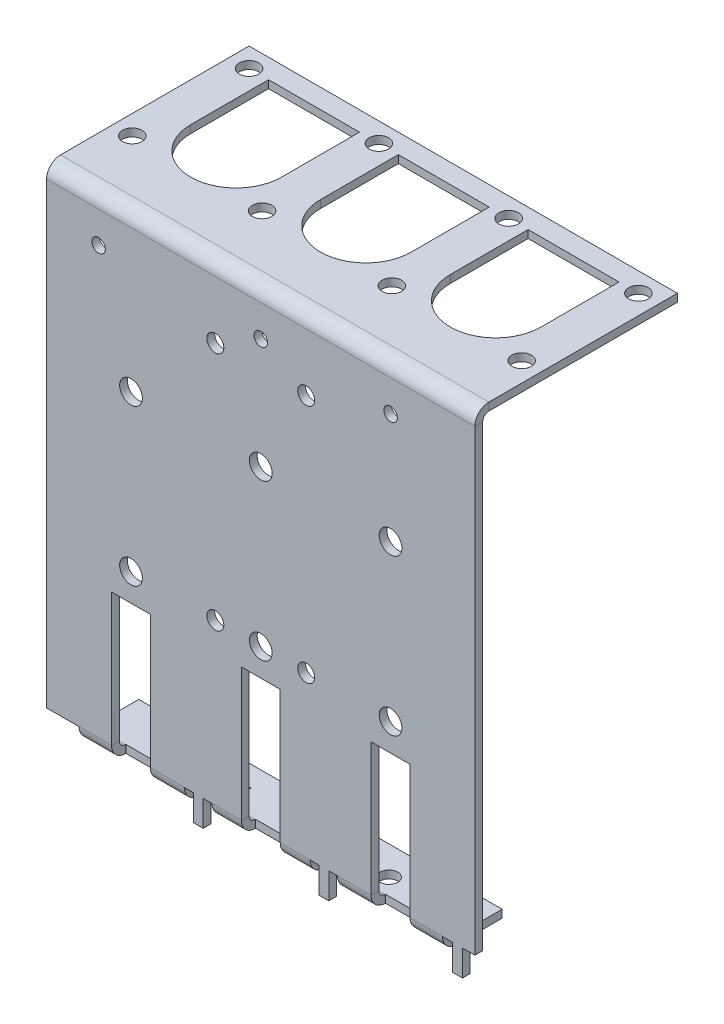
ISO-10303-21;
HEADER;
FILE_DESCRIPTION(('STEP AP214'),'2;1');
FILE_NAME('part.step','',(''),(''),'','','');
FILE_SCHEMA(('AUTOMOTIVE_DESIGN { 1 0 10303 214 1 1 1 1 }'));
ENDSEC;
DATA;
#1=APPLICATION_CONTEXT('core data for automotive mechanical design processes');
#2=APPLICATION_PROTOCOL_DEFINITION('international standard','automotive_design',2000,#1);
#3=PRODUCT_CONTEXT('',#1,'mechanical');
#4=PRODUCT('Part','Part','',(#3));
#5=PRODUCT_RELATED_PRODUCT_CATEGORY('part','',(#4));
#6=PRODUCT_DEFINITION_FORMATION('','',#4);
#7=PRODUCT_DEFINITION_CONTEXT('part definition',#1,'design');
#8=PRODUCT_DEFINITION('design','',#6,#7);
#9=PRODUCT_DEFINITION_SHAPE('','',#8);
#10=(LENGTH_UNIT() NAMED_UNIT(*) SI_UNIT(.MILLI.,.METRE.));
#11=(NAMED_UNIT(*) PLANE_ANGLE_UNIT() SI_UNIT($,.RADIAN.));
#12=(NAMED_UNIT(*) SI_UNIT($,.STERADIAN.) SOLID_ANGLE_UNIT());
#13=UNCERTAINTY_MEASURE_WITH_UNIT(LENGTH_MEASURE(1.E-05),#10,'distance_accuracy_value','');
#14=(GEOMETRIC_REPRESENTATION_CONTEXT(3) GLOBAL_UNCERTAINTY_ASSIGNED_CONTEXT((#13)) GLOBAL_UNIT_ASSIGNED_CONTEXT((#10,
#11,#12)) REPRESENTATION_CONTEXT('',''));
#15=CARTESIAN_POINT('',(0.,0.,0.));
#16=DIRECTION('',(0.,0.,1.));
#17=DIRECTION('',(1.,0.,0.));
#18=AXIS2_PLACEMENT_3D('',#15,#16,#17);
#19=CARTESIAN_POINT('',(52.3875,-113.56975,-47.625));
#20=DIRECTION('',(0.,1.,0.));
#21=DIRECTION('',(0.,0.,1.));
#22=AXIS2_PLACEMENT_3D('',#19,#20,#21);
#23=PLANE('',#22);
#24=DIRECTION('',(-1.,0.,0.));
#25=VECTOR('',#24,1.);
#26=CARTESIAN_POINT('',(52.3875,-113.56975,1.90499999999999));
#27=LINE('',#26,#25);
#28=CARTESIAN_POINT('',(52.3875,-113.56975,1.90499999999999));
#29=VERTEX_POINT('',#28);
#30=CARTESIAN_POINT('',(49.3395,-113.56975,1.90499999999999));
#31=VERTEX_POINT('',#30);
#32=EDGE_CURVE('E1000',#29,#31,#27,.T.);
#33=ORIENTED_EDGE('',*,*,#32,.T.);
#34=DIRECTION('',(0.,0.,1.));
#35=VECTOR('',#34,1.);
#36=CARTESIAN_POINT('',(49.3395,-113.56975,0.));
#37=LINE('',#36,#35);
#38=CARTESIAN_POINT('',(49.3395,-113.56975,0.));
#39=VERTEX_POINT('',#38);
#40=EDGE_CURVE('E631',#39,#31,#37,.T.);
#41=ORIENTED_EDGE('',*,*,#40,.F.);
#42=DIRECTION('',(-1.,0.,0.));
#43=VECTOR('',#42,1.);
#44=CARTESIAN_POINT('',(52.3875,-113.56975,0.));
#45=LINE('',#44,#43);
#46=CARTESIAN_POINT('',(52.3875,-113.56975,0.));
#47=VERTEX_POINT('',#46);
#48=EDGE_CURVE('E1021',#47,#39,#45,.T.);
#49=ORIENTED_EDGE('',*,*,#48,.F.);
#50=DIRECTION('',(0.,0.,-1.));
#51=VECTOR('',#50,1.);
#52=CARTESIAN_POINT('',(52.3875,-113.56975,1.90499999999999));
#53=LINE('',#52,#51);
#54=EDGE_CURVE('E1039',#29,#47,#53,.T.);
#55=ORIENTED_EDGE('',*,*,#54,.F.);
#56=EDGE_LOOP('',(#33,#41,#49,#55));
#57=FACE_BOUND('',#56,.T.);
#58=ADVANCED_FACE('F44',(#57),#23,.F.);
#59=CARTESIAN_POINT('',(12.0777,-113.56975,-7.62));
#60=DIRECTION('',(0.,1.,0.));
#61=DIRECTION('',(0.,0.,1.));
#62=AXIS2_PLACEMENT_3D('',#59,#60,#61);
#63=PLANE('',#62);
#64=DIRECTION('',(-1.,0.,0.));
#65=VECTOR('',#64,1.);
#66=CARTESIAN_POINT('',(12.0777,-113.56975,1.905));
#67=LINE('',#66,#65);
#68=CARTESIAN_POINT('',(18.8087,-113.56975,1.90499999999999));
#69=VERTEX_POINT('',#68);
#70=CARTESIAN_POINT('',(16.6497,-113.56975,1.905));
#71=VERTEX_POINT('',#70);
#72=EDGE_CURVE('E709',#69,#71,#67,.T.);
#73=ORIENTED_EDGE('',*,*,#72,.T.);
#74=DIRECTION('',(0.,0.,1.));
#75=VECTOR('',#74,1.);
#76=CARTESIAN_POINT('',(16.6497,-113.56975,0.));
#77=LINE('',#76,#75);
#78=CARTESIAN_POINT('',(16.6497,-113.56975,0.));
#79=VERTEX_POINT('',#78);
#80=EDGE_CURVE('E659',#79,#71,#77,.T.);
#81=ORIENTED_EDGE('',*,*,#80,.F.);
#82=DIRECTION('',(1.,0.,0.));
#83=VECTOR('',#82,1.);
#84=CARTESIAN_POINT('',(52.3875,-113.56975,0.));
#85=LINE('',#84,#83);
#86=CARTESIAN_POINT('',(18.8087,-113.56975,0.));
#87=VERTEX_POINT('',#86);
#88=EDGE_CURVE('E717',#79,#87,#85,.T.);
#89=ORIENTED_EDGE('',*,*,#88,.T.);
#90=DIRECTION('',(0.,0.,1.));
#91=VECTOR('',#90,1.);
#92=CARTESIAN_POINT('',(18.8087,-113.56975,-7.62));
#93=LINE('',#92,#91);
#94=EDGE_CURVE('E712',#87,#69,#93,.T.);
#95=ORIENTED_EDGE('',*,*,#94,.T.);
#96=EDGE_LOOP('',(#73,#81,#89,#95));
#97=FACE_BOUND('',#96,.T.);
#98=ADVANCED_FACE('F1313',(#97),#63,.F.);
#99=CARTESIAN_POINT('',(-18.6563,-113.56975,-7.62));
#100=DIRECTION('',(0.,1.,0.));
#101=DIRECTION('',(0.,0.,1.));
#102=AXIS2_PLACEMENT_3D('',#99,#100,#101);
#103=PLANE('',#102);
#104=DIRECTION('',(-1.,0.,0.));
#105=VECTOR('',#104,1.);
#106=CARTESIAN_POINT('',(-18.6563,-113.56975,1.905));
#107=LINE('',#106,#105);
#108=CARTESIAN_POINT('',(-11.9253,-113.56975,1.90499999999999));
#109=VERTEX_POINT('',#108);
#110=CARTESIAN_POINT('',(-14.0843,-113.56975,1.905));
#111=VERTEX_POINT('',#110);
#112=EDGE_CURVE('E745',#109,#111,#107,.T.);
#113=ORIENTED_EDGE('',*,*,#112,.T.);
#114=DIRECTION('',(0.,0.,1.));
#115=VECTOR('',#114,1.);
#116=CARTESIAN_POINT('',(-14.0843,-113.56975,0.));
#117=LINE('',#116,#115);
#118=CARTESIAN_POINT('',(-14.0843,-113.56975,0.));
#119=VERTEX_POINT('',#118);
#120=EDGE_CURVE('E687',#119,#111,#117,.T.);
#121=ORIENTED_EDGE('',*,*,#120,.F.);
#122=DIRECTION('',(1.,0.,0.));
#123=VECTOR('',#122,1.);
#124=CARTESIAN_POINT('',(52.3875,-113.56975,0.));
#125=LINE('',#124,#123);
#126=CARTESIAN_POINT('',(-11.9253,-113.56975,0.));
#127=VERTEX_POINT('',#126);
#128=EDGE_CURVE('E753',#119,#127,#125,.T.);
#129=ORIENTED_EDGE('',*,*,#128,.T.);
#130=DIRECTION('',(0.,0.,1.));
#131=VECTOR('',#130,1.);
#132=CARTESIAN_POINT('',(-11.9253,-113.56975,-7.62));
#133=LINE('',#132,#131);
#134=EDGE_CURVE('E748',#127,#109,#133,.T.);
#135=ORIENTED_EDGE('',*,*,#134,.T.);
#136=EDGE_LOOP('',(#113,#121,#129,#135));
#137=FACE_BOUND('',#136,.T.);
#138=ADVANCED_FACE('F1211',(#137),#103,.F.);
#139=CARTESIAN_POINT('',(12.0777,-113.56975,-7.62));
#140=DIRECTION('',(-1.,0.,0.));
#141=DIRECTION('',(0.,-1.,0.));
#142=AXIS2_PLACEMENT_3D('',#139,#140,#141);
#143=PLANE('',#142);
#144=DIRECTION('',(0.,0.,1.));
#145=VECTOR('',#144,1.);
#146=CARTESIAN_POINT('',(12.0777,-115.09375,0.));
#147=LINE('',#146,#145);
#148=CARTESIAN_POINT('',(12.0777,-115.09375,-7.62));
#149=VERTEX_POINT('',#148);
#150=CARTESIAN_POINT('',(12.0777,-115.09375,-1.52400000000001));
#151=VERTEX_POINT('',#150);
#152=EDGE_CURVE('E52',#149,#151,#147,.T.);
#153=ORIENTED_EDGE('',*,*,#152,.T.);
#154=DIRECTION('',(0.,-1.,0.));
#155=VECTOR('',#154,1.);
#156=CARTESIAN_POINT('',(12.0777,-115.09375,-1.52400000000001));
#157=LINE('',#156,#155);
#158=CARTESIAN_POINT('',(12.0777,-116.99875,-1.52400000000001));
#159=VERTEX_POINT('',#158);
#160=EDGE_CURVE('E12',#151,#159,#157,.T.);
#161=ORIENTED_EDGE('',*,*,#160,.T.);
#162=DIRECTION('',(0.,0.,1.));
#163=VECTOR('',#162,1.);
#164=CARTESIAN_POINT('',(12.0777,-116.99875,0.));
#165=LINE('',#164,#163);
#166=CARTESIAN_POINT('',(12.0777,-116.99875,-7.62));
#167=VERTEX_POINT('',#166);
#168=EDGE_CURVE('E734',#167,#159,#165,.T.);
#169=ORIENTED_EDGE('',*,*,#168,.F.);
#170=DIRECTION('',(0.,-1.,0.));
#171=VECTOR('',#170,1.);
#172=CARTESIAN_POINT('',(12.0777,-113.56975,-7.62));
#173=LINE('',#172,#171);
#174=EDGE_CURVE('E705',#149,#167,#173,.T.);
#175=ORIENTED_EDGE('',*,*,#174,.F.);
#176=EDGE_LOOP('',(#153,#161,#169,#175));
#177=FACE_BOUND('',#176,.T.);
#178=ADVANCED_FACE('F1128',(#177),#143,.F.);
#179=CARTESIAN_POINT('',(52.3875,-113.56975,-1.52400000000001));
#180=DIRECTION('',(-1.,0.,0.));
#181=DIRECTION('',(0.,0.,1.));
#182=AXIS2_PLACEMENT_3D('',#179,#180,#181);
#183=CYLINDRICAL_SURFACE('',#182,1.524);
#184=CARTESIAN_POINT('',(12.0777,-113.56975,-1.52400000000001));
#185=DIRECTION('',(-1.,0.,0.));
#186=DIRECTION('',(0.,-1.,0.));
#187=AXIS2_PLACEMENT_3D('',#184,#185,#186);
#188=CIRCLE('',#187,1.524);
#189=CARTESIAN_POINT('',(12.0777,-113.56975,0.));
#190=VERTEX_POINT('',#189);
#191=EDGE_CURVE('E731',#151,#190,#188,.T.);
#192=ORIENTED_EDGE('',*,*,#191,.F.);
#193=DIRECTION('',(-1.,0.,0.));
#194=VECTOR('',#193,1.);
#195=CARTESIAN_POINT('',(52.3875,-115.09375,-1.52400000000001));
#196=LINE('',#195,#194);
#197=CARTESIAN_POINT('',(4.76250000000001,-115.09375,-1.52400000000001));
#198=VERTEX_POINT('',#197);
#199=EDGE_CURVE('E1031',#151,#198,#196,.T.);
#200=ORIENTED_EDGE('',*,*,#199,.T.);
#201=CARTESIAN_POINT('',(4.76250000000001,-113.56975,-1.52400000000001));
#202=DIRECTION('',(1.,0.,0.));
#203=DIRECTION('',(0.,0.,-1.));
#204=AXIS2_PLACEMENT_3D('',#201,#202,#203);
#205=CIRCLE('',#204,1.524);
#206=CARTESIAN_POINT('',(4.76250000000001,-113.56975,0.));
#207=VERTEX_POINT('',#206);
#208=EDGE_CURVE('E941',#207,#198,#205,.T.);
#209=ORIENTED_EDGE('',*,*,#208,.F.);
#210=EDGE_CURVE('E1136',#190,#207,#45,.T.);
#211=ORIENTED_EDGE('',*,*,#210,.F.);
#212=EDGE_LOOP('',(#192,#200,#209,#211));
#213=FACE_BOUND('',#212,.T.);
#214=ADVANCED_FACE('F1134',(#213),#183,.F.);
#215=CARTESIAN_POINT('',(52.3875,-113.56975,-1.52400000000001));
#216=DIRECTION('',(-1.,0.,0.));
#217=DIRECTION('',(0.,0.,1.));
#218=AXIS2_PLACEMENT_3D('',#215,#216,#217);
#219=CYLINDRICAL_SURFACE('',#218,3.429);
#220=DIRECTION('',(-1.,0.,0.));
#221=VECTOR('',#220,1.);
#222=CARTESIAN_POINT('',(52.3875,-116.99875,-1.52400000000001));
#223=LINE('',#222,#221);
#224=CARTESIAN_POINT('',(4.76250000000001,-116.99875,-1.52400000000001));
#225=VERTEX_POINT('',#224);
#226=EDGE_CURVE('E998',#159,#225,#223,.T.);
#227=ORIENTED_EDGE('',*,*,#226,.F.);
#228=CARTESIAN_POINT('',(12.0777,-113.56975,-1.52400000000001));
#229=DIRECTION('',(-1.,0.,0.));
#230=DIRECTION('',(0.,-1.,0.));
#231=AXIS2_PLACEMENT_3D('',#228,#229,#230);
#232=CIRCLE('',#231,3.429);
#233=CARTESIAN_POINT('',(12.0777,-113.56975,1.905));
#234=VERTEX_POINT('',#233);
#235=EDGE_CURVE('E737',#159,#234,#232,.T.);
#236=ORIENTED_EDGE('',*,*,#235,.T.);
#237=CARTESIAN_POINT('',(4.76250000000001,-113.56975,1.905));
#238=VERTEX_POINT('',#237);
#239=EDGE_CURVE('E1188',#234,#238,#27,.T.);
#240=ORIENTED_EDGE('',*,*,#239,.T.);
#241=CARTESIAN_POINT('',(4.76250000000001,-113.56975,-1.52400000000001));
#242=DIRECTION('',(1.,0.,0.));
#243=DIRECTION('',(0.,0.,-1.));
#244=AXIS2_PLACEMENT_3D('',#241,#242,#243);
#245=CIRCLE('',#244,3.429);
#246=EDGE_CURVE('E1053',#238,#225,#245,.T.);
#247=ORIENTED_EDGE('',*,*,#246,.T.);
#248=EDGE_LOOP('',(#227,#236,#240,#247));
#249=FACE_BOUND('',#248,.T.);
#250=ADVANCED_FACE('F1330',(#249),#219,.T.);
#251=CARTESIAN_POINT('',(-18.6563,-113.56975,-7.62));
#252=DIRECTION('',(-1.,0.,0.));
#253=DIRECTION('',(0.,-1.,0.));
#254=AXIS2_PLACEMENT_3D('',#251,#252,#253);
#255=PLANE('',#254);
#256=DIRECTION('',(0.,0.,1.));
#257=VECTOR('',#256,1.);
#258=CARTESIAN_POINT('',(-18.6563,-115.09375,0.));
#259=LINE('',#258,#257);
#260=CARTESIAN_POINT('',(-18.6563,-115.09375,-7.62));
#261=VERTEX_POINT('',#260);
#262=CARTESIAN_POINT('',(-18.6563,-115.09375,-1.52400000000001));
#263=VERTEX_POINT('',#262);
#264=EDGE_CURVE('E1114',#261,#263,#259,.T.);
#265=ORIENTED_EDGE('',*,*,#264,.T.);
#266=DIRECTION('',(0.,-1.,0.));
#267=VECTOR('',#266,1.);
#268=CARTESIAN_POINT('',(-18.6563,-115.09375,-1.52400000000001));
#269=LINE('',#268,#267);
#270=CARTESIAN_POINT('',(-18.6563,-116.99875,-1.52400000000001));
#271=VERTEX_POINT('',#270);
#272=EDGE_CURVE('E1117',#263,#271,#269,.T.);
#273=ORIENTED_EDGE('',*,*,#272,.T.);
#274=DIRECTION('',(0.,0.,1.));
#275=VECTOR('',#274,1.);
#276=CARTESIAN_POINT('',(-18.6563,-116.99875,0.));
#277=LINE('',#276,#275);
#278=CARTESIAN_POINT('',(-18.6563,-116.99875,-7.62));
#279=VERTEX_POINT('',#278);
#280=EDGE_CURVE('E770',#279,#271,#277,.T.);
#281=ORIENTED_EDGE('',*,*,#280,.F.);
#282=DIRECTION('',(0.,-1.,0.));
#283=VECTOR('',#282,1.);
#284=CARTESIAN_POINT('',(-18.6563,-113.56975,-7.62));
#285=LINE('',#284,#283);
#286=EDGE_CURVE('E741',#261,#279,#285,.T.);
#287=ORIENTED_EDGE('',*,*,#286,.F.);
#288=EDGE_LOOP('',(#265,#273,#281,#287));
#289=FACE_BOUND('',#288,.T.);
#290=ADVANCED_FACE('F1379',(#289),#255,.F.);
#291=CARTESIAN_POINT('',(-18.6563,-113.56975,-1.52400000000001));
#292=DIRECTION('',(-1.,0.,0.));
#293=DIRECTION('',(0.,-1.,0.));
#294=AXIS2_PLACEMENT_3D('',#291,#292,#293);
#295=CIRCLE('',#294,1.524);
#296=CARTESIAN_POINT('',(-18.6563,-113.56975,0.));
#297=VERTEX_POINT('',#296);
#298=EDGE_CURVE('E767',#263,#297,#295,.T.);
#299=ORIENTED_EDGE('',*,*,#298,.F.);
#300=CARTESIAN_POINT('',(-26.9875,-115.09375,-1.52400000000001));
#301=VERTEX_POINT('',#300);
#302=EDGE_CURVE('E1142',#263,#301,#196,.T.);
#303=ORIENTED_EDGE('',*,*,#302,.T.);
#304=CARTESIAN_POINT('',(-26.9875,-113.56975,-1.52400000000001));
#305=DIRECTION('',(1.,0.,0.));
#306=DIRECTION('',(0.,0.,-1.));
#307=AXIS2_PLACEMENT_3D('',#304,#305,#306);
#308=CIRCLE('',#307,1.524);
#309=CARTESIAN_POINT('',(-26.9875,-113.56975,0.));
#310=VERTEX_POINT('',#309);
#311=EDGE_CURVE('E844',#310,#301,#308,.T.);
#312=ORIENTED_EDGE('',*,*,#311,.F.);
#313=EDGE_CURVE('E1232',#297,#310,#45,.T.);
#314=ORIENTED_EDGE('',*,*,#313,.F.);
#315=EDGE_LOOP('',(#299,#303,#312,#314));
#316=FACE_BOUND('',#315,.T.);
#317=ADVANCED_FACE('F1239',(#316),#183,.F.);
#318=CARTESIAN_POINT('',(-26.9875,-116.99875,-1.52400000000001));
#319=VERTEX_POINT('',#318);
#320=EDGE_CURVE('E1343',#271,#319,#223,.T.);
#321=ORIENTED_EDGE('',*,*,#320,.F.);
#322=CARTESIAN_POINT('',(-18.6563,-113.56975,-1.52400000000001));
#323=DIRECTION('',(-1.,0.,0.));
#324=DIRECTION('',(0.,-1.,0.));
#325=AXIS2_PLACEMENT_3D('',#322,#323,#324);
#326=CIRCLE('',#325,3.429);
#327=CARTESIAN_POINT('',(-18.6563,-113.56975,1.905));
#328=VERTEX_POINT('',#327);
#329=EDGE_CURVE('E773',#271,#328,#326,.T.);
#330=ORIENTED_EDGE('',*,*,#329,.T.);
#331=CARTESIAN_POINT('',(-26.9875,-113.56975,1.905));
#332=VERTEX_POINT('',#331);
#333=EDGE_CURVE('E1185',#328,#332,#27,.T.);
#334=ORIENTED_EDGE('',*,*,#333,.T.);
#335=CARTESIAN_POINT('',(-26.9875,-113.56975,-1.52400000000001));
#336=DIRECTION('',(1.,0.,0.));
#337=DIRECTION('',(0.,0.,-1.));
#338=AXIS2_PLACEMENT_3D('',#335,#336,#337);
#339=CIRCLE('',#338,3.429);
#340=EDGE_CURVE('E1076',#332,#319,#339,.T.);
#341=ORIENTED_EDGE('',*,*,#340,.T.);
#342=EDGE_LOOP('',(#321,#330,#334,#341));
#343=FACE_BOUND('',#342,.T.);
#344=ADVANCED_FACE('F1357',(#343),#219,.T.);
#345=CARTESIAN_POINT('',(44.45,-113.56975,-47.625));
#346=DIRECTION('',(-1.,0.,0.));
#347=DIRECTION('',(0.,0.,1.));
#348=AXIS2_PLACEMENT_3D('',#345,#346,#347);
#349=PLANE('',#348);
#350=DIRECTION('',(0.,0.,1.));
#351=VECTOR('',#350,1.);
#352=CARTESIAN_POINT('',(44.45,-115.09375,0.));
#353=LINE('',#352,#351);
#354=CARTESIAN_POINT('',(44.45,-115.09375,-12.7));
#355=VERTEX_POINT('',#354);
#356=CARTESIAN_POINT('',(44.45,-115.09375,-1.52400000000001));
#357=VERTEX_POINT('',#356);
#358=EDGE_CURVE('E1104',#355,#357,#353,.T.);
#359=ORIENTED_EDGE('',*,*,#358,.T.);
#360=DIRECTION('',(0.,-1.,0.));
#361=VECTOR('',#360,1.);
#362=CARTESIAN_POINT('',(44.45,-115.09375,-1.52400000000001));
#363=LINE('',#362,#361);
#364=CARTESIAN_POINT('',(44.45,-116.99875,-1.52400000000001));
#365=VERTEX_POINT('',#364);
#366=EDGE_CURVE('E1107',#357,#365,#363,.T.);
#367=ORIENTED_EDGE('',*,*,#366,.T.);
#368=DIRECTION('',(0.,0.,1.));
#369=VECTOR('',#368,1.);
#370=CARTESIAN_POINT('',(44.45,-116.99875,0.));
#371=LINE('',#370,#369);
#372=CARTESIAN_POINT('',(44.45,-116.99875,-12.7));
#373=VERTEX_POINT('',#372);
#374=EDGE_CURVE('E781',#373,#365,#371,.T.);
#375=ORIENTED_EDGE('',*,*,#374,.F.);
#376=DIRECTION('',(0.,1.,0.));
#377=VECTOR('',#376,1.);
#378=CARTESIAN_POINT('',(44.45,-115.09375,-12.7));
#379=LINE('',#378,#377);
#380=EDGE_CURVE('E779',#373,#355,#379,.T.);
#381=ORIENTED_EDGE('',*,*,#380,.T.);
#382=EDGE_LOOP('',(#359,#367,#375,#381));
#383=FACE_BOUND('',#382,.T.);
#384=ADVANCED_FACE('F1425',(#383),#349,.F.);
#385=CARTESIAN_POINT('',(-36.5125,-131.400616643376,-1.5875));
#386=DIRECTION('',(-1.,0.,0.));
#387=DIRECTION('',(0.,0.,1.));
#388=AXIS2_PLACEMENT_3D('',#385,#386,#387);
#389=PLANE('',#388);
#390=DIRECTION('',(0.,-1.,0.));
#391=VECTOR('',#390,1.);
#392=CARTESIAN_POINT('',(-36.5125,-131.400616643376,1.905));
#393=LINE('',#392,#391);
#394=CARTESIAN_POINT('',(-36.5125,-81.05775,1.905));
#395=VERTEX_POINT('',#394);
#396=CARTESIAN_POINT('',(-36.5125,-113.56975,1.90499999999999));
#397=VERTEX_POINT('',#396);
#398=EDGE_CURVE('E812',#395,#397,#393,.T.);
#399=ORIENTED_EDGE('',*,*,#398,.T.);
#400=DIRECTION('',(0.,0.,-1.));
#401=VECTOR('',#400,1.);
#402=CARTESIAN_POINT('',(-36.5125,-113.56975,1.90499999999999));
#403=LINE('',#402,#401);
#404=CARTESIAN_POINT('',(-36.5125,-113.56975,0.));
#405=VERTEX_POINT('',#404);
#406=EDGE_CURVE('E1099',#397,#405,#403,.T.);
#407=ORIENTED_EDGE('',*,*,#406,.T.);
#408=DIRECTION('',(0.,1.,0.));
#409=VECTOR('',#408,1.);
#410=CARTESIAN_POINT('',(-36.5125,0.,0.));
#411=LINE('',#410,#409);
#412=CARTESIAN_POINT('',(-36.5125,-81.05775,0.));
#413=VERTEX_POINT('',#412);
#414=EDGE_CURVE('E829',#405,#413,#411,.T.);
#415=ORIENTED_EDGE('',*,*,#414,.T.);
#416=DIRECTION('',(0.,0.,1.));
#417=VECTOR('',#416,1.);
#418=CARTESIAN_POINT('',(-36.5125,-81.05775,-1.5875));
#419=LINE('',#418,#417);
#420=EDGE_CURVE('E823',#413,#395,#419,.T.);
#421=ORIENTED_EDGE('',*,*,#420,.T.);
#422=EDGE_LOOP('',(#399,#407,#415,#421));
#423=FACE_BOUND('',#422,.T.);
#424=ADVANCED_FACE('F1367',(#423),#389,.F.);
#425=DIRECTION('',(0.,0.,1.));
#426=VECTOR('',#425,1.);
#427=CARTESIAN_POINT('',(-36.5125,-115.09375,0.));
#428=LINE('',#427,#426);
#429=CARTESIAN_POINT('',(-36.5125,-115.09375,-1.5875));
#430=VERTEX_POINT('',#429);
#431=CARTESIAN_POINT('',(-36.5125,-115.09375,-1.52400000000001));
#432=VERTEX_POINT('',#431);
#433=EDGE_CURVE('E835',#430,#432,#428,.T.);
#434=ORIENTED_EDGE('',*,*,#433,.T.);
#435=DIRECTION('',(0.,-1.,0.));
#436=VECTOR('',#435,1.);
#437=CARTESIAN_POINT('',(-36.5125,-115.09375,-1.52400000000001));
#438=LINE('',#437,#436);
#439=CARTESIAN_POINT('',(-36.5125,-116.99875,-1.52400000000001));
#440=VERTEX_POINT('',#439);
#441=EDGE_CURVE('E1097',#432,#440,#438,.T.);
#442=ORIENTED_EDGE('',*,*,#441,.T.);
#443=DIRECTION('',(0.,0.,1.));
#444=VECTOR('',#443,1.);
#445=CARTESIAN_POINT('',(-36.5125,-116.99875,0.));
#446=LINE('',#445,#444);
#447=CARTESIAN_POINT('',(-36.5125,-116.99875,-1.5875));
#448=VERTEX_POINT('',#447);
#449=EDGE_CURVE('E825',#448,#440,#446,.T.);
#450=ORIENTED_EDGE('',*,*,#449,.F.);
#451=DIRECTION('',(0.,-1.,0.));
#452=VECTOR('',#451,1.);
#453=CARTESIAN_POINT('',(-36.5125,-131.400616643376,-1.5875));
#454=LINE('',#453,#452);
#455=EDGE_CURVE('E811',#430,#448,#454,.T.);
#456=ORIENTED_EDGE('',*,*,#455,.F.);
#457=EDGE_LOOP('',(#434,#442,#450,#456));
#458=FACE_BOUND('',#457,.T.);
#459=ADVANCED_FACE('F1372',(#458),#389,.F.);
#460=CARTESIAN_POINT('',(-26.9875,-131.400616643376,-1.5875));
#461=DIRECTION('',(1.,0.,0.));
#462=DIRECTION('',(0.,0.,-1.));
#463=AXIS2_PLACEMENT_3D('',#460,#461,#462);
#464=PLANE('',#463);
#465=DIRECTION('',(0.,-1.,0.));
#466=VECTOR('',#465,1.);
#467=CARTESIAN_POINT('',(-26.9875,0.,0.));
#468=LINE('',#467,#466);
#469=CARTESIAN_POINT('',(-26.9875,-81.05775,0.));
#470=VERTEX_POINT('',#469);
#471=EDGE_CURVE('E841',#470,#310,#468,.T.);
#472=ORIENTED_EDGE('',*,*,#471,.T.);
#473=DIRECTION('',(0.,0.,1.));
#474=VECTOR('',#473,1.);
#475=CARTESIAN_POINT('',(-26.9875,-113.56975,0.));
#476=LINE('',#475,#474);
#477=EDGE_CURVE('E1094',#310,#332,#476,.T.);
#478=ORIENTED_EDGE('',*,*,#477,.T.);
#479=DIRECTION('',(0.,1.,0.));
#480=VECTOR('',#479,1.);
#481=CARTESIAN_POINT('',(-26.9875,-131.400616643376,1.905));
#482=LINE('',#481,#480);
#483=CARTESIAN_POINT('',(-26.9875,-81.05775,1.905));
#484=VERTEX_POINT('',#483);
#485=EDGE_CURVE('E807',#332,#484,#482,.T.);
#486=ORIENTED_EDGE('',*,*,#485,.T.);
#487=DIRECTION('',(0.,0.,1.));
#488=VECTOR('',#487,1.);
#489=CARTESIAN_POINT('',(-26.9875,-81.05775,-1.5875));
#490=LINE('',#489,#488);
#491=EDGE_CURVE('E815',#470,#484,#490,.T.);
#492=ORIENTED_EDGE('',*,*,#491,.F.);
#493=EDGE_LOOP('',(#472,#478,#486,#492));
#494=FACE_BOUND('',#493,.T.);
#495=ADVANCED_FACE('F1360',(#494),#464,.F.);
#496=DIRECTION('',(0.,0.,-1.));
#497=VECTOR('',#496,1.);
#498=CARTESIAN_POINT('',(-26.9875,-116.99875,0.));
#499=LINE('',#498,#497);
#500=CARTESIAN_POINT('',(-26.9875,-116.99875,-1.5875));
#501=VERTEX_POINT('',#500);
#502=EDGE_CURVE('E838',#319,#501,#499,.T.);
#503=ORIENTED_EDGE('',*,*,#502,.F.);
#504=DIRECTION('',(0.,1.,0.));
#505=VECTOR('',#504,1.);
#506=CARTESIAN_POINT('',(-26.9875,-116.99875,-1.52400000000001));
#507=LINE('',#506,#505);
#508=EDGE_CURVE('E1091',#319,#301,#507,.T.);
#509=ORIENTED_EDGE('',*,*,#508,.T.);
#510=DIRECTION('',(0.,0.,-1.));
#511=VECTOR('',#510,1.);
#512=CARTESIAN_POINT('',(-26.9875,-115.09375,0.));
#513=LINE('',#512,#511);
#514=CARTESIAN_POINT('',(-26.9875,-115.09375,-1.5875));
#515=VERTEX_POINT('',#514);
#516=EDGE_CURVE('E847',#301,#515,#513,.T.);
#517=ORIENTED_EDGE('',*,*,#516,.T.);
#518=DIRECTION('',(0.,1.,0.));
#519=VECTOR('',#518,1.);
#520=CARTESIAN_POINT('',(-26.9875,-131.400616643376,-1.5875));
#521=LINE('',#520,#519);
#522=EDGE_CURVE('E808',#501,#515,#521,.T.);
#523=ORIENTED_EDGE('',*,*,#522,.F.);
#524=EDGE_LOOP('',(#503,#509,#517,#523));
#525=FACE_BOUND('',#524,.T.);
#526=ADVANCED_FACE('F1356',(#525),#464,.F.);
#527=CARTESIAN_POINT('',(26.9875,-131.400616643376,-1.58750000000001));
#528=DIRECTION('',(-1.,0.,0.));
#529=DIRECTION('',(0.,0.,1.));
#530=AXIS2_PLACEMENT_3D('',#527,#528,#529);
#531=PLANE('',#530);
#532=DIRECTION('',(0.,-1.,0.));
#533=VECTOR('',#532,1.);
#534=CARTESIAN_POINT('',(26.9875,-131.400616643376,1.90499999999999));
#535=LINE('',#534,#533);
#536=CARTESIAN_POINT('',(26.9875,-81.0577499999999,1.90499999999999));
#537=VERTEX_POINT('',#536);
#538=CARTESIAN_POINT('',(26.9875,-113.56975,1.90499999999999));
#539=VERTEX_POINT('',#538);
#540=EDGE_CURVE('E859',#537,#539,#535,.T.);
#541=ORIENTED_EDGE('',*,*,#540,.T.);
#542=DIRECTION('',(0.,0.,-1.));
#543=VECTOR('',#542,1.);
#544=CARTESIAN_POINT('',(26.9875,-113.56975,1.90499999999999));
#545=LINE('',#544,#543);
#546=CARTESIAN_POINT('',(26.9875,-113.56975,0.));
#547=VERTEX_POINT('',#546);
#548=EDGE_CURVE('E1089',#539,#547,#545,.T.);
#549=ORIENTED_EDGE('',*,*,#548,.T.);
#550=DIRECTION('',(0.,1.,0.));
#551=VECTOR('',#550,1.);
#552=CARTESIAN_POINT('',(26.9875,0.,0.));
#553=LINE('',#552,#551);
#554=CARTESIAN_POINT('',(26.9875,-81.0577499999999,0.));
#555=VERTEX_POINT('',#554);
#556=EDGE_CURVE('E872',#547,#555,#553,.T.);
#557=ORIENTED_EDGE('',*,*,#556,.T.);
#558=DIRECTION('',(0.,0.,1.));
#559=VECTOR('',#558,1.);
#560=CARTESIAN_POINT('',(26.9875,-81.0577499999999,-1.58750000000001));
#561=LINE('',#560,#559);
#562=EDGE_CURVE('E867',#555,#537,#561,.T.);
#563=ORIENTED_EDGE('',*,*,#562,.T.);
#564=EDGE_LOOP('',(#541,#549,#557,#563));
#565=FACE_BOUND('',#564,.T.);
#566=ADVANCED_FACE('F1289',(#565),#531,.F.);
#567=DIRECTION('',(0.,0.,1.));
#568=VECTOR('',#567,1.);
#569=CARTESIAN_POINT('',(26.9875,-115.09375,0.));
#570=LINE('',#569,#568);
#571=CARTESIAN_POINT('',(26.9875,-115.09375,-1.58750000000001));
#572=VERTEX_POINT('',#571);
#573=CARTESIAN_POINT('',(26.9875,-115.09375,-1.52400000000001));
#574=VERTEX_POINT('',#573);
#575=EDGE_CURVE('E878',#572,#574,#570,.T.);
#576=ORIENTED_EDGE('',*,*,#575,.T.);
#577=DIRECTION('',(0.,-1.,0.));
#578=VECTOR('',#577,1.);
#579=CARTESIAN_POINT('',(26.9875,-115.09375,-1.52400000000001));
#580=LINE('',#579,#578);
#581=CARTESIAN_POINT('',(26.9875,-116.99875,-1.52400000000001));
#582=VERTEX_POINT('',#581);
#583=EDGE_CURVE('E1087',#574,#582,#580,.T.);
#584=ORIENTED_EDGE('',*,*,#583,.T.);
#585=DIRECTION('',(0.,0.,1.));
#586=VECTOR('',#585,1.);
#587=CARTESIAN_POINT('',(26.9875,-116.99875,0.));
#588=LINE('',#587,#586);
#589=CARTESIAN_POINT('',(26.9875,-116.99875,-1.58750000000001));
#590=VERTEX_POINT('',#589);
#591=EDGE_CURVE('E881',#590,#582,#588,.T.);
#592=ORIENTED_EDGE('',*,*,#591,.F.);
#593=DIRECTION('',(0.,-1.,0.));
#594=VECTOR('',#593,1.);
#595=CARTESIAN_POINT('',(26.9875,-131.400616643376,-1.58750000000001));
#596=LINE('',#595,#594);
#597=EDGE_CURVE('E858',#572,#590,#596,.T.);
#598=ORIENTED_EDGE('',*,*,#597,.F.);
#599=EDGE_LOOP('',(#576,#584,#592,#598));
#600=FACE_BOUND('',#599,.T.);
#601=ADVANCED_FACE('F1485',(#600),#531,.F.);
#602=CARTESIAN_POINT('',(36.5125,-131.400616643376,-1.58750000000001));
#603=DIRECTION('',(1.,0.,0.));
#604=DIRECTION('',(0.,0.,-1.));
#605=AXIS2_PLACEMENT_3D('',#602,#603,#604);
#606=PLANE('',#605);
#607=DIRECTION('',(0.,0.,-1.));
#608=VECTOR('',#607,1.);
#609=CARTESIAN_POINT('',(36.5125,-116.99875,0.));
#610=LINE('',#609,#608);
#611=CARTESIAN_POINT('',(36.5125,-116.99875,-1.52400000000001));
#612=VERTEX_POINT('',#611);
#613=CARTESIAN_POINT('',(36.5125,-116.99875,-1.58750000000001));
#614=VERTEX_POINT('',#613);
#615=EDGE_CURVE('E895',#612,#614,#610,.T.);
#616=ORIENTED_EDGE('',*,*,#615,.F.);
#617=DIRECTION('',(0.,1.,0.));
#618=VECTOR('',#617,1.);
#619=CARTESIAN_POINT('',(36.5125,-116.99875,-1.52400000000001));
#620=LINE('',#619,#618);
#621=CARTESIAN_POINT('',(36.5125,-115.09375,-1.52400000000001));
#622=VERTEX_POINT('',#621);
#623=EDGE_CURVE('E1084',#612,#622,#620,.T.);
#624=ORIENTED_EDGE('',*,*,#623,.T.);
#625=DIRECTION('',(0.,0.,-1.));
#626=VECTOR('',#625,1.);
#627=CARTESIAN_POINT('',(36.5125,-115.09375,0.));
#628=LINE('',#627,#626);
#629=CARTESIAN_POINT('',(36.5125,-115.09375,-1.58750000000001));
#630=VERTEX_POINT('',#629);
#631=EDGE_CURVE('E893',#622,#630,#628,.T.);
#632=ORIENTED_EDGE('',*,*,#631,.T.);
#633=DIRECTION('',(0.,1.,0.));
#634=VECTOR('',#633,1.);
#635=CARTESIAN_POINT('',(36.5125,-131.400616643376,-1.58750000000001));
#636=LINE('',#635,#634);
#637=EDGE_CURVE('E855',#614,#630,#636,.T.);
#638=ORIENTED_EDGE('',*,*,#637,.F.);
#639=EDGE_LOOP('',(#616,#624,#632,#638));
#640=FACE_BOUND('',#639,.T.);
#641=ADVANCED_FACE('F1270',(#640),#606,.F.);
#642=DIRECTION('',(0.,-1.,0.));
#643=VECTOR('',#642,1.);
#644=CARTESIAN_POINT('',(36.5125,0.,0.));
#645=LINE('',#644,#643);
#646=CARTESIAN_POINT('',(36.5125,-81.0577499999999,0.));
#647=VERTEX_POINT('',#646);
#648=CARTESIAN_POINT('',(36.5125,-113.56975,0.));
#649=VERTEX_POINT('',#648);
#650=EDGE_CURVE('E887',#647,#649,#645,.T.);
#651=ORIENTED_EDGE('',*,*,#650,.T.);
#652=DIRECTION('',(0.,0.,1.));
#653=VECTOR('',#652,1.);
#654=CARTESIAN_POINT('',(36.5125,-113.56975,0.));
#655=LINE('',#654,#653);
#656=CARTESIAN_POINT('',(36.5125,-113.56975,1.90499999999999));
#657=VERTEX_POINT('',#656);
#658=EDGE_CURVE('E1081',#649,#657,#655,.T.);
#659=ORIENTED_EDGE('',*,*,#658,.T.);
#660=DIRECTION('',(0.,-1.,0.));
#661=VECTOR('',#660,1.);
#662=CARTESIAN_POINT('',(36.5125,0.,1.905));
#663=LINE('',#662,#661);
#664=CARTESIAN_POINT('',(36.5125,-81.0577499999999,1.90499999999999));
#665=VERTEX_POINT('',#664);
#666=EDGE_CURVE('E1068',#665,#657,#663,.T.);
#667=ORIENTED_EDGE('',*,*,#666,.F.);
#668=DIRECTION('',(0.,0.,1.));
#669=VECTOR('',#668,1.);
#670=CARTESIAN_POINT('',(36.5125,-81.0577499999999,-1.58750000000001));
#671=LINE('',#670,#669);
#672=EDGE_CURVE('E862',#647,#665,#671,.T.);
#673=ORIENTED_EDGE('',*,*,#672,.F.);
#674=EDGE_LOOP('',(#651,#659,#667,#673));
#675=FACE_BOUND('',#674,.T.);
#676=ADVANCED_FACE('F1282',(#675),#606,.F.);
#677=CARTESIAN_POINT('',(-11.9253,-113.56975,-1.52400000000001));
#678=DIRECTION('',(1.,0.,0.));
#679=DIRECTION('',(0.,1.,0.));
#680=AXIS2_PLACEMENT_3D('',#677,#678,#679);
#681=CIRCLE('',#680,1.524);
#682=CARTESIAN_POINT('',(-11.9253,-115.09375,-1.52400000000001));
#683=VERTEX_POINT('',#682);
#684=EDGE_CURVE('E759',#127,#683,#681,.T.);
#685=ORIENTED_EDGE('',*,*,#684,.F.);
#686=CARTESIAN_POINT('',(-4.76249999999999,-113.56975,0.));
#687=VERTEX_POINT('',#686);
#688=EDGE_CURVE('E1026',#687,#127,#45,.T.);
#689=ORIENTED_EDGE('',*,*,#688,.F.);
#690=CARTESIAN_POINT('',(-4.76249999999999,-113.56975,-1.52400000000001));
#691=DIRECTION('',(-1.,0.,0.));
#692=DIRECTION('',(0.,0.,1.));
#693=AXIS2_PLACEMENT_3D('',#690,#691,#692);
#694=CIRCLE('',#693,1.524);
#695=CARTESIAN_POINT('',(-4.76249999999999,-115.09375,-1.52400000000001));
#696=VERTEX_POINT('',#695);
#697=EDGE_CURVE('E929',#696,#687,#694,.T.);
#698=ORIENTED_EDGE('',*,*,#697,.F.);
#699=EDGE_CURVE('E1032',#696,#683,#196,.T.);
#700=ORIENTED_EDGE('',*,*,#699,.T.);
#701=EDGE_LOOP('',(#685,#689,#698,#700));
#702=FACE_BOUND('',#701,.T.);
#703=ADVANCED_FACE('F1390',(#702),#183,.F.);
#704=CARTESIAN_POINT('',(-4.76249999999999,-113.56975,1.90499999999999));
#705=VERTEX_POINT('',#704);
#706=EDGE_CURVE('E1004',#705,#109,#27,.T.);
#707=ORIENTED_EDGE('',*,*,#706,.T.);
#708=CARTESIAN_POINT('',(-11.9253,-113.56975,-1.52400000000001));
#709=DIRECTION('',(1.,0.,0.));
#710=DIRECTION('',(0.,1.,0.));
#711=AXIS2_PLACEMENT_3D('',#708,#709,#710);
#712=CIRCLE('',#711,3.429);
#713=CARTESIAN_POINT('',(-11.9253,-116.99875,-1.52400000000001));
#714=VERTEX_POINT('',#713);
#715=EDGE_CURVE('E764',#109,#714,#712,.T.);
#716=ORIENTED_EDGE('',*,*,#715,.T.);
#717=CARTESIAN_POINT('',(-4.76249999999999,-116.99875,-1.52400000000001));
#718=VERTEX_POINT('',#717);
#719=EDGE_CURVE('E999',#718,#714,#223,.T.);
#720=ORIENTED_EDGE('',*,*,#719,.F.);
#721=CARTESIAN_POINT('',(-4.76249999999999,-113.56975,-1.52400000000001));
#722=DIRECTION('',(-1.,0.,0.));
#723=DIRECTION('',(0.,0.,1.));
#724=AXIS2_PLACEMENT_3D('',#721,#722,#723);
#725=CIRCLE('',#724,3.429);
#726=EDGE_CURVE('E1050',#718,#705,#725,.T.);
#727=ORIENTED_EDGE('',*,*,#726,.T.);
#728=EDGE_LOOP('',(#707,#716,#720,#727));
#729=FACE_BOUND('',#728,.T.);
#730=ADVANCED_FACE('F1199',(#729),#219,.T.);
#731=CARTESIAN_POINT('',(44.45,-113.56975,-1.52400000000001));
#732=DIRECTION('',(-1.,0.,0.));
#733=DIRECTION('',(0.,0.,1.));
#734=AXIS2_PLACEMENT_3D('',#731,#732,#733);
#735=CIRCLE('',#734,1.524);
#736=CARTESIAN_POINT('',(44.45,-113.56975,0.));
#737=VERTEX_POINT('',#736);
#738=EDGE_CURVE('E787',#357,#737,#735,.T.);
#739=ORIENTED_EDGE('',*,*,#738,.F.);
#740=EDGE_CURVE('E1027',#357,#622,#196,.T.);
#741=ORIENTED_EDGE('',*,*,#740,.T.);
#742=CARTESIAN_POINT('',(36.5125,-113.56975,-1.52400000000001));
#743=DIRECTION('',(1.,0.,0.));
#744=DIRECTION('',(0.,0.,-1.));
#745=AXIS2_PLACEMENT_3D('',#742,#743,#744);
#746=CIRCLE('',#745,1.524);
#747=EDGE_CURVE('E890',#649,#622,#746,.T.);
#748=ORIENTED_EDGE('',*,*,#747,.F.);
#749=EDGE_CURVE('E1240',#737,#649,#45,.T.);
#750=ORIENTED_EDGE('',*,*,#749,.F.);
#751=EDGE_LOOP('',(#739,#741,#748,#750));
#752=FACE_BOUND('',#751,.T.);
#753=ADVANCED_FACE('F1259',(#752),#183,.F.);
#754=EDGE_CURVE('E994',#365,#612,#223,.T.);
#755=ORIENTED_EDGE('',*,*,#754,.F.);
#756=CARTESIAN_POINT('',(44.45,-113.56975,-1.52400000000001));
#757=DIRECTION('',(-1.,0.,0.));
#758=DIRECTION('',(0.,0.,1.));
#759=AXIS2_PLACEMENT_3D('',#756,#757,#758);
#760=CIRCLE('',#759,3.429);
#761=CARTESIAN_POINT('',(44.45,-113.56975,1.905));
#762=VERTEX_POINT('',#761);
#763=EDGE_CURVE('E784',#365,#762,#760,.T.);
#764=ORIENTED_EDGE('',*,*,#763,.T.);
#765=EDGE_CURVE('E1187',#762,#657,#27,.T.);
#766=ORIENTED_EDGE('',*,*,#765,.T.);
#767=CARTESIAN_POINT('',(36.5125,-113.56975,-1.52400000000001));
#768=DIRECTION('',(1.,0.,0.));
#769=DIRECTION('',(0.,0.,-1.));
#770=AXIS2_PLACEMENT_3D('',#767,#768,#769);
#771=CIRCLE('',#770,3.429);
#772=EDGE_CURVE('E898',#657,#612,#771,.T.);
#773=ORIENTED_EDGE('',*,*,#772,.T.);
#774=EDGE_LOOP('',(#755,#764,#766,#773));
#775=FACE_BOUND('',#774,.T.);
#776=ADVANCED_FACE('F1276',(#775),#219,.T.);
#777=CARTESIAN_POINT('',(-4.76249999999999,-131.400616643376,-1.5875));
#778=DIRECTION('',(-1.,0.,0.));
#779=DIRECTION('',(0.,0.,1.));
#780=AXIS2_PLACEMENT_3D('',#777,#778,#779);
#781=PLANE('',#780);
#782=DIRECTION('',(0.,-1.,0.));
#783=VECTOR('',#782,1.);
#784=CARTESIAN_POINT('',(-4.76249999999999,-131.400616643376,1.905));
#785=LINE('',#784,#783);
#786=CARTESIAN_POINT('',(-4.76249999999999,-81.05775,1.905));
#787=VERTEX_POINT('',#786);
#788=EDGE_CURVE('E909',#787,#705,#785,.T.);
#789=ORIENTED_EDGE('',*,*,#788,.T.);
#790=DIRECTION('',(0.,0.,-1.));
#791=VECTOR('',#790,1.);
#792=CARTESIAN_POINT('',(-4.76249999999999,-113.56975,1.90499999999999));
#793=LINE('',#792,#791);
#794=EDGE_CURVE('E1066',#705,#687,#793,.T.);
#795=ORIENTED_EDGE('',*,*,#794,.T.);
#796=DIRECTION('',(0.,1.,0.));
#797=VECTOR('',#796,1.);
#798=CARTESIAN_POINT('',(-4.76249999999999,0.,0.));
#799=LINE('',#798,#797);
#800=CARTESIAN_POINT('',(-4.76249999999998,-81.05775,0.));
#801=VERTEX_POINT('',#800);
#802=EDGE_CURVE('E926',#687,#801,#799,.T.);
#803=ORIENTED_EDGE('',*,*,#802,.T.);
#804=DIRECTION('',(0.,0.,1.));
#805=VECTOR('',#804,1.);
#806=CARTESIAN_POINT('',(-4.76249999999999,-81.05775,-1.5875));
#807=LINE('',#806,#805);
#808=EDGE_CURVE('E920',#801,#787,#807,.T.);
#809=ORIENTED_EDGE('',*,*,#808,.T.);
#810=EDGE_LOOP('',(#789,#795,#803,#809));
#811=FACE_BOUND('',#810,.T.);
#812=ADVANCED_FACE('F1397',(#811),#781,.F.);
#813=DIRECTION('',(0.,0.,1.));
#814=VECTOR('',#813,1.);
#815=CARTESIAN_POINT('',(-4.76249999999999,-115.09375,0.));
#816=LINE('',#815,#814);
#817=CARTESIAN_POINT('',(-4.76249999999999,-115.09375,-1.5875));
#818=VERTEX_POINT('',#817);
#819=EDGE_CURVE('E932',#818,#696,#816,.T.);
#820=ORIENTED_EDGE('',*,*,#819,.T.);
#821=DIRECTION('',(0.,-1.,0.));
#822=VECTOR('',#821,1.);
#823=CARTESIAN_POINT('',(-4.76249999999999,-115.09375,-1.52400000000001));
#824=LINE('',#823,#822);
#825=EDGE_CURVE('E1064',#696,#718,#824,.T.);
#826=ORIENTED_EDGE('',*,*,#825,.T.);
#827=DIRECTION('',(0.,0.,1.));
#828=VECTOR('',#827,1.);
#829=CARTESIAN_POINT('',(-4.76249999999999,-116.99875,0.));
#830=LINE('',#829,#828);
#831=CARTESIAN_POINT('',(-4.76249999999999,-116.99875,-1.5875));
#832=VERTEX_POINT('',#831);
#833=EDGE_CURVE('E922',#832,#718,#830,.T.);
#834=ORIENTED_EDGE('',*,*,#833,.F.);
#835=DIRECTION('',(0.,-1.,0.));
#836=VECTOR('',#835,1.);
#837=CARTESIAN_POINT('',(-4.76249999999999,-131.400616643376,-1.5875));
#838=LINE('',#837,#836);
#839=EDGE_CURVE('E908',#818,#832,#838,.T.);
#840=ORIENTED_EDGE('',*,*,#839,.F.);
#841=EDGE_LOOP('',(#820,#826,#834,#840));
#842=FACE_BOUND('',#841,.T.);
#843=ADVANCED_FACE('F1408',(#842),#781,.F.);
#844=CARTESIAN_POINT('',(4.76250000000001,-131.400616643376,-1.5875));
#845=DIRECTION('',(1.,0.,0.));
#846=DIRECTION('',(0.,0.,-1.));
#847=AXIS2_PLACEMENT_3D('',#844,#845,#846);
#848=PLANE('',#847);
#849=DIRECTION('',(0.,-1.,0.));
#850=VECTOR('',#849,1.);
#851=CARTESIAN_POINT('',(4.76250000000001,0.,0.));
#852=LINE('',#851,#850);
#853=CARTESIAN_POINT('',(4.76250000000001,-81.05775,0.));
#854=VERTEX_POINT('',#853);
#855=EDGE_CURVE('E938',#854,#207,#852,.T.);
#856=ORIENTED_EDGE('',*,*,#855,.T.);
#857=DIRECTION('',(0.,0.,1.));
#858=VECTOR('',#857,1.);
#859=CARTESIAN_POINT('',(4.76250000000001,-113.56975,0.));
#860=LINE('',#859,#858);
#861=EDGE_CURVE('E1061',#207,#238,#860,.T.);
#862=ORIENTED_EDGE('',*,*,#861,.T.);
#863=DIRECTION('',(0.,1.,0.));
#864=VECTOR('',#863,1.);
#865=CARTESIAN_POINT('',(4.76250000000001,-131.400616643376,1.905));
#866=LINE('',#865,#864);
#867=CARTESIAN_POINT('',(4.76250000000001,-81.05775,1.905));
#868=VERTEX_POINT('',#867);
#869=EDGE_CURVE('E904',#238,#868,#866,.T.);
#870=ORIENTED_EDGE('',*,*,#869,.T.);
#871=DIRECTION('',(0.,0.,1.));
#872=VECTOR('',#871,1.);
#873=CARTESIAN_POINT('',(4.76250000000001,-81.05775,-1.5875));
#874=LINE('',#873,#872);
#875=EDGE_CURVE('E912',#854,#868,#874,.T.);
#876=ORIENTED_EDGE('',*,*,#875,.F.);
#877=EDGE_LOOP('',(#856,#862,#870,#876));
#878=FACE_BOUND('',#877,.T.);
#879=ADVANCED_FACE('F1334',(#878),#848,.F.);
#880=DIRECTION('',(0.,0.,-1.));
#881=VECTOR('',#880,1.);
#882=CARTESIAN_POINT('',(4.76250000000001,-116.99875,0.));
#883=LINE('',#882,#881);
#884=CARTESIAN_POINT('',(4.76250000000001,-116.99875,-1.5875));
#885=VERTEX_POINT('',#884);
#886=EDGE_CURVE('E935',#225,#885,#883,.T.);
#887=ORIENTED_EDGE('',*,*,#886,.F.);
#888=DIRECTION('',(0.,1.,0.));
#889=VECTOR('',#888,1.);
#890=CARTESIAN_POINT('',(4.76250000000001,-116.99875,-1.52400000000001));
#891=LINE('',#890,#889);
#892=EDGE_CURVE('E1058',#225,#198,#891,.T.);
#893=ORIENTED_EDGE('',*,*,#892,.T.);
#894=DIRECTION('',(0.,0.,-1.));
#895=VECTOR('',#894,1.);
#896=CARTESIAN_POINT('',(4.76250000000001,-115.09375,0.));
#897=LINE('',#896,#895);
#898=CARTESIAN_POINT('',(4.76250000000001,-115.09375,-1.5875));
#899=VERTEX_POINT('',#898);
#900=EDGE_CURVE('E944',#198,#899,#897,.T.);
#901=ORIENTED_EDGE('',*,*,#900,.T.);
#902=DIRECTION('',(0.,1.,0.));
#903=VECTOR('',#902,1.);
#904=CARTESIAN_POINT('',(4.76250000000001,-131.400616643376,-1.5875));
#905=LINE('',#904,#903);
#906=EDGE_CURVE('E905',#885,#899,#905,.T.);
#907=ORIENTED_EDGE('',*,*,#906,.F.);
#908=EDGE_LOOP('',(#887,#893,#901,#907));
#909=FACE_BOUND('',#908,.T.);
#910=ADVANCED_FACE('F1342',(#909),#848,.F.);
#911=CARTESIAN_POINT('',(18.8087,-113.56975,-1.52400000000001));
#912=DIRECTION('',(1.,0.,0.));
#913=DIRECTION('',(0.,0.,-1.));
#914=AXIS2_PLACEMENT_3D('',#911,#912,#913);
#915=CIRCLE('',#914,1.524);
#916=CARTESIAN_POINT('',(18.8087,-115.09375,-1.52400000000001));
#917=VERTEX_POINT('',#916);
#918=EDGE_CURVE('E723',#87,#917,#915,.T.);
#919=ORIENTED_EDGE('',*,*,#918,.F.);
#920=EDGE_CURVE('E1241',#547,#87,#45,.T.);
#921=ORIENTED_EDGE('',*,*,#920,.F.);
#922=CARTESIAN_POINT('',(26.9875,-113.56975,-1.52400000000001));
#923=DIRECTION('',(-1.,0.,0.));
#924=DIRECTION('',(0.,0.,1.));
#925=AXIS2_PLACEMENT_3D('',#922,#923,#924);
#926=CIRCLE('',#925,1.524);
#927=EDGE_CURVE('E875',#574,#547,#926,.T.);
#928=ORIENTED_EDGE('',*,*,#927,.F.);
#929=EDGE_CURVE('E1030',#574,#917,#196,.T.);
#930=ORIENTED_EDGE('',*,*,#929,.T.);
#931=EDGE_LOOP('',(#919,#921,#928,#930));
#932=FACE_BOUND('',#931,.T.);
#933=ADVANCED_FACE('F1297',(#932),#183,.F.);
#934=EDGE_CURVE('E1186',#539,#69,#27,.T.);
#935=ORIENTED_EDGE('',*,*,#934,.T.);
#936=CARTESIAN_POINT('',(18.8087,-113.56975,-1.52400000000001));
#937=DIRECTION('',(1.,0.,0.));
#938=DIRECTION('',(0.,0.,-1.));
#939=AXIS2_PLACEMENT_3D('',#936,#937,#938);
#940=CIRCLE('',#939,3.429);
#941=CARTESIAN_POINT('',(18.8087,-116.99875,-1.52400000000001));
#942=VERTEX_POINT('',#941);
#943=EDGE_CURVE('E728',#69,#942,#940,.T.);
#944=ORIENTED_EDGE('',*,*,#943,.T.);
#945=EDGE_CURVE('E997',#582,#942,#223,.T.);
#946=ORIENTED_EDGE('',*,*,#945,.F.);
#947=CARTESIAN_POINT('',(26.9875,-113.56975,-1.52400000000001));
#948=DIRECTION('',(-1.,0.,0.));
#949=DIRECTION('',(0.,0.,1.));
#950=AXIS2_PLACEMENT_3D('',#947,#948,#949);
#951=CIRCLE('',#950,3.429);
#952=EDGE_CURVE('E884',#582,#539,#951,.T.);
#953=ORIENTED_EDGE('',*,*,#952,.T.);
#954=EDGE_LOOP('',(#935,#944,#946,#953));
#955=FACE_BOUND('',#954,.T.);
#956=ADVANCED_FACE('F1309',(#955),#219,.T.);
#957=CARTESIAN_POINT('',(52.3875,-1.524,0.));
#958=DIRECTION('',(1.,0.,0.));
#959=DIRECTION('',(0.,0.,-1.));
#960=AXIS2_PLACEMENT_3D('',#957,#958,#959);
#961=PLANE('',#960);
#962=DIRECTION('',(0.,0.,1.));
#963=VECTOR('',#962,1.);
#964=CARTESIAN_POINT('',(52.3875,-1.524,0.));
#965=LINE('',#964,#963);
#966=CARTESIAN_POINT('',(52.3875,-1.524,0.));
#967=VERTEX_POINT('',#966);
#968=CARTESIAN_POINT('',(52.3875,-1.524,1.905));
#969=VERTEX_POINT('',#968);
#970=EDGE_CURVE('E1048',#967,#969,#965,.T.);
#971=ORIENTED_EDGE('',*,*,#970,.F.);
#972=CARTESIAN_POINT('',(52.3875,-1.524,-1.524));
#973=DIRECTION('',(-1.,0.,0.));
#974=DIRECTION('',(0.,0.,1.));
#975=AXIS2_PLACEMENT_3D('',#972,#973,#974);
#976=CIRCLE('',#975,1.524);
#977=CARTESIAN_POINT('',(52.3875,0.,-1.524));
#978=VERTEX_POINT('',#977);
#979=EDGE_CURVE('E955',#978,#967,#976,.F.);
#980=ORIENTED_EDGE('',*,*,#979,.F.);
#981=DIRECTION('',(0.,-1.,0.));
#982=VECTOR('',#981,1.);
#983=CARTESIAN_POINT('',(52.3875,1.905,-1.524));
#984=LINE('',#983,#982);
#985=CARTESIAN_POINT('',(52.3875,1.905,-1.524));
#986=VERTEX_POINT('',#985);
#987=EDGE_CURVE('E1046',#986,#978,#984,.T.);
#988=ORIENTED_EDGE('',*,*,#987,.F.);
#989=CARTESIAN_POINT('',(52.3875,-1.524,-1.524));
#990=DIRECTION('',(1.,0.,0.));
#991=DIRECTION('',(0.,0.,-1.));
#992=AXIS2_PLACEMENT_3D('',#989,#990,#991);
#993=CIRCLE('',#992,3.429);
#994=EDGE_CURVE('E968',#986,#969,#993,.T.);
#995=ORIENTED_EDGE('',*,*,#994,.T.);
#996=EDGE_LOOP('',(#971,#980,#988,#995));
#997=FACE_BOUND('',#996,.T.);
#998=ADVANCED_FACE('F46',(#997),#961,.T.);
#999=CARTESIAN_POINT('',(52.3875,1.905,-1.524));
#1000=DIRECTION('',(1.,0.,0.));
#1001=DIRECTION('',(0.,0.,-1.));
#1002=AXIS2_PLACEMENT_3D('',#999,#1000,#1001);
#1003=PLANE('',#1002);
#1004=DIRECTION('',(0.,-1.,0.));
#1005=VECTOR('',#1004,1.);
#1006=CARTESIAN_POINT('',(52.3875,0.,0.));
#1007=LINE('',#1006,#1005);
#1008=EDGE_CURVE('E952',#967,#47,#1007,.T.);
#1009=ORIENTED_EDGE('',*,*,#1008,.F.);
#1010=ORIENTED_EDGE('',*,*,#970,.T.);
#1011=DIRECTION('',(0.,-1.,0.));
#1012=VECTOR('',#1011,1.);
#1013=CARTESIAN_POINT('',(52.3875,0.,1.905));
#1014=LINE('',#1013,#1012);
#1015=EDGE_CURVE('E971',#969,#29,#1014,.T.);
#1016=ORIENTED_EDGE('',*,*,#1015,.T.);
#1017=ORIENTED_EDGE('',*,*,#54,.T.);
#1018=EDGE_LOOP('',(#1009,#1010,#1016,#1017));
#1019=FACE_BOUND('',#1018,.T.);
#1020=ADVANCED_FACE('F1466',(#1019),#1003,.T.);
#1021=CARTESIAN_POINT('',(-52.3875,0.,-1.524));
#1022=DIRECTION('',(-1.,0.,0.));
#1023=DIRECTION('',(0.,0.,1.));
#1024=AXIS2_PLACEMENT_3D('',#1021,#1022,#1023);
#1025=PLANE('',#1024);
#1026=DIRECTION('',(0.,1.,0.));
#1027=VECTOR('',#1026,1.);
#1028=CARTESIAN_POINT('',(-52.3875,0.,-1.524));
#1029=LINE('',#1028,#1027);
#1030=CARTESIAN_POINT('',(-52.3875,0.,-1.524));
#1031=VERTEX_POINT('',#1030);
#1032=CARTESIAN_POINT('',(-52.3875,1.905,-1.524));
#1033=VERTEX_POINT('',#1032);
#1034=EDGE_CURVE('E1044',#1031,#1033,#1029,.T.);
#1035=ORIENTED_EDGE('',*,*,#1034,.F.);
#1036=CARTESIAN_POINT('',(-52.3875,-1.524,-1.524));
#1037=DIRECTION('',(-1.,0.,0.));
#1038=DIRECTION('',(0.,0.,1.));
#1039=AXIS2_PLACEMENT_3D('',#1036,#1037,#1038);
#1040=CIRCLE('',#1039,1.524);
#1041=CARTESIAN_POINT('',(-52.3875,-1.524,0.));
#1042=VERTEX_POINT('',#1041);
#1043=EDGE_CURVE('E977',#1031,#1042,#1040,.F.);
#1044=ORIENTED_EDGE('',*,*,#1043,.T.);
#1045=DIRECTION('',(0.,0.,-1.));
#1046=VECTOR('',#1045,1.);
#1047=CARTESIAN_POINT('',(-52.3875,-1.524,1.905));
#1048=LINE('',#1047,#1046);
#1049=CARTESIAN_POINT('',(-52.3875,-1.524,1.905));
#1050=VERTEX_POINT('',#1049);
#1051=EDGE_CURVE('E1042',#1050,#1042,#1048,.T.);
#1052=ORIENTED_EDGE('',*,*,#1051,.F.);
#1053=CARTESIAN_POINT('',(-52.3875,-1.524,-1.524));
#1054=DIRECTION('',(1.,0.,0.));
#1055=DIRECTION('',(0.,0.,-1.));
#1056=AXIS2_PLACEMENT_3D('',#1053,#1054,#1055);
#1057=CIRCLE('',#1056,3.429);
#1058=EDGE_CURVE('E989',#1033,#1050,#1057,.T.);
#1059=ORIENTED_EDGE('',*,*,#1058,.F.);
#1060=EDGE_LOOP('',(#1035,#1044,#1052,#1059));
#1061=FACE_BOUND('',#1060,.T.);
#1062=ADVANCED_FACE('F1601',(#1061),#1025,.T.);
#1063=CARTESIAN_POINT('',(-52.3875,-1.524,1.905));
#1064=DIRECTION('',(-1.,0.,0.));
#1065=DIRECTION('',(0.,0.,1.));
#1066=AXIS2_PLACEMENT_3D('',#1063,#1064,#1065);
#1067=PLANE('',#1066);
#1068=DIRECTION('',(0.,0.,1.));
#1069=VECTOR('',#1068,1.);
#1070=CARTESIAN_POINT('',(-52.3875,0.,0.));
#1071=LINE('',#1070,#1069);
#1072=CARTESIAN_POINT('',(-52.3875,0.,-47.625));
#1073=VERTEX_POINT('',#1072);
#1074=EDGE_CURVE('E980',#1073,#1031,#1071,.T.);
#1075=ORIENTED_EDGE('',*,*,#1074,.T.);
#1076=ORIENTED_EDGE('',*,*,#1034,.T.);
#1077=DIRECTION('',(0.,0.,-1.));
#1078=VECTOR('',#1077,1.);
#1079=CARTESIAN_POINT('',(-52.3875,1.905,0.));
#1080=LINE('',#1079,#1078);
#1081=CARTESIAN_POINT('',(-52.3875,1.905,-47.625));
#1082=VERTEX_POINT('',#1081);
#1083=EDGE_CURVE('E986',#1082,#1033,#1080,.F.);
#1084=ORIENTED_EDGE('',*,*,#1083,.F.);
#1085=DIRECTION('',(0.,-1.,0.));
#1086=VECTOR('',#1085,1.);
#1087=CARTESIAN_POINT('',(-52.3875,1.905,-47.625));
#1088=LINE('',#1087,#1086);
#1089=EDGE_CURVE('E983',#1082,#1073,#1088,.T.);
#1090=ORIENTED_EDGE('',*,*,#1089,.T.);
#1091=EDGE_LOOP('',(#1075,#1076,#1084,#1090));
#1092=FACE_BOUND('',#1091,.T.);
#1093=ADVANCED_FACE('F1615',(#1092),#1067,.T.);
#1094=CARTESIAN_POINT('',(-52.3875,-116.99875,-1.52400000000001));
#1095=DIRECTION('',(-1.,0.,0.));
#1096=DIRECTION('',(0.,0.,1.));
#1097=AXIS2_PLACEMENT_3D('',#1094,#1095,#1096);
#1098=PLANE('',#1097);
#1099=DIRECTION('',(0.,-1.,0.));
#1100=VECTOR('',#1099,1.);
#1101=CARTESIAN_POINT('',(-52.3875,0.,0.));
#1102=LINE('',#1101,#1100);
#1103=CARTESIAN_POINT('',(-52.3875,-113.56975,0.));
#1104=VERTEX_POINT('',#1103);
#1105=EDGE_CURVE('E951',#1042,#1104,#1102,.T.);
#1106=ORIENTED_EDGE('',*,*,#1105,.T.);
#1107=DIRECTION('',(0.,0.,1.));
#1108=VECTOR('',#1107,1.);
#1109=CARTESIAN_POINT('',(-52.3875,-113.56975,0.));
#1110=LINE('',#1109,#1108);
#1111=CARTESIAN_POINT('',(-52.3875,-113.56975,1.905));
#1112=VERTEX_POINT('',#1111);
#1113=EDGE_CURVE('E1036',#1104,#1112,#1110,.T.);
#1114=ORIENTED_EDGE('',*,*,#1113,.T.);
#1115=DIRECTION('',(0.,-1.,0.));
#1116=VECTOR('',#1115,1.);
#1117=CARTESIAN_POINT('',(-52.3875,0.,1.905));
#1118=LINE('',#1117,#1116);
#1119=EDGE_CURVE('E956',#1050,#1112,#1118,.T.);
#1120=ORIENTED_EDGE('',*,*,#1119,.F.);
#1121=ORIENTED_EDGE('',*,*,#1051,.T.);
#1122=EDGE_LOOP('',(#1106,#1114,#1120,#1121));
#1123=FACE_BOUND('',#1122,.T.);
#1124=ADVANCED_FACE('F1610',(#1123),#1098,.T.);
#1125=CARTESIAN_POINT('',(52.3875,-116.99875,0.));
#1126=DIRECTION('',(0.,1.,0.));
#1127=DIRECTION('',(0.,0.,1.));
#1128=AXIS2_PLACEMENT_3D('',#1125,#1126,#1127);
#1129=PLANE('',#1128);
#1130=CARTESIAN_POINT('',(23.8125,-116.99875,-5.63880000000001));
#1131=DIRECTION('',(0.,-1.,0.));
#1132=DIRECTION('',(0.,0.,-1.));
#1133=AXIS2_PLACEMENT_3D('',#1130,#1131,#1132);
#1134=CIRCLE('',#1133,2.159);
#1135=CARTESIAN_POINT('',(23.8125,-116.99875,-7.79780000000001));
#1136=VERTEX_POINT('',#1135);
#1137=EDGE_CURVE('E602',#1136,#1136,#1134,.T.);
#1138=ORIENTED_EDGE('',*,*,#1137,.F.);
#1139=EDGE_LOOP('',(#1138));
#1140=FACE_BOUND('',#1139,.T.);
#1141=CARTESIAN_POINT('',(-23.8125,-116.99875,-5.63880000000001));
#1142=DIRECTION('',(0.,-1.,0.));
#1143=DIRECTION('',(0.,0.,-1.));
#1144=AXIS2_PLACEMENT_3D('',#1141,#1142,#1143);
#1145=CIRCLE('',#1144,2.159);
#1146=CARTESIAN_POINT('',(-23.8125,-116.99875,-7.79780000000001));
#1147=VERTEX_POINT('',#1146);
#1148=EDGE_CURVE('E612',#1147,#1147,#1145,.T.);
#1149=ORIENTED_EDGE('',*,*,#1148,.F.);
#1150=EDGE_LOOP('',(#1149));
#1151=FACE_BOUND('',#1150,.T.);
#1152=DIRECTION('',(1.,0.,0.));
#1153=VECTOR('',#1152,1.);
#1154=CARTESIAN_POINT('',(52.3875,-116.99875,-7.62));
#1155=LINE('',#1154,#1153);
#1156=CARTESIAN_POINT('',(18.8087,-116.99875,-7.62));
#1157=VERTEX_POINT('',#1156);
#1158=EDGE_CURVE('E721',#167,#1157,#1155,.T.);
#1159=ORIENTED_EDGE('',*,*,#1158,.F.);
#1160=ORIENTED_EDGE('',*,*,#168,.T.);
#1161=ORIENTED_EDGE('',*,*,#226,.T.);
#1162=ORIENTED_EDGE('',*,*,#886,.T.);
#1163=DIRECTION('',(-1.,0.,0.));
#1164=VECTOR('',#1163,1.);
#1165=CARTESIAN_POINT('',(52.3875,-116.99875,-1.5875));
#1166=LINE('',#1165,#1164);
#1167=EDGE_CURVE('E948',#885,#832,#1166,.T.);
#1168=ORIENTED_EDGE('',*,*,#1167,.T.);
#1169=ORIENTED_EDGE('',*,*,#833,.T.);
#1170=ORIENTED_EDGE('',*,*,#719,.T.);
#1171=DIRECTION('',(0.,0.,-1.));
#1172=VECTOR('',#1171,1.);
#1173=CARTESIAN_POINT('',(-11.9253,-116.99875,0.));
#1174=LINE('',#1173,#1172);
#1175=CARTESIAN_POINT('',(-11.9253,-116.99875,-7.62));
#1176=VERTEX_POINT('',#1175);
#1177=EDGE_CURVE('E761',#714,#1176,#1174,.T.);
#1178=ORIENTED_EDGE('',*,*,#1177,.T.);
#1179=DIRECTION('',(1.,0.,0.));
#1180=VECTOR('',#1179,1.);
#1181=CARTESIAN_POINT('',(52.3875,-116.99875,-7.62));
#1182=LINE('',#1181,#1180);
#1183=EDGE_CURVE('E757',#279,#1176,#1182,.T.);
#1184=ORIENTED_EDGE('',*,*,#1183,.F.);
#1185=ORIENTED_EDGE('',*,*,#280,.T.);
#1186=ORIENTED_EDGE('',*,*,#320,.T.);
#1187=ORIENTED_EDGE('',*,*,#502,.T.);
#1188=DIRECTION('',(-1.,0.,0.));
#1189=VECTOR('',#1188,1.);
#1190=CARTESIAN_POINT('',(52.3875,-116.99875,-1.5875));
#1191=LINE('',#1190,#1189);
#1192=EDGE_CURVE('E851',#501,#448,#1191,.T.);
#1193=ORIENTED_EDGE('',*,*,#1192,.T.);
#1194=ORIENTED_EDGE('',*,*,#449,.T.);
#1195=CARTESIAN_POINT('',(-44.45,-116.99875,-1.52400000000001));
#1196=VERTEX_POINT('',#1195);
#1197=EDGE_CURVE('E974',#440,#1196,#223,.T.);
#1198=ORIENTED_EDGE('',*,*,#1197,.T.);
#1199=DIRECTION('',(0.,0.,-1.));
#1200=VECTOR('',#1199,1.);
#1201=CARTESIAN_POINT('',(-44.45,-116.99875,0.));
#1202=LINE('',#1201,#1200);
#1203=CARTESIAN_POINT('',(-44.45,-116.99875,-12.7));
#1204=VERTEX_POINT('',#1203);
#1205=EDGE_CURVE('E794',#1196,#1204,#1202,.T.);
#1206=ORIENTED_EDGE('',*,*,#1205,.T.);
#1207=DIRECTION('',(-1.,0.,0.));
#1208=VECTOR('',#1207,1.);
#1209=CARTESIAN_POINT('',(52.3875,-116.99875,-12.7));
#1210=LINE('',#1209,#1208);
#1211=EDGE_CURVE('E1034',#373,#1204,#1210,.T.);
#1212=ORIENTED_EDGE('',*,*,#1211,.F.);
#1213=ORIENTED_EDGE('',*,*,#374,.T.);
#1214=ORIENTED_EDGE('',*,*,#754,.T.);
#1215=ORIENTED_EDGE('',*,*,#615,.T.);
#1216=DIRECTION('',(-1.,0.,0.));
#1217=VECTOR('',#1216,1.);
#1218=CARTESIAN_POINT('',(52.3875,-116.99875,-1.58750000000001));
#1219=LINE('',#1218,#1217);
#1220=EDGE_CURVE('E901',#614,#590,#1219,.T.);
#1221=ORIENTED_EDGE('',*,*,#1220,.T.);
#1222=ORIENTED_EDGE('',*,*,#591,.T.);
#1223=ORIENTED_EDGE('',*,*,#945,.T.);
#1224=DIRECTION('',(0.,0.,-1.));
#1225=VECTOR('',#1224,1.);
#1226=CARTESIAN_POINT('',(18.8087,-116.99875,0.));
#1227=LINE('',#1226,#1225);
#1228=EDGE_CURVE('E725',#942,#1157,#1227,.T.);
#1229=ORIENTED_EDGE('',*,*,#1228,.T.);
#1230=EDGE_LOOP('',(#1159,#1160,#1161,#1162,#1168,#1169,#1170,#1178,#1184,#1185,#1186,#1187,
#1193,#1194,#1198,#1206,#1212,#1213,#1214,#1215,#1221,#1222,#1223,#1229));
#1231=FACE_BOUND('',#1230,.T.);
#1232=ADVANCED_FACE('F1172',(#1140,#1151,#1231),#1129,.F.);
#1233=CARTESIAN_POINT('',(52.3875,-115.09375,-12.7));
#1234=DIRECTION('',(0.,0.,-1.));
#1235=DIRECTION('',(-1.,0.,0.));
#1236=AXIS2_PLACEMENT_3D('',#1233,#1234,#1235);
#1237=PLANE('',#1236);
#1238=ORIENTED_EDGE('',*,*,#380,.F.);
#1239=ORIENTED_EDGE('',*,*,#1211,.T.);
#1240=DIRECTION('',(0.,-1.,0.));
#1241=VECTOR('',#1240,1.);
#1242=CARTESIAN_POINT('',(-44.45,-115.09375,-12.7));
#1243=LINE('',#1242,#1241);
#1244=CARTESIAN_POINT('',(-44.45,-115.09375,-12.7));
#1245=VERTEX_POINT('',#1244);
#1246=EDGE_CURVE('E797',#1245,#1204,#1243,.T.);
#1247=ORIENTED_EDGE('',*,*,#1246,.F.);
#1248=DIRECTION('',(-1.,0.,0.));
#1249=VECTOR('',#1248,1.);
#1250=CARTESIAN_POINT('',(52.3875,-115.09375,-12.7));
#1251=LINE('',#1250,#1249);
#1252=EDGE_CURVE('E1029',#355,#1245,#1251,.T.);
#1253=ORIENTED_EDGE('',*,*,#1252,.F.);
#1254=EDGE_LOOP('',(#1238,#1239,#1247,#1253));
#1255=FACE_BOUND('',#1254,.T.);
#1256=ADVANCED_FACE('F1168',(#1255),#1237,.T.);
#1257=CARTESIAN_POINT('',(52.3875,-115.09375,0.));
#1258=DIRECTION('',(0.,1.,0.));
#1259=DIRECTION('',(0.,0.,1.));
#1260=AXIS2_PLACEMENT_3D('',#1257,#1258,#1259);
#1261=PLANE('',#1260);
#1262=CARTESIAN_POINT('',(23.8125,-115.09375,-5.63880000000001));
#1263=DIRECTION('',(0.,-1.,0.));
#1264=DIRECTION('',(0.,0.,-1.));
#1265=AXIS2_PLACEMENT_3D('',#1262,#1263,#1264);
#1266=CIRCLE('',#1265,2.159);
#1267=CARTESIAN_POINT('',(23.8125,-115.09375,-7.79780000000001));
#1268=VERTEX_POINT('',#1267);
#1269=EDGE_CURVE('E609',#1268,#1268,#1266,.T.);
#1270=ORIENTED_EDGE('',*,*,#1269,.T.);
#1271=EDGE_LOOP('',(#1270));
#1272=FACE_BOUND('',#1271,.T.);
#1273=CARTESIAN_POINT('',(-23.8125,-115.09375,-5.63880000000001));
#1274=DIRECTION('',(0.,-1.,0.));
#1275=DIRECTION('',(0.,0.,-1.));
#1276=AXIS2_PLACEMENT_3D('',#1273,#1274,#1275);
#1277=CIRCLE('',#1276,2.159);
#1278=CARTESIAN_POINT('',(-23.8125,-115.09375,-7.79780000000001));
#1279=VERTEX_POINT('',#1278);
#1280=EDGE_CURVE('E615',#1279,#1279,#1277,.T.);
#1281=ORIENTED_EDGE('',*,*,#1280,.T.);
#1282=EDGE_LOOP('',(#1281));
#1283=FACE_BOUND('',#1282,.T.);
#1284=ORIENTED_EDGE('',*,*,#152,.F.);
#1285=DIRECTION('',(1.,0.,0.));
#1286=VECTOR('',#1285,1.);
#1287=CARTESIAN_POINT('',(52.3875,-115.09375,-7.62));
#1288=LINE('',#1287,#1286);
#1289=CARTESIAN_POINT('',(18.8087,-115.09375,-7.62));
#1290=VERTEX_POINT('',#1289);
#1291=EDGE_CURVE('E1119',#149,#1290,#1288,.T.);
#1292=ORIENTED_EDGE('',*,*,#1291,.T.);
#1293=DIRECTION('',(0.,0.,-1.));
#1294=VECTOR('',#1293,1.);
#1295=CARTESIAN_POINT('',(18.8087,-115.09375,0.));
#1296=LINE('',#1295,#1294);
#1297=EDGE_CURVE('E1122',#917,#1290,#1296,.T.);
#1298=ORIENTED_EDGE('',*,*,#1297,.F.);
#1299=ORIENTED_EDGE('',*,*,#929,.F.);
#1300=ORIENTED_EDGE('',*,*,#575,.F.);
#1301=DIRECTION('',(-1.,0.,0.));
#1302=VECTOR('',#1301,1.);
#1303=CARTESIAN_POINT('',(52.3875,-115.09375,-1.58750000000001));
#1304=LINE('',#1303,#1302);
#1305=EDGE_CURVE('E1071',#630,#572,#1304,.T.);
#1306=ORIENTED_EDGE('',*,*,#1305,.F.);
#1307=ORIENTED_EDGE('',*,*,#631,.F.);
#1308=ORIENTED_EDGE('',*,*,#740,.F.);
#1309=ORIENTED_EDGE('',*,*,#358,.F.);
#1310=ORIENTED_EDGE('',*,*,#1252,.T.);
#1311=DIRECTION('',(0.,0.,-1.));
#1312=VECTOR('',#1311,1.);
#1313=CARTESIAN_POINT('',(-44.45,-115.09375,0.));
#1314=LINE('',#1313,#1312);
#1315=CARTESIAN_POINT('',(-44.45,-115.09375,-1.52400000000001));
#1316=VERTEX_POINT('',#1315);
#1317=EDGE_CURVE('E800',#1316,#1245,#1314,.T.);
#1318=ORIENTED_EDGE('',*,*,#1317,.F.);
#1319=EDGE_CURVE('E1024',#432,#1316,#196,.T.);
#1320=ORIENTED_EDGE('',*,*,#1319,.F.);
#1321=ORIENTED_EDGE('',*,*,#433,.F.);
#1322=DIRECTION('',(-1.,0.,0.));
#1323=VECTOR('',#1322,1.);
#1324=CARTESIAN_POINT('',(52.3875,-115.09375,-1.5875));
#1325=LINE('',#1324,#1323);
#1326=EDGE_CURVE('E1079',#515,#430,#1325,.T.);
#1327=ORIENTED_EDGE('',*,*,#1326,.F.);
#1328=ORIENTED_EDGE('',*,*,#516,.F.);
#1329=ORIENTED_EDGE('',*,*,#302,.F.);
#1330=ORIENTED_EDGE('',*,*,#264,.F.);
#1331=DIRECTION('',(1.,0.,0.));
#1332=VECTOR('',#1331,1.);
#1333=CARTESIAN_POINT('',(52.3875,-115.09375,-7.62));
#1334=LINE('',#1333,#1332);
#1335=CARTESIAN_POINT('',(-11.9253,-115.09375,-7.62));
#1336=VERTEX_POINT('',#1335);
#1337=EDGE_CURVE('E1109',#261,#1336,#1334,.T.);
#1338=ORIENTED_EDGE('',*,*,#1337,.T.);
#1339=DIRECTION('',(0.,0.,-1.));
#1340=VECTOR('',#1339,1.);
#1341=CARTESIAN_POINT('',(-11.9253,-115.09375,0.));
#1342=LINE('',#1341,#1340);
#1343=EDGE_CURVE('E1112',#683,#1336,#1342,.T.);
#1344=ORIENTED_EDGE('',*,*,#1343,.F.);
#1345=ORIENTED_EDGE('',*,*,#699,.F.);
#1346=ORIENTED_EDGE('',*,*,#819,.F.);
#1347=DIRECTION('',(-1.,0.,0.));
#1348=VECTOR('',#1347,1.);
#1349=CARTESIAN_POINT('',(52.3875,-115.09375,-1.5875));
#1350=LINE('',#1349,#1348);
#1351=EDGE_CURVE('E1056',#899,#818,#1350,.T.);
#1352=ORIENTED_EDGE('',*,*,#1351,.F.);
#1353=ORIENTED_EDGE('',*,*,#900,.F.);
#1354=ORIENTED_EDGE('',*,*,#199,.F.);
#1355=EDGE_LOOP('',(#1284,#1292,#1298,#1299,#1300,#1306,#1307,#1308,#1309,#1310,#1318,#1320,
#1321,#1327,#1328,#1329,#1330,#1338,#1344,#1345,#1346,#1352,#1353,#1354));
#1356=FACE_BOUND('',#1355,.T.);
#1357=ADVANCED_FACE('F1140',(#1272,#1283,#1356),#1261,.T.);
#1358=CARTESIAN_POINT('',(-44.45,-113.56975,-1.52400000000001));
#1359=DIRECTION('',(1.,0.,0.));
#1360=DIRECTION('',(0.,0.,-1.));
#1361=AXIS2_PLACEMENT_3D('',#1358,#1359,#1360);
#1362=CIRCLE('',#1361,1.524);
#1363=CARTESIAN_POINT('',(-44.45,-113.56975,0.));
#1364=VERTEX_POINT('',#1363);
#1365=EDGE_CURVE('E803',#1364,#1316,#1362,.T.);
#1366=ORIENTED_EDGE('',*,*,#1365,.F.);
#1367=EDGE_CURVE('E1020',#405,#1364,#45,.T.);
#1368=ORIENTED_EDGE('',*,*,#1367,.F.);
#1369=CARTESIAN_POINT('',(-36.5125,-113.56975,-1.52400000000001));
#1370=DIRECTION('',(-1.,0.,0.));
#1371=DIRECTION('',(0.,0.,1.));
#1372=AXIS2_PLACEMENT_3D('',#1369,#1370,#1371);
#1373=CIRCLE('',#1372,1.524);
#1374=EDGE_CURVE('E832',#432,#405,#1373,.T.);
#1375=ORIENTED_EDGE('',*,*,#1374,.F.);
#1376=ORIENTED_EDGE('',*,*,#1319,.T.);
#1377=EDGE_LOOP('',(#1366,#1368,#1375,#1376));
#1378=FACE_BOUND('',#1377,.T.);
#1379=ADVANCED_FACE('F1154',(#1378),#183,.F.);
#1380=CARTESIAN_POINT('',(52.3875,0.,0.));
#1381=DIRECTION('',(0.,0.,-1.));
#1382=DIRECTION('',(0.,1.,0.));
#1383=AXIS2_PLACEMENT_3D('',#1380,#1381,#1382);
#1384=PLANE('',#1383);
#1385=CARTESIAN_POINT('',(-39.6875,-9.2202,0.));
#1386=DIRECTION('',(0.,0.,1.));
#1387=DIRECTION('',(1.,0.,0.));
#1388=AXIS2_PLACEMENT_3D('',#1385,#1386,#1387);
#1389=CIRCLE('',#1388,1.651);
#1390=CARTESIAN_POINT('',(-38.0365,-9.2202,0.));
#1391=VERTEX_POINT('',#1390);
#1392=EDGE_CURVE('E2393',#1391,#1391,#1389,.T.);
#1393=ORIENTED_EDGE('',*,*,#1392,.T.);
#1394=EDGE_LOOP('',(#1393));
#1395=FACE_BOUND('',#1394,.T.);
#1396=CARTESIAN_POINT('',(31.75,-9.2202,0.));
#1397=DIRECTION('',(0.,0.,1.));
#1398=DIRECTION('',(1.,0.,0.));
#1399=AXIS2_PLACEMENT_3D('',#1396,#1397,#1398);
#1400=CIRCLE('',#1399,1.651);
#1401=CARTESIAN_POINT('',(33.401,-9.2202,0.));
#1402=VERTEX_POINT('',#1401);
#1403=EDGE_CURVE('E2401',#1402,#1402,#1400,.T.);
#1404=ORIENTED_EDGE('',*,*,#1403,.T.);
#1405=EDGE_LOOP('',(#1404));
#1406=FACE_BOUND('',#1405,.T.);
#1407=CARTESIAN_POINT('',(0.,-9.2202,0.));
#1408=DIRECTION('',(0.,0.,1.));
#1409=DIRECTION('',(1.,0.,0.));
#1410=AXIS2_PLACEMENT_3D('',#1407,#1408,#1409);
#1411=CIRCLE('',#1410,1.651);
#1412=CARTESIAN_POINT('',(1.651,-9.2202,0.));
#1413=VERTEX_POINT('',#1412);
#1414=EDGE_CURVE('E2407',#1413,#1413,#1411,.T.);
#1415=ORIENTED_EDGE('',*,*,#1414,.T.);
#1416=EDGE_LOOP('',(#1415));
#1417=FACE_BOUND('',#1416,.T.);
#1418=CARTESIAN_POINT('',(-31.75,-74.37755,0.));
#1419=DIRECTION('',(0.,0.,1.));
#1420=DIRECTION('',(1.,0.,0.));
#1421=AXIS2_PLACEMENT_3D('',#1418,#1419,#1420);
#1422=CIRCLE('',#1421,2.7813);
#1423=CARTESIAN_POINT('',(-28.9687,-74.37755,0.));
#1424=VERTEX_POINT('',#1423);
#1425=EDGE_CURVE('E2413',#1424,#1424,#1422,.T.);
#1426=ORIENTED_EDGE('',*,*,#1425,.T.);
#1427=EDGE_LOOP('',(#1426));
#1428=FACE_BOUND('',#1427,.T.);
#1429=CARTESIAN_POINT('',(0.,-74.37755,0.));
#1430=DIRECTION('',(0.,0.,1.));
#1431=DIRECTION('',(1.,0.,0.));
#1432=AXIS2_PLACEMENT_3D('',#1429,#1430,#1431);
#1433=CIRCLE('',#1432,2.7813);
#1434=CARTESIAN_POINT('',(2.78130000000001,-74.37755,0.));
#1435=VERTEX_POINT('',#1434);
#1436=EDGE_CURVE('E2419',#1435,#1435,#1433,.T.);
#1437=ORIENTED_EDGE('',*,*,#1436,.T.);
#1438=EDGE_LOOP('',(#1437));
#1439=FACE_BOUND('',#1438,.T.);
#1440=CARTESIAN_POINT('',(31.75,-74.37755,0.));
#1441=DIRECTION('',(0.,0.,1.));
#1442=DIRECTION('',(1.,0.,0.));
#1443=AXIS2_PLACEMENT_3D('',#1440,#1441,#1442);
#1444=CIRCLE('',#1443,2.7813);
#1445=CARTESIAN_POINT('',(34.5313,-74.37755,0.));
#1446=VERTEX_POINT('',#1445);
#1447=EDGE_CURVE('E2425',#1446,#1446,#1444,.T.);
#1448=ORIENTED_EDGE('',*,*,#1447,.T.);
#1449=EDGE_LOOP('',(#1448));
#1450=FACE_BOUND('',#1449,.T.);
#1451=CARTESIAN_POINT('',(31.75,-36.27755,0.));
#1452=DIRECTION('',(0.,0.,1.));
#1453=DIRECTION('',(1.,0.,0.));
#1454=AXIS2_PLACEMENT_3D('',#1451,#1452,#1453);
#1455=CIRCLE('',#1454,2.7813);
#1456=CARTESIAN_POINT('',(34.5313,-36.27755,0.));
#1457=VERTEX_POINT('',#1456);
#1458=EDGE_CURVE('E2431',#1457,#1457,#1455,.T.);
#1459=ORIENTED_EDGE('',*,*,#1458,.T.);
#1460=EDGE_LOOP('',(#1459));
#1461=FACE_BOUND('',#1460,.T.);
#1462=CARTESIAN_POINT('',(-31.75,-36.27755,0.));
#1463=DIRECTION('',(0.,0.,1.));
#1464=DIRECTION('',(1.,0.,0.));
#1465=AXIS2_PLACEMENT_3D('',#1462,#1463,#1464);
#1466=CIRCLE('',#1465,2.7813);
#1467=CARTESIAN_POINT('',(-28.9687,-36.27755,0.));
#1468=VERTEX_POINT('',#1467);
#1469=EDGE_CURVE('E2437',#1468,#1468,#1466,.T.);
#1470=ORIENTED_EDGE('',*,*,#1469,.T.);
#1471=EDGE_LOOP('',(#1470));
#1472=FACE_BOUND('',#1471,.T.);
#1473=CARTESIAN_POINT('',(0.,-36.27755,0.));
#1474=DIRECTION('',(0.,0.,1.));
#1475=DIRECTION('',(1.,0.,0.));
#1476=AXIS2_PLACEMENT_3D('',#1473,#1474,#1475);
#1477=CIRCLE('',#1476,2.7813);
#1478=CARTESIAN_POINT('',(2.78130000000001,-36.27755,0.));
#1479=VERTEX_POINT('',#1478);
#1480=EDGE_CURVE('E2443',#1479,#1479,#1477,.T.);
#1481=ORIENTED_EDGE('',*,*,#1480,.T.);
#1482=EDGE_LOOP('',(#1481));
#1483=FACE_BOUND('',#1482,.T.);
#1484=CARTESIAN_POINT('',(-11.1125,-74.37755,0.));
#1485=DIRECTION('',(0.,0.,1.));
#1486=DIRECTION('',(1.,0.,0.));
#1487=AXIS2_PLACEMENT_3D('',#1484,#1485,#1486);
#1488=CIRCLE('',#1487,2.0701);
#1489=CARTESIAN_POINT('',(-9.0424,-74.37755,0.));
#1490=VERTEX_POINT('',#1489);
#1491=EDGE_CURVE('E2449',#1490,#1490,#1488,.T.);
#1492=ORIENTED_EDGE('',*,*,#1491,.T.);
#1493=EDGE_LOOP('',(#1492));
#1494=FACE_BOUND('',#1493,.T.);
#1495=CARTESIAN_POINT('',(11.1125,-74.37755,0.));
#1496=DIRECTION('',(0.,0.,1.));
#1497=DIRECTION('',(1.,0.,0.));
#1498=AXIS2_PLACEMENT_3D('',#1495,#1496,#1497);
#1499=CIRCLE('',#1498,2.0701);
#1500=CARTESIAN_POINT('',(13.1826,-74.37755,0.));
#1501=VERTEX_POINT('',#1500);
#1502=EDGE_CURVE('E2455',#1501,#1501,#1499,.T.);
#1503=ORIENTED_EDGE('',*,*,#1502,.T.);
#1504=EDGE_LOOP('',(#1503));
#1505=FACE_BOUND('',#1504,.T.);
#1506=CARTESIAN_POINT('',(11.1125,-15.64005,0.));
#1507=DIRECTION('',(0.,0.,1.));
#1508=DIRECTION('',(1.,0.,0.));
#1509=AXIS2_PLACEMENT_3D('',#1506,#1507,#1508);
#1510=CIRCLE('',#1509,2.0701);
#1511=CARTESIAN_POINT('',(13.1826,-15.64005,0.));
#1512=VERTEX_POINT('',#1511);
#1513=EDGE_CURVE('E2461',#1512,#1512,#1510,.T.);
#1514=ORIENTED_EDGE('',*,*,#1513,.T.);
#1515=EDGE_LOOP('',(#1514));
#1516=FACE_BOUND('',#1515,.T.);
#1517=CARTESIAN_POINT('',(-11.1125,-15.64005,0.));
#1518=DIRECTION('',(0.,0.,1.));
#1519=DIRECTION('',(1.,0.,0.));
#1520=AXIS2_PLACEMENT_3D('',#1517,#1518,#1519);
#1521=CIRCLE('',#1520,2.0701);
#1522=CARTESIAN_POINT('',(-9.0424,-15.64005,0.));
#1523=VERTEX_POINT('',#1522);
#1524=EDGE_CURVE('E2467',#1523,#1523,#1521,.T.);
#1525=ORIENTED_EDGE('',*,*,#1524,.T.);
#1526=EDGE_LOOP('',(#1525));
#1527=FACE_BOUND('',#1526,.T.);
#1528=ORIENTED_EDGE('',*,*,#471,.F.);
#1529=DIRECTION('',(1.,0.,0.));
#1530=VECTOR('',#1529,1.);
#1531=CARTESIAN_POINT('',(52.3875,-81.05775,0.));
#1532=LINE('',#1531,#1530);
#1533=EDGE_CURVE('E849',#413,#470,#1532,.T.);
#1534=ORIENTED_EDGE('',*,*,#1533,.F.);
#1535=ORIENTED_EDGE('',*,*,#414,.F.);
#1536=ORIENTED_EDGE('',*,*,#1367,.T.);
#1537=DIRECTION('',(1.,0.,0.));
#1538=VECTOR('',#1537,1.);
#1539=CARTESIAN_POINT('',(52.3875,-113.56975,0.));
#1540=LINE('',#1539,#1538);
#1541=EDGE_CURVE('E805',#1104,#1364,#1540,.T.);
#1542=ORIENTED_EDGE('',*,*,#1541,.F.);
#1543=ORIENTED_EDGE('',*,*,#1105,.F.);
#1544=DIRECTION('',(-1.,0.,0.));
#1545=VECTOR('',#1544,1.);
#1546=CARTESIAN_POINT('',(52.3875,-1.524,0.));
#1547=LINE('',#1546,#1545);
#1548=EDGE_CURVE('E1017',#967,#1042,#1547,.T.);
#1549=ORIENTED_EDGE('',*,*,#1548,.F.);
#1550=ORIENTED_EDGE('',*,*,#1008,.T.);
#1551=ORIENTED_EDGE('',*,*,#48,.T.);
#1552=DIRECTION('',(0.,1.,0.));
#1553=VECTOR('',#1552,1.);
#1554=CARTESIAN_POINT('',(49.3395,-119.91975,0.));
#1555=LINE('',#1554,#1553);
#1556=CARTESIAN_POINT('',(49.3395,-119.91975,0.));
#1557=VERTEX_POINT('',#1556);
#1558=EDGE_CURVE('E621',#1557,#39,#1555,.T.);
#1559=ORIENTED_EDGE('',*,*,#1558,.F.);
#1560=DIRECTION('',(1.,0.,0.));
#1561=VECTOR('',#1560,1.);
#1562=CARTESIAN_POINT('',(46.9265,-119.91975,0.));
#1563=LINE('',#1562,#1561);
#1564=CARTESIAN_POINT('',(46.9265,-119.91975,0.));
#1565=VERTEX_POINT('',#1564);
#1566=EDGE_CURVE('E628',#1565,#1557,#1563,.T.);
#1567=ORIENTED_EDGE('',*,*,#1566,.F.);
#1568=DIRECTION('',(0.,-1.,0.));
#1569=VECTOR('',#1568,1.);
#1570=CARTESIAN_POINT('',(46.9265,-119.91975,0.));
#1571=LINE('',#1570,#1569);
#1572=CARTESIAN_POINT('',(46.9265,-113.56975,0.));
#1573=VERTEX_POINT('',#1572);
#1574=EDGE_CURVE('E624',#1573,#1565,#1571,.T.);
#1575=ORIENTED_EDGE('',*,*,#1574,.F.);
#1576=EDGE_CURVE('E1025',#1573,#737,#45,.T.);
#1577=ORIENTED_EDGE('',*,*,#1576,.T.);
#1578=ORIENTED_EDGE('',*,*,#749,.T.);
#1579=ORIENTED_EDGE('',*,*,#650,.F.);
#1580=DIRECTION('',(1.,0.,0.));
#1581=VECTOR('',#1580,1.);
#1582=CARTESIAN_POINT('',(52.3875,-81.0577499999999,0.));
#1583=LINE('',#1582,#1581);
#1584=EDGE_CURVE('E869',#555,#647,#1583,.T.);
#1585=ORIENTED_EDGE('',*,*,#1584,.F.);
#1586=ORIENTED_EDGE('',*,*,#556,.F.);
#1587=ORIENTED_EDGE('',*,*,#920,.T.);
#1588=ORIENTED_EDGE('',*,*,#88,.F.);
#1589=DIRECTION('',(0.,1.,0.));
#1590=VECTOR('',#1589,1.);
#1591=CARTESIAN_POINT('',(16.6497,-119.91975,0.));
#1592=LINE('',#1591,#1590);
#1593=CARTESIAN_POINT('',(16.6497,-119.91975,0.));
#1594=VERTEX_POINT('',#1593);
#1595=EDGE_CURVE('E649',#1594,#79,#1592,.T.);
#1596=ORIENTED_EDGE('',*,*,#1595,.F.);
#1597=DIRECTION('',(1.,0.,0.));
#1598=VECTOR('',#1597,1.);
#1599=CARTESIAN_POINT('',(14.2367,-119.91975,0.));
#1600=LINE('',#1599,#1598);
#1601=CARTESIAN_POINT('',(14.2367,-119.91975,0.));
#1602=VERTEX_POINT('',#1601);
#1603=EDGE_CURVE('E656',#1602,#1594,#1600,.T.);
#1604=ORIENTED_EDGE('',*,*,#1603,.F.);
#1605=DIRECTION('',(0.,-1.,0.));
#1606=VECTOR('',#1605,1.);
#1607=CARTESIAN_POINT('',(14.2367,-119.91975,0.));
#1608=LINE('',#1607,#1606);
#1609=CARTESIAN_POINT('',(14.2367,-113.56975,0.));
#1610=VERTEX_POINT('',#1609);
#1611=EDGE_CURVE('E652',#1610,#1602,#1608,.T.);
#1612=ORIENTED_EDGE('',*,*,#1611,.F.);
#1613=EDGE_CURVE('E719',#190,#1610,#85,.T.);
#1614=ORIENTED_EDGE('',*,*,#1613,.F.);
#1615=ORIENTED_EDGE('',*,*,#210,.T.);
#1616=ORIENTED_EDGE('',*,*,#855,.F.);
#1617=DIRECTION('',(1.,0.,0.));
#1618=VECTOR('',#1617,1.);
#1619=CARTESIAN_POINT('',(52.3875,-81.05775,0.));
#1620=LINE('',#1619,#1618);
#1621=EDGE_CURVE('E946',#801,#854,#1620,.T.);
#1622=ORIENTED_EDGE('',*,*,#1621,.F.);
#1623=ORIENTED_EDGE('',*,*,#802,.F.);
#1624=ORIENTED_EDGE('',*,*,#688,.T.);
#1625=ORIENTED_EDGE('',*,*,#128,.F.);
#1626=DIRECTION('',(0.,1.,0.));
#1627=VECTOR('',#1626,1.);
#1628=CARTESIAN_POINT('',(-14.0843,-119.91975,0.));
#1629=LINE('',#1628,#1627);
#1630=CARTESIAN_POINT('',(-14.0843,-119.91975,0.));
#1631=VERTEX_POINT('',#1630);
#1632=EDGE_CURVE('E677',#1631,#119,#1629,.T.);
#1633=ORIENTED_EDGE('',*,*,#1632,.F.);
#1634=DIRECTION('',(1.,0.,0.));
#1635=VECTOR('',#1634,1.);
#1636=CARTESIAN_POINT('',(-16.4973,-119.91975,0.));
#1637=LINE('',#1636,#1635);
#1638=CARTESIAN_POINT('',(-16.4973,-119.91975,0.));
#1639=VERTEX_POINT('',#1638);
#1640=EDGE_CURVE('E684',#1639,#1631,#1637,.T.);
#1641=ORIENTED_EDGE('',*,*,#1640,.F.);
#1642=DIRECTION('',(0.,-1.,0.));
#1643=VECTOR('',#1642,1.);
#1644=CARTESIAN_POINT('',(-16.4973,-119.91975,0.));
#1645=LINE('',#1644,#1643);
#1646=CARTESIAN_POINT('',(-16.4973,-113.56975,0.));
#1647=VERTEX_POINT('',#1646);
#1648=EDGE_CURVE('E680',#1647,#1639,#1645,.T.);
#1649=ORIENTED_EDGE('',*,*,#1648,.F.);
#1650=EDGE_CURVE('E755',#297,#1647,#125,.T.);
#1651=ORIENTED_EDGE('',*,*,#1650,.F.);
#1652=ORIENTED_EDGE('',*,*,#313,.T.);
#1653=EDGE_LOOP('',(#1528,#1534,#1535,#1536,#1542,#1543,#1549,#1550,#1551,#1559,#1567,#1575,
#1577,#1578,#1579,#1585,#1586,#1587,#1588,#1596,#1604,#1612,#1614,#1615,#1616,#1622,#1623,#1624,
#1625,#1633,#1641,#1649,#1651,#1652));
#1654=FACE_BOUND('',#1653,.T.);
#1655=ADVANCED_FACE('F1220',(#1395,#1406,#1417,#1428,#1439,#1450,#1461,#1472,#1483,#1494,#1505,
#1516,#1527,#1654),#1384,.T.);
#1656=CARTESIAN_POINT('',(52.3875,-1.524,-1.524));
#1657=DIRECTION('',(-1.,0.,0.));
#1658=DIRECTION('',(0.,0.,1.));
#1659=AXIS2_PLACEMENT_3D('',#1656,#1657,#1658);
#1660=CYLINDRICAL_SURFACE('',#1659,1.524);
#1661=ORIENTED_EDGE('',*,*,#1043,.F.);
#1662=DIRECTION('',(-1.,0.,0.));
#1663=VECTOR('',#1662,1.);
#1664=CARTESIAN_POINT('',(52.3875,0.,-1.524));
#1665=LINE('',#1664,#1663);
#1666=EDGE_CURVE('E1014',#978,#1031,#1665,.T.);
#1667=ORIENTED_EDGE('',*,*,#1666,.F.);
#1668=ORIENTED_EDGE('',*,*,#979,.T.);
#1669=ORIENTED_EDGE('',*,*,#1548,.T.);
#1670=EDGE_LOOP('',(#1661,#1667,#1668,#1669));
#1671=FACE_BOUND('',#1670,.T.);
#1672=ADVANCED_FACE('F2086',(#1671),#1660,.F.);
#1673=CARTESIAN_POINT('',(52.3875,0.,0.));
#1674=DIRECTION('',(0.,-1.,0.));
#1675=DIRECTION('',(0.,0.,-1.));
#1676=AXIS2_PLACEMENT_3D('',#1673,#1674,#1675);
#1677=PLANE('',#1676);
#1678=CARTESIAN_POINT('',(47.625,0.,-14.2875));
#1679=DIRECTION('',(0.,1.,0.));
#1680=DIRECTION('',(0.,0.,1.));
#1681=AXIS2_PLACEMENT_3D('',#1678,#1679,#1680);
#1682=CIRCLE('',#1681,2.38125);
#1683=CARTESIAN_POINT('',(47.625,0.,-11.90625));
#1684=VERTEX_POINT('',#1683);
#1685=EDGE_CURVE('E2473',#1684,#1684,#1682,.T.);
#1686=ORIENTED_EDGE('',*,*,#1685,.T.);
#1687=EDGE_LOOP('',(#1686));
#1688=FACE_BOUND('',#1687,.T.);
#1689=CARTESIAN_POINT('',(15.875,0.,-14.2875));
#1690=DIRECTION('',(0.,1.,0.));
#1691=DIRECTION('',(0.,0.,1.));
#1692=AXIS2_PLACEMENT_3D('',#1689,#1690,#1691);
#1693=CIRCLE('',#1692,2.38125);
#1694=CARTESIAN_POINT('',(15.875,0.,-11.90625));
#1695=VERTEX_POINT('',#1694);
#1696=EDGE_CURVE('E2479',#1695,#1695,#1693,.T.);
#1697=ORIENTED_EDGE('',*,*,#1696,.T.);
#1698=EDGE_LOOP('',(#1697));
#1699=FACE_BOUND('',#1698,.T.);
#1700=CARTESIAN_POINT('',(-15.875,0.,-14.2875));
#1701=DIRECTION('',(0.,1.,0.));
#1702=DIRECTION('',(0.,0.,1.));
#1703=AXIS2_PLACEMENT_3D('',#1700,#1701,#1702);
#1704=CIRCLE('',#1703,2.38125);
#1705=CARTESIAN_POINT('',(-15.875,0.,-11.90625));
#1706=VERTEX_POINT('',#1705);
#1707=EDGE_CURVE('E2485',#1706,#1706,#1704,.T.);
#1708=ORIENTED_EDGE('',*,*,#1707,.T.);
#1709=EDGE_LOOP('',(#1708));
#1710=FACE_BOUND('',#1709,.T.);
#1711=CARTESIAN_POINT('',(-47.625,0.,-14.2875));
#1712=DIRECTION('',(0.,1.,0.));
#1713=DIRECTION('',(0.,0.,1.));
#1714=AXIS2_PLACEMENT_3D('',#1711,#1712,#1713);
#1715=CIRCLE('',#1714,2.38125);
#1716=CARTESIAN_POINT('',(-47.625,0.,-11.90625));
#1717=VERTEX_POINT('',#1716);
#1718=EDGE_CURVE('E2491',#1717,#1717,#1715,.T.);
#1719=ORIENTED_EDGE('',*,*,#1718,.T.);
#1720=EDGE_LOOP('',(#1719));
#1721=FACE_BOUND('',#1720,.T.);
#1722=CARTESIAN_POINT('',(47.625,0.,-42.8625));
#1723=DIRECTION('',(0.,1.,0.));
#1724=DIRECTION('',(0.,0.,1.));
#1725=AXIS2_PLACEMENT_3D('',#1722,#1723,#1724);
#1726=CIRCLE('',#1725,2.38125);
#1727=CARTESIAN_POINT('',(47.625,0.,-40.48125));
#1728=VERTEX_POINT('',#1727);
#1729=EDGE_CURVE('E2497',#1728,#1728,#1726,.T.);
#1730=ORIENTED_EDGE('',*,*,#1729,.T.);
#1731=EDGE_LOOP('',(#1730));
#1732=FACE_BOUND('',#1731,.T.);
#1733=CARTESIAN_POINT('',(15.875,0.,-42.8625));
#1734=DIRECTION('',(0.,1.,0.));
#1735=DIRECTION('',(0.,0.,1.));
#1736=AXIS2_PLACEMENT_3D('',#1733,#1734,#1735);
#1737=CIRCLE('',#1736,2.38125);
#1738=CARTESIAN_POINT('',(15.875,0.,-40.48125));
#1739=VERTEX_POINT('',#1738);
#1740=EDGE_CURVE('E2503',#1739,#1739,#1737,.T.);
#1741=ORIENTED_EDGE('',*,*,#1740,.T.);
#1742=EDGE_LOOP('',(#1741));
#1743=FACE_BOUND('',#1742,.T.);
#1744=CARTESIAN_POINT('',(-15.875,0.,-42.8625));
#1745=DIRECTION('',(0.,1.,0.));
#1746=DIRECTION('',(0.,0.,1.));
#1747=AXIS2_PLACEMENT_3D('',#1744,#1745,#1746);
#1748=CIRCLE('',#1747,2.38125);
#1749=CARTESIAN_POINT('',(-15.875,0.,-40.48125));
#1750=VERTEX_POINT('',#1749);
#1751=EDGE_CURVE('E2509',#1750,#1750,#1748,.T.);
#1752=ORIENTED_EDGE('',*,*,#1751,.T.);
#1753=EDGE_LOOP('',(#1752));
#1754=FACE_BOUND('',#1753,.T.);
#1755=CARTESIAN_POINT('',(-47.625,0.,-42.8625));
#1756=DIRECTION('',(0.,1.,0.));
#1757=DIRECTION('',(0.,0.,1.));
#1758=AXIS2_PLACEMENT_3D('',#1755,#1756,#1757);
#1759=CIRCLE('',#1758,2.38125);
#1760=CARTESIAN_POINT('',(-47.625,0.,-40.48125));
#1761=VERTEX_POINT('',#1760);
#1762=EDGE_CURVE('E535',#1761,#1761,#1759,.T.);
#1763=ORIENTED_EDGE('',*,*,#1762,.T.);
#1764=EDGE_LOOP('',(#1763));
#1765=FACE_BOUND('',#1764,.T.);
#1766=CARTESIAN_POINT('',(-31.75,0.,-23.8125));
#1767=DIRECTION('',(0.,1.,0.));
#1768=DIRECTION('',(0.,0.,1.));
#1769=AXIS2_PLACEMENT_3D('',#1766,#1767,#1768);
#1770=CIRCLE('',#1769,11.1125);
#1771=CARTESIAN_POINT('',(-42.8625,0.,-23.8125));
#1772=VERTEX_POINT('',#1771);
#1773=CARTESIAN_POINT('',(-20.6375,0.,-23.8125));
#1774=VERTEX_POINT('',#1773);
#1775=EDGE_CURVE('E506',#1772,#1774,#1770,.T.);
#1776=ORIENTED_EDGE('',*,*,#1775,.T.);
#1777=DIRECTION('',(0.,0.,-1.));
#1778=VECTOR('',#1777,1.);
#1779=CARTESIAN_POINT('',(-20.6375,0.,-42.8625));
#1780=LINE('',#1779,#1778);
#1781=CARTESIAN_POINT('',(-20.6375,0.,-42.8625));
#1782=VERTEX_POINT('',#1781);
#1783=EDGE_CURVE('E515',#1774,#1782,#1780,.T.);
#1784=ORIENTED_EDGE('',*,*,#1783,.T.);
#1785=DIRECTION('',(-1.,0.,0.));
#1786=VECTOR('',#1785,1.);
#1787=CARTESIAN_POINT('',(-42.8625,0.,-42.8625));
#1788=LINE('',#1787,#1786);
#1789=CARTESIAN_POINT('',(-42.8625,0.,-42.8625));
#1790=VERTEX_POINT('',#1789);
#1791=EDGE_CURVE('E59',#1782,#1790,#1788,.T.);
#1792=ORIENTED_EDGE('',*,*,#1791,.T.);
#1793=DIRECTION('',(0.,0.,1.));
#1794=VECTOR('',#1793,1.);
#1795=CARTESIAN_POINT('',(-42.8625,0.,-42.8625));
#1796=LINE('',#1795,#1794);
#1797=EDGE_CURVE('E512',#1790,#1772,#1796,.T.);
#1798=ORIENTED_EDGE('',*,*,#1797,.T.);
#1799=EDGE_LOOP('',(#1776,#1784,#1792,#1798));
#1800=FACE_BOUND('',#1799,.T.);
#1801=CARTESIAN_POINT('',(31.75,0.,-23.8125));
#1802=DIRECTION('',(0.,1.,0.));
#1803=DIRECTION('',(0.,0.,1.));
#1804=AXIS2_PLACEMENT_3D('',#1801,#1802,#1803);
#1805=CIRCLE('',#1804,11.1125);
#1806=CARTESIAN_POINT('',(20.6375,0.,-23.8125));
#1807=VERTEX_POINT('',#1806);
#1808=CARTESIAN_POINT('',(42.8625,0.,-23.8125));
#1809=VERTEX_POINT('',#1808);
#1810=EDGE_CURVE('E545',#1807,#1809,#1805,.T.);
#1811=ORIENTED_EDGE('',*,*,#1810,.T.);
#1812=DIRECTION('',(0.,0.,-1.));
#1813=VECTOR('',#1812,1.);
#1814=CARTESIAN_POINT('',(42.8625,0.,-42.8625));
#1815=LINE('',#1814,#1813);
#1816=CARTESIAN_POINT('',(42.8625,0.,-42.8625));
#1817=VERTEX_POINT('',#1816);
#1818=EDGE_CURVE('E548',#1809,#1817,#1815,.T.);
#1819=ORIENTED_EDGE('',*,*,#1818,.T.);
#1820=DIRECTION('',(-1.,0.,0.));
#1821=VECTOR('',#1820,1.);
#1822=CARTESIAN_POINT('',(20.6375,0.,-42.8625));
#1823=LINE('',#1822,#1821);
#1824=CARTESIAN_POINT('',(20.6375,0.,-42.8625));
#1825=VERTEX_POINT('',#1824);
#1826=EDGE_CURVE('E552',#1817,#1825,#1823,.T.);
#1827=ORIENTED_EDGE('',*,*,#1826,.T.);
#1828=DIRECTION('',(0.,0.,1.));
#1829=VECTOR('',#1828,1.);
#1830=CARTESIAN_POINT('',(20.6375,0.,-42.8625));
#1831=LINE('',#1830,#1829);
#1832=EDGE_CURVE('E555',#1825,#1807,#1831,.T.);
#1833=ORIENTED_EDGE('',*,*,#1832,.T.);
#1834=EDGE_LOOP('',(#1811,#1819,#1827,#1833));
#1835=FACE_BOUND('',#1834,.T.);
#1836=CARTESIAN_POINT('',(0.,0.,-23.8125));
#1837=DIRECTION('',(0.,1.,0.));
#1838=DIRECTION('',(0.,0.,1.));
#1839=AXIS2_PLACEMENT_3D('',#1836,#1837,#1838);
#1840=CIRCLE('',#1839,11.1125);
#1841=CARTESIAN_POINT('',(-11.1125,0.,-23.8125));
#1842=VERTEX_POINT('',#1841);
#1843=CARTESIAN_POINT('',(11.1125,0.,-23.8125));
#1844=VERTEX_POINT('',#1843);
#1845=EDGE_CURVE('E577',#1842,#1844,#1840,.T.);
#1846=ORIENTED_EDGE('',*,*,#1845,.T.);
#1847=DIRECTION('',(0.,0.,-1.));
#1848=VECTOR('',#1847,1.);
#1849=CARTESIAN_POINT('',(11.1125,0.,-42.8625));
#1850=LINE('',#1849,#1848);
#1851=CARTESIAN_POINT('',(11.1125,0.,-42.8625));
#1852=VERTEX_POINT('',#1851);
#1853=EDGE_CURVE('E580',#1844,#1852,#1850,.T.);
#1854=ORIENTED_EDGE('',*,*,#1853,.T.);
#1855=DIRECTION('',(-1.,0.,0.));
#1856=VECTOR('',#1855,1.);
#1857=CARTESIAN_POINT('',(-11.1125,0.,-42.8625));
#1858=LINE('',#1857,#1856);
#1859=CARTESIAN_POINT('',(-11.1125,0.,-42.8625));
#1860=VERTEX_POINT('',#1859);
#1861=EDGE_CURVE('E584',#1852,#1860,#1858,.T.);
#1862=ORIENTED_EDGE('',*,*,#1861,.T.);
#1863=DIRECTION('',(0.,0.,1.));
#1864=VECTOR('',#1863,1.);
#1865=CARTESIAN_POINT('',(-11.1125,0.,-42.8625));
#1866=LINE('',#1865,#1864);
#1867=EDGE_CURVE('E587',#1860,#1842,#1866,.T.);
#1868=ORIENTED_EDGE('',*,*,#1867,.T.);
#1869=EDGE_LOOP('',(#1846,#1854,#1862,#1868));
#1870=FACE_BOUND('',#1869,.T.);
#1871=ORIENTED_EDGE('',*,*,#1074,.F.);
#1872=DIRECTION('',(-1.,0.,0.));
#1873=VECTOR('',#1872,1.);
#1874=CARTESIAN_POINT('',(52.3875,0.,-47.625));
#1875=LINE('',#1874,#1873);
#1876=CARTESIAN_POINT('',(52.3875,0.,-47.625));
#1877=VERTEX_POINT('',#1876);
#1878=EDGE_CURVE('E1012',#1877,#1073,#1875,.T.);
#1879=ORIENTED_EDGE('',*,*,#1878,.F.);
#1880=DIRECTION('',(0.,0.,1.));
#1881=VECTOR('',#1880,1.);
#1882=CARTESIAN_POINT('',(52.3875,0.,0.));
#1883=LINE('',#1882,#1881);
#1884=EDGE_CURVE('E959',#1877,#978,#1883,.T.);
#1885=ORIENTED_EDGE('',*,*,#1884,.T.);
#1886=ORIENTED_EDGE('',*,*,#1666,.T.);
#1887=EDGE_LOOP('',(#1871,#1879,#1885,#1886));
#1888=FACE_BOUND('',#1887,.T.);
#1889=ADVANCED_FACE('F519',(#1688,#1699,#1710,#1721,#1732,#1743,#1754,#1765,#1800,#1835,#1870,
#1888),#1677,.T.);
#1890=CARTESIAN_POINT('',(52.3875,1.905,-47.625));
#1891=DIRECTION('',(0.,0.,-1.));
#1892=DIRECTION('',(-1.,0.,0.));
#1893=AXIS2_PLACEMENT_3D('',#1890,#1891,#1892);
#1894=PLANE('',#1893);
#1895=ORIENTED_EDGE('',*,*,#1089,.F.);
#1896=DIRECTION('',(-1.,0.,0.));
#1897=VECTOR('',#1896,1.);
#1898=CARTESIAN_POINT('',(52.3875,1.905,-47.625));
#1899=LINE('',#1898,#1897);
#1900=CARTESIAN_POINT('',(52.3875,1.905,-47.625));
#1901=VERTEX_POINT('',#1900);
#1902=EDGE_CURVE('E1010',#1901,#1082,#1899,.T.);
#1903=ORIENTED_EDGE('',*,*,#1902,.F.);
#1904=DIRECTION('',(0.,-1.,0.));
#1905=VECTOR('',#1904,1.);
#1906=CARTESIAN_POINT('',(52.3875,1.905,-47.625));
#1907=LINE('',#1906,#1905);
#1908=EDGE_CURVE('E962',#1901,#1877,#1907,.T.);
#1909=ORIENTED_EDGE('',*,*,#1908,.T.);
#1910=ORIENTED_EDGE('',*,*,#1878,.T.);
#1911=EDGE_LOOP('',(#1895,#1903,#1909,#1910));
#1912=FACE_BOUND('',#1911,.T.);
#1913=ADVANCED_FACE('F2085',(#1912),#1894,.T.);
#1914=CARTESIAN_POINT('',(52.3875,1.905,0.));
#1915=DIRECTION('',(0.,-1.,0.));
#1916=DIRECTION('',(0.,0.,-1.));
#1917=AXIS2_PLACEMENT_3D('',#1914,#1915,#1916);
#1918=PLANE('',#1917);
#1919=CARTESIAN_POINT('',(47.625,1.905,-14.2875));
#1920=DIRECTION('',(0.,1.,0.));
#1921=DIRECTION('',(0.,0.,1.));
#1922=AXIS2_PLACEMENT_3D('',#1919,#1920,#1921);
#1923=CIRCLE('',#1922,2.38125);
#1924=CARTESIAN_POINT('',(47.625,1.905,-11.90625));
#1925=VERTEX_POINT('',#1924);
#1926=EDGE_CURVE('E2470',#1925,#1925,#1923,.T.);
#1927=ORIENTED_EDGE('',*,*,#1926,.F.);
#1928=EDGE_LOOP('',(#1927));
#1929=FACE_BOUND('',#1928,.T.);
#1930=CARTESIAN_POINT('',(15.875,1.905,-14.2875));
#1931=DIRECTION('',(0.,1.,0.));
#1932=DIRECTION('',(0.,0.,1.));
#1933=AXIS2_PLACEMENT_3D('',#1930,#1931,#1932);
#1934=CIRCLE('',#1933,2.38125);
#1935=CARTESIAN_POINT('',(15.875,1.905,-11.90625));
#1936=VERTEX_POINT('',#1935);
#1937=EDGE_CURVE('E2476',#1936,#1936,#1934,.T.);
#1938=ORIENTED_EDGE('',*,*,#1937,.F.);
#1939=EDGE_LOOP('',(#1938));
#1940=FACE_BOUND('',#1939,.T.);
#1941=CARTESIAN_POINT('',(-15.875,1.905,-14.2875));
#1942=DIRECTION('',(0.,1.,0.));
#1943=DIRECTION('',(0.,0.,1.));
#1944=AXIS2_PLACEMENT_3D('',#1941,#1942,#1943);
#1945=CIRCLE('',#1944,2.38125);
#1946=CARTESIAN_POINT('',(-15.875,1.905,-11.90625));
#1947=VERTEX_POINT('',#1946);
#1948=EDGE_CURVE('E2482',#1947,#1947,#1945,.T.);
#1949=ORIENTED_EDGE('',*,*,#1948,.F.);
#1950=EDGE_LOOP('',(#1949));
#1951=FACE_BOUND('',#1950,.T.);
#1952=CARTESIAN_POINT('',(-47.625,1.905,-14.2875));
#1953=DIRECTION('',(0.,1.,0.));
#1954=DIRECTION('',(0.,0.,1.));
#1955=AXIS2_PLACEMENT_3D('',#1952,#1953,#1954);
#1956=CIRCLE('',#1955,2.38125);
#1957=CARTESIAN_POINT('',(-47.625,1.905,-11.90625));
#1958=VERTEX_POINT('',#1957);
#1959=EDGE_CURVE('E2488',#1958,#1958,#1956,.T.);
#1960=ORIENTED_EDGE('',*,*,#1959,.F.);
#1961=EDGE_LOOP('',(#1960));
#1962=FACE_BOUND('',#1961,.T.);
#1963=CARTESIAN_POINT('',(47.625,1.905,-42.8625));
#1964=DIRECTION('',(0.,1.,0.));
#1965=DIRECTION('',(0.,0.,1.));
#1966=AXIS2_PLACEMENT_3D('',#1963,#1964,#1965);
#1967=CIRCLE('',#1966,2.38125);
#1968=CARTESIAN_POINT('',(47.625,1.905,-40.48125));
#1969=VERTEX_POINT('',#1968);
#1970=EDGE_CURVE('E2494',#1969,#1969,#1967,.T.);
#1971=ORIENTED_EDGE('',*,*,#1970,.F.);
#1972=EDGE_LOOP('',(#1971));
#1973=FACE_BOUND('',#1972,.T.);
#1974=CARTESIAN_POINT('',(15.875,1.905,-42.8625));
#1975=DIRECTION('',(0.,1.,0.));
#1976=DIRECTION('',(0.,0.,1.));
#1977=AXIS2_PLACEMENT_3D('',#1974,#1975,#1976);
#1978=CIRCLE('',#1977,2.38125);
#1979=CARTESIAN_POINT('',(15.875,1.905,-40.48125));
#1980=VERTEX_POINT('',#1979);
#1981=EDGE_CURVE('E2500',#1980,#1980,#1978,.T.);
#1982=ORIENTED_EDGE('',*,*,#1981,.F.);
#1983=EDGE_LOOP('',(#1982));
#1984=FACE_BOUND('',#1983,.T.);
#1985=CARTESIAN_POINT('',(-15.875,1.905,-42.8625));
#1986=DIRECTION('',(0.,1.,0.));
#1987=DIRECTION('',(0.,0.,1.));
#1988=AXIS2_PLACEMENT_3D('',#1985,#1986,#1987);
#1989=CIRCLE('',#1988,2.38125);
#1990=CARTESIAN_POINT('',(-15.875,1.905,-40.48125));
#1991=VERTEX_POINT('',#1990);
#1992=EDGE_CURVE('E2506',#1991,#1991,#1989,.T.);
#1993=ORIENTED_EDGE('',*,*,#1992,.F.);
#1994=EDGE_LOOP('',(#1993));
#1995=FACE_BOUND('',#1994,.T.);
#1996=CARTESIAN_POINT('',(-47.625,1.905,-42.8625));
#1997=DIRECTION('',(0.,1.,0.));
#1998=DIRECTION('',(0.,0.,1.));
#1999=AXIS2_PLACEMENT_3D('',#1996,#1997,#1998);
#2000=CIRCLE('',#1999,2.38125);
#2001=CARTESIAN_POINT('',(-47.625,1.905,-40.48125));
#2002=VERTEX_POINT('',#2001);
#2003=EDGE_CURVE('E528',#2002,#2002,#2000,.T.);
#2004=ORIENTED_EDGE('',*,*,#2003,.F.);
#2005=EDGE_LOOP('',(#2004));
#2006=FACE_BOUND('',#2005,.T.);
#2007=DIRECTION('',(0.,0.,-1.));
#2008=VECTOR('',#2007,1.);
#2009=CARTESIAN_POINT('',(-20.6375,1.905,-42.8625));
#2010=LINE('',#2009,#2008);
#2011=CARTESIAN_POINT('',(-20.6375,1.905,-23.8125));
#2012=VERTEX_POINT('',#2011);
#2013=CARTESIAN_POINT('',(-20.6375,1.905,-42.8625));
#2014=VERTEX_POINT('',#2013);
#2015=EDGE_CURVE('E534',#2012,#2014,#2010,.T.);
#2016=ORIENTED_EDGE('',*,*,#2015,.F.);
#2017=CARTESIAN_POINT('',(-31.75,1.905,-23.8125));
#2018=DIRECTION('',(0.,1.,0.));
#2019=DIRECTION('',(0.,0.,1.));
#2020=AXIS2_PLACEMENT_3D('',#2017,#2018,#2019);
#2021=CIRCLE('',#2020,11.1125);
#2022=CARTESIAN_POINT('',(-42.8625,1.905,-23.8125));
#2023=VERTEX_POINT('',#2022);
#2024=EDGE_CURVE('E67',#2023,#2012,#2021,.T.);
#2025=ORIENTED_EDGE('',*,*,#2024,.F.);
#2026=DIRECTION('',(0.,0.,1.));
#2027=VECTOR('',#2026,1.);
#2028=CARTESIAN_POINT('',(-42.8625,1.905,-42.8625));
#2029=LINE('',#2028,#2027);
#2030=CARTESIAN_POINT('',(-42.8625,1.905,-42.8625));
#2031=VERTEX_POINT('',#2030);
#2032=EDGE_CURVE('E522',#2031,#2023,#2029,.T.);
#2033=ORIENTED_EDGE('',*,*,#2032,.F.);
#2034=DIRECTION('',(-1.,0.,0.));
#2035=VECTOR('',#2034,1.);
#2036=CARTESIAN_POINT('',(-42.8625,1.905,-42.8625));
#2037=LINE('',#2036,#2035);
#2038=EDGE_CURVE('E525',#2014,#2031,#2037,.T.);
#2039=ORIENTED_EDGE('',*,*,#2038,.F.);
#2040=EDGE_LOOP('',(#2016,#2025,#2033,#2039));
#2041=FACE_BOUND('',#2040,.T.);
#2042=DIRECTION('',(0.,0.,-1.));
#2043=VECTOR('',#2042,1.);
#2044=CARTESIAN_POINT('',(42.8625,1.905,-42.8625));
#2045=LINE('',#2044,#2043);
#2046=CARTESIAN_POINT('',(42.8625,1.905,-23.8125));
#2047=VERTEX_POINT('',#2046);
#2048=CARTESIAN_POINT('',(42.8625,1.905,-42.8625));
#2049=VERTEX_POINT('',#2048);
#2050=EDGE_CURVE('E560',#2047,#2049,#2045,.T.);
#2051=ORIENTED_EDGE('',*,*,#2050,.F.);
#2052=CARTESIAN_POINT('',(31.75,1.905,-23.8125));
#2053=DIRECTION('',(0.,1.,0.));
#2054=DIRECTION('',(0.,0.,1.));
#2055=AXIS2_PLACEMENT_3D('',#2052,#2053,#2054);
#2056=CIRCLE('',#2055,11.1125);
#2057=CARTESIAN_POINT('',(20.6375,1.905,-23.8125));
#2058=VERTEX_POINT('',#2057);
#2059=EDGE_CURVE('E541',#2058,#2047,#2056,.T.);
#2060=ORIENTED_EDGE('',*,*,#2059,.F.);
#2061=DIRECTION('',(0.,0.,1.));
#2062=VECTOR('',#2061,1.);
#2063=CARTESIAN_POINT('',(20.6375,1.905,-42.8625));
#2064=LINE('',#2063,#2062);
#2065=CARTESIAN_POINT('',(20.6375,1.905,-42.8625));
#2066=VERTEX_POINT('',#2065);
#2067=EDGE_CURVE('E549',#2066,#2058,#2064,.T.);
#2068=ORIENTED_EDGE('',*,*,#2067,.F.);
#2069=DIRECTION('',(-1.,0.,0.));
#2070=VECTOR('',#2069,1.);
#2071=CARTESIAN_POINT('',(20.6375,1.905,-42.8625));
#2072=LINE('',#2071,#2070);
#2073=EDGE_CURVE('E563',#2049,#2066,#2072,.T.);
#2074=ORIENTED_EDGE('',*,*,#2073,.F.);
#2075=EDGE_LOOP('',(#2051,#2060,#2068,#2074));
#2076=FACE_BOUND('',#2075,.T.);
#2077=DIRECTION('',(0.,0.,-1.));
#2078=VECTOR('',#2077,1.);
#2079=CARTESIAN_POINT('',(11.1125,1.905,-42.8625));
#2080=LINE('',#2079,#2078);
#2081=CARTESIAN_POINT('',(11.1125,1.905,-23.8125));
#2082=VERTEX_POINT('',#2081);
#2083=CARTESIAN_POINT('',(11.1125,1.905,-42.8625));
#2084=VERTEX_POINT('',#2083);
#2085=EDGE_CURVE('E592',#2082,#2084,#2080,.T.);
#2086=ORIENTED_EDGE('',*,*,#2085,.F.);
#2087=CARTESIAN_POINT('',(0.,1.905,-23.8125));
#2088=DIRECTION('',(0.,1.,0.));
#2089=DIRECTION('',(0.,0.,1.));
#2090=AXIS2_PLACEMENT_3D('',#2087,#2088,#2089);
#2091=CIRCLE('',#2090,11.1125);
#2092=CARTESIAN_POINT('',(-11.1125,1.905,-23.8125));
#2093=VERTEX_POINT('',#2092);
#2094=EDGE_CURVE('E570',#2093,#2082,#2091,.T.);
#2095=ORIENTED_EDGE('',*,*,#2094,.F.);
#2096=DIRECTION('',(0.,0.,1.));
#2097=VECTOR('',#2096,1.);
#2098=CARTESIAN_POINT('',(-11.1125,1.905,-42.8625));
#2099=LINE('',#2098,#2097);
#2100=CARTESIAN_POINT('',(-11.1125,1.905,-42.8625));
#2101=VERTEX_POINT('',#2100);
#2102=EDGE_CURVE('E581',#2101,#2093,#2099,.T.);
#2103=ORIENTED_EDGE('',*,*,#2102,.F.);
#2104=DIRECTION('',(-1.,0.,0.));
#2105=VECTOR('',#2104,1.);
#2106=CARTESIAN_POINT('',(-11.1125,1.905,-42.8625));
#2107=LINE('',#2106,#2105);
#2108=EDGE_CURVE('E595',#2084,#2101,#2107,.T.);
#2109=ORIENTED_EDGE('',*,*,#2108,.F.);
#2110=EDGE_LOOP('',(#2086,#2095,#2103,#2109));
#2111=FACE_BOUND('',#2110,.T.);
#2112=ORIENTED_EDGE('',*,*,#1083,.T.);
#2113=DIRECTION('',(-1.,0.,0.));
#2114=VECTOR('',#2113,1.);
#2115=CARTESIAN_POINT('',(52.3875,1.905,-1.524));
#2116=LINE('',#2115,#2114);
#2117=EDGE_CURVE('E1007',#986,#1033,#2116,.T.);
#2118=ORIENTED_EDGE('',*,*,#2117,.F.);
#2119=DIRECTION('',(0.,0.,-1.));
#2120=VECTOR('',#2119,1.);
#2121=CARTESIAN_POINT('',(52.3875,1.905,0.));
#2122=LINE('',#2121,#2120);
#2123=EDGE_CURVE('E965',#1901,#986,#2122,.F.);
#2124=ORIENTED_EDGE('',*,*,#2123,.F.);
#2125=ORIENTED_EDGE('',*,*,#1902,.T.);
#2126=EDGE_LOOP('',(#2112,#2118,#2124,#2125));
#2127=FACE_BOUND('',#2126,.T.);
#2128=ADVANCED_FACE('F2097',(#1929,#1940,#1951,#1962,#1973,#1984,#1995,#2006,#2041,#2076,#2111,
#2127),#1918,.F.);
#2129=CARTESIAN_POINT('',(52.3875,-1.524,-1.524));
#2130=DIRECTION('',(-1.,0.,0.));
#2131=DIRECTION('',(0.,0.,1.));
#2132=AXIS2_PLACEMENT_3D('',#2129,#2130,#2131);
#2133=CYLINDRICAL_SURFACE('',#2132,3.429);
#2134=ORIENTED_EDGE('',*,*,#1058,.T.);
#2135=DIRECTION('',(-1.,0.,0.));
#2136=VECTOR('',#2135,1.);
#2137=CARTESIAN_POINT('',(52.3875,-1.524,1.905));
#2138=LINE('',#2137,#2136);
#2139=EDGE_CURVE('E1002',#969,#1050,#2138,.T.);
#2140=ORIENTED_EDGE('',*,*,#2139,.F.);
#2141=ORIENTED_EDGE('',*,*,#994,.F.);
#2142=ORIENTED_EDGE('',*,*,#2117,.T.);
#2143=EDGE_LOOP('',(#2134,#2140,#2141,#2142));
#2144=FACE_BOUND('',#2143,.T.);
#2145=ADVANCED_FACE('F1459',(#2144),#2133,.T.);
#2146=CARTESIAN_POINT('',(52.3875,0.,1.905));
#2147=DIRECTION('',(0.,0.,-1.));
#2148=DIRECTION('',(0.,1.,0.));
#2149=AXIS2_PLACEMENT_3D('',#2146,#2147,#2148);
#2150=PLANE('',#2149);
#2151=CARTESIAN_POINT('',(-39.6875,-9.2202,1.905));
#2152=DIRECTION('',(0.,0.,1.));
#2153=DIRECTION('',(1.,0.,0.));
#2154=AXIS2_PLACEMENT_3D('',#2151,#2152,#2153);
#2155=CIRCLE('',#2154,1.651);
#2156=CARTESIAN_POINT('',(-38.0365,-9.2202,1.905));
#2157=VERTEX_POINT('',#2156);
#2158=EDGE_CURVE('E2396',#2157,#2157,#2155,.T.);
#2159=ORIENTED_EDGE('',*,*,#2158,.F.);
#2160=EDGE_LOOP('',(#2159));
#2161=FACE_BOUND('',#2160,.T.);
#2162=CARTESIAN_POINT('',(31.75,-9.2202,1.905));
#2163=DIRECTION('',(0.,0.,1.));
#2164=DIRECTION('',(1.,0.,0.));
#2165=AXIS2_PLACEMENT_3D('',#2162,#2163,#2164);
#2166=CIRCLE('',#2165,1.651);
#2167=CARTESIAN_POINT('',(33.401,-9.2202,1.905));
#2168=VERTEX_POINT('',#2167);
#2169=EDGE_CURVE('E2398',#2168,#2168,#2166,.T.);
#2170=ORIENTED_EDGE('',*,*,#2169,.F.);
#2171=EDGE_LOOP('',(#2170));
#2172=FACE_BOUND('',#2171,.T.);
#2173=CARTESIAN_POINT('',(0.,-9.2202,1.905));
#2174=DIRECTION('',(0.,0.,1.));
#2175=DIRECTION('',(1.,0.,0.));
#2176=AXIS2_PLACEMENT_3D('',#2173,#2174,#2175);
#2177=CIRCLE('',#2176,1.651);
#2178=CARTESIAN_POINT('',(1.651,-9.2202,1.905));
#2179=VERTEX_POINT('',#2178);
#2180=EDGE_CURVE('E2404',#2179,#2179,#2177,.T.);
#2181=ORIENTED_EDGE('',*,*,#2180,.F.);
#2182=EDGE_LOOP('',(#2181));
#2183=FACE_BOUND('',#2182,.T.);
#2184=CARTESIAN_POINT('',(-31.75,-74.37755,1.905));
#2185=DIRECTION('',(0.,0.,1.));
#2186=DIRECTION('',(1.,0.,0.));
#2187=AXIS2_PLACEMENT_3D('',#2184,#2185,#2186);
#2188=CIRCLE('',#2187,2.7813);
#2189=CARTESIAN_POINT('',(-28.9687,-74.37755,1.905));
#2190=VERTEX_POINT('',#2189);
#2191=EDGE_CURVE('E2410',#2190,#2190,#2188,.T.);
#2192=ORIENTED_EDGE('',*,*,#2191,.F.);
#2193=EDGE_LOOP('',(#2192));
#2194=FACE_BOUND('',#2193,.T.);
#2195=CARTESIAN_POINT('',(0.,-74.37755,1.905));
#2196=DIRECTION('',(0.,0.,1.));
#2197=DIRECTION('',(1.,0.,0.));
#2198=AXIS2_PLACEMENT_3D('',#2195,#2196,#2197);
#2199=CIRCLE('',#2198,2.7813);
#2200=CARTESIAN_POINT('',(2.78130000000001,-74.37755,1.905));
#2201=VERTEX_POINT('',#2200);
#2202=EDGE_CURVE('E2416',#2201,#2201,#2199,.T.);
#2203=ORIENTED_EDGE('',*,*,#2202,.F.);
#2204=EDGE_LOOP('',(#2203));
#2205=FACE_BOUND('',#2204,.T.);
#2206=CARTESIAN_POINT('',(31.75,-74.37755,1.905));
#2207=DIRECTION('',(0.,0.,1.));
#2208=DIRECTION('',(1.,0.,0.));
#2209=AXIS2_PLACEMENT_3D('',#2206,#2207,#2208);
#2210=CIRCLE('',#2209,2.7813);
#2211=CARTESIAN_POINT('',(34.5313,-74.37755,1.905));
#2212=VERTEX_POINT('',#2211);
#2213=EDGE_CURVE('E2422',#2212,#2212,#2210,.T.);
#2214=ORIENTED_EDGE('',*,*,#2213,.F.);
#2215=EDGE_LOOP('',(#2214));
#2216=FACE_BOUND('',#2215,.T.);
#2217=CARTESIAN_POINT('',(31.75,-36.27755,1.905));
#2218=DIRECTION('',(0.,0.,1.));
#2219=DIRECTION('',(1.,0.,0.));
#2220=AXIS2_PLACEMENT_3D('',#2217,#2218,#2219);
#2221=CIRCLE('',#2220,2.7813);
#2222=CARTESIAN_POINT('',(34.5313,-36.27755,1.905));
#2223=VERTEX_POINT('',#2222);
#2224=EDGE_CURVE('E2428',#2223,#2223,#2221,.T.);
#2225=ORIENTED_EDGE('',*,*,#2224,.F.);
#2226=EDGE_LOOP('',(#2225));
#2227=FACE_BOUND('',#2226,.T.);
#2228=CARTESIAN_POINT('',(-31.75,-36.27755,1.905));
#2229=DIRECTION('',(0.,0.,1.));
#2230=DIRECTION('',(1.,0.,0.));
#2231=AXIS2_PLACEMENT_3D('',#2228,#2229,#2230);
#2232=CIRCLE('',#2231,2.7813);
#2233=CARTESIAN_POINT('',(-28.9687,-36.27755,1.905));
#2234=VERTEX_POINT('',#2233);
#2235=EDGE_CURVE('E2434',#2234,#2234,#2232,.T.);
#2236=ORIENTED_EDGE('',*,*,#2235,.F.);
#2237=EDGE_LOOP('',(#2236));
#2238=FACE_BOUND('',#2237,.T.);
#2239=CARTESIAN_POINT('',(0.,-36.27755,1.905));
#2240=DIRECTION('',(0.,0.,1.));
#2241=DIRECTION('',(1.,0.,0.));
#2242=AXIS2_PLACEMENT_3D('',#2239,#2240,#2241);
#2243=CIRCLE('',#2242,2.7813);
#2244=CARTESIAN_POINT('',(2.78130000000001,-36.27755,1.905));
#2245=VERTEX_POINT('',#2244);
#2246=EDGE_CURVE('E2440',#2245,#2245,#2243,.T.);
#2247=ORIENTED_EDGE('',*,*,#2246,.F.);
#2248=EDGE_LOOP('',(#2247));
#2249=FACE_BOUND('',#2248,.T.);
#2250=CARTESIAN_POINT('',(-11.1125,-74.37755,1.905));
#2251=DIRECTION('',(0.,0.,1.));
#2252=DIRECTION('',(1.,0.,0.));
#2253=AXIS2_PLACEMENT_3D('',#2250,#2251,#2252);
#2254=CIRCLE('',#2253,2.0701);
#2255=CARTESIAN_POINT('',(-9.0424,-74.37755,1.905));
#2256=VERTEX_POINT('',#2255);
#2257=EDGE_CURVE('E2446',#2256,#2256,#2254,.T.);
#2258=ORIENTED_EDGE('',*,*,#2257,.F.);
#2259=EDGE_LOOP('',(#2258));
#2260=FACE_BOUND('',#2259,.T.);
#2261=CARTESIAN_POINT('',(11.1125,-74.37755,1.905));
#2262=DIRECTION('',(0.,0.,1.));
#2263=DIRECTION('',(1.,0.,0.));
#2264=AXIS2_PLACEMENT_3D('',#2261,#2262,#2263);
#2265=CIRCLE('',#2264,2.0701);
#2266=CARTESIAN_POINT('',(13.1826,-74.37755,1.905));
#2267=VERTEX_POINT('',#2266);
#2268=EDGE_CURVE('E2452',#2267,#2267,#2265,.T.);
#2269=ORIENTED_EDGE('',*,*,#2268,.F.);
#2270=EDGE_LOOP('',(#2269));
#2271=FACE_BOUND('',#2270,.T.);
#2272=CARTESIAN_POINT('',(11.1125,-15.64005,1.905));
#2273=DIRECTION('',(0.,0.,1.));
#2274=DIRECTION('',(1.,0.,0.));
#2275=AXIS2_PLACEMENT_3D('',#2272,#2273,#2274);
#2276=CIRCLE('',#2275,2.0701);
#2277=CARTESIAN_POINT('',(13.1826,-15.64005,1.905));
#2278=VERTEX_POINT('',#2277);
#2279=EDGE_CURVE('E2458',#2278,#2278,#2276,.T.);
#2280=ORIENTED_EDGE('',*,*,#2279,.F.);
#2281=EDGE_LOOP('',(#2280));
#2282=FACE_BOUND('',#2281,.T.);
#2283=CARTESIAN_POINT('',(-11.1125,-15.64005,1.905));
#2284=DIRECTION('',(0.,0.,1.));
#2285=DIRECTION('',(1.,0.,0.));
#2286=AXIS2_PLACEMENT_3D('',#2283,#2284,#2285);
#2287=CIRCLE('',#2286,2.0701);
#2288=CARTESIAN_POINT('',(-9.0424,-15.64005,1.905));
#2289=VERTEX_POINT('',#2288);
#2290=EDGE_CURVE('E2464',#2289,#2289,#2287,.T.);
#2291=ORIENTED_EDGE('',*,*,#2290,.F.);
#2292=EDGE_LOOP('',(#2291));
#2293=FACE_BOUND('',#2292,.T.);
#2294=DIRECTION('',(-1.,0.,0.));
#2295=VECTOR('',#2294,1.);
#2296=CARTESIAN_POINT('',(-36.5125,-81.05775,1.905));
#2297=LINE('',#2296,#2295);
#2298=EDGE_CURVE('E818',#484,#395,#2297,.T.);
#2299=ORIENTED_EDGE('',*,*,#2298,.F.);
#2300=ORIENTED_EDGE('',*,*,#485,.F.);
#2301=ORIENTED_EDGE('',*,*,#333,.F.);
#2302=CARTESIAN_POINT('',(-16.4973,-113.56975,1.905));
#2303=VERTEX_POINT('',#2302);
#2304=EDGE_CURVE('E740',#2303,#328,#107,.T.);
#2305=ORIENTED_EDGE('',*,*,#2304,.F.);
#2306=DIRECTION('',(0.,-1.,0.));
#2307=VECTOR('',#2306,1.);
#2308=CARTESIAN_POINT('',(-16.4973,-119.91975,1.905));
#2309=LINE('',#2308,#2307);
#2310=CARTESIAN_POINT('',(-16.4973,-119.91975,1.905));
#2311=VERTEX_POINT('',#2310);
#2312=EDGE_CURVE('E690',#2303,#2311,#2309,.T.);
#2313=ORIENTED_EDGE('',*,*,#2312,.T.);
#2314=DIRECTION('',(1.,0.,0.));
#2315=VECTOR('',#2314,1.);
#2316=CARTESIAN_POINT('',(-16.4973,-119.91975,1.905));
#2317=LINE('',#2316,#2315);
#2318=CARTESIAN_POINT('',(-14.0843,-119.91975,1.905));
#2319=VERTEX_POINT('',#2318);
#2320=EDGE_CURVE('E681',#2311,#2319,#2317,.T.);
#2321=ORIENTED_EDGE('',*,*,#2320,.T.);
#2322=DIRECTION('',(0.,1.,0.));
#2323=VECTOR('',#2322,1.);
#2324=CARTESIAN_POINT('',(-14.0843,-119.91975,1.905));
#2325=LINE('',#2324,#2323);
#2326=EDGE_CURVE('E669',#2319,#111,#2325,.T.);
#2327=ORIENTED_EDGE('',*,*,#2326,.T.);
#2328=ORIENTED_EDGE('',*,*,#112,.F.);
#2329=ORIENTED_EDGE('',*,*,#706,.F.);
#2330=ORIENTED_EDGE('',*,*,#788,.F.);
#2331=DIRECTION('',(-1.,0.,0.));
#2332=VECTOR('',#2331,1.);
#2333=CARTESIAN_POINT('',(-4.76249999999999,-81.05775,1.905));
#2334=LINE('',#2333,#2332);
#2335=EDGE_CURVE('E915',#868,#787,#2334,.T.);
#2336=ORIENTED_EDGE('',*,*,#2335,.F.);
#2337=ORIENTED_EDGE('',*,*,#869,.F.);
#2338=ORIENTED_EDGE('',*,*,#239,.F.);
#2339=CARTESIAN_POINT('',(14.2367,-113.56975,1.905));
#2340=VERTEX_POINT('',#2339);
#2341=EDGE_CURVE('E697',#2340,#234,#67,.T.);
#2342=ORIENTED_EDGE('',*,*,#2341,.F.);
#2343=DIRECTION('',(0.,-1.,0.));
#2344=VECTOR('',#2343,1.);
#2345=CARTESIAN_POINT('',(14.2367,-119.91975,1.905));
#2346=LINE('',#2345,#2344);
#2347=CARTESIAN_POINT('',(14.2367,-119.91975,1.905));
#2348=VERTEX_POINT('',#2347);
#2349=EDGE_CURVE('E662',#2340,#2348,#2346,.T.);
#2350=ORIENTED_EDGE('',*,*,#2349,.T.);
#2351=DIRECTION('',(1.,0.,0.));
#2352=VECTOR('',#2351,1.);
#2353=CARTESIAN_POINT('',(14.2367,-119.91975,1.905));
#2354=LINE('',#2353,#2352);
#2355=CARTESIAN_POINT('',(16.6497,-119.91975,1.905));
#2356=VERTEX_POINT('',#2355);
#2357=EDGE_CURVE('E653',#2348,#2356,#2354,.T.);
#2358=ORIENTED_EDGE('',*,*,#2357,.T.);
#2359=DIRECTION('',(0.,1.,0.));
#2360=VECTOR('',#2359,1.);
#2361=CARTESIAN_POINT('',(16.6497,-119.91975,1.905));
#2362=LINE('',#2361,#2360);
#2363=EDGE_CURVE('E641',#2356,#71,#2362,.T.);
#2364=ORIENTED_EDGE('',*,*,#2363,.T.);
#2365=ORIENTED_EDGE('',*,*,#72,.F.);
#2366=ORIENTED_EDGE('',*,*,#934,.F.);
#2367=ORIENTED_EDGE('',*,*,#540,.F.);
#2368=DIRECTION('',(-1.,0.,0.));
#2369=VECTOR('',#2368,1.);
#2370=CARTESIAN_POINT('',(26.9875,-81.0577499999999,1.90499999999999));
#2371=LINE('',#2370,#2369);
#2372=EDGE_CURVE('E854',#665,#537,#2371,.T.);
#2373=ORIENTED_EDGE('',*,*,#2372,.F.);
#2374=ORIENTED_EDGE('',*,*,#666,.T.);
#2375=ORIENTED_EDGE('',*,*,#765,.F.);
#2376=CARTESIAN_POINT('',(46.9265,-113.56975,1.905));
#2377=VERTEX_POINT('',#2376);
#2378=EDGE_CURVE('E1003',#2377,#762,#27,.T.);
#2379=ORIENTED_EDGE('',*,*,#2378,.F.);
#2380=DIRECTION('',(0.,-1.,0.));
#2381=VECTOR('',#2380,1.);
#2382=CARTESIAN_POINT('',(46.9265,-119.91975,1.905));
#2383=LINE('',#2382,#2381);
#2384=CARTESIAN_POINT('',(46.9265,-119.91975,1.905));
#2385=VERTEX_POINT('',#2384);
#2386=EDGE_CURVE('E634',#2377,#2385,#2383,.T.);
#2387=ORIENTED_EDGE('',*,*,#2386,.T.);
#2388=DIRECTION('',(1.,0.,0.));
#2389=VECTOR('',#2388,1.);
#2390=CARTESIAN_POINT('',(46.9265,-119.91975,1.905));
#2391=LINE('',#2390,#2389);
#2392=CARTESIAN_POINT('',(49.3395,-119.91975,1.905));
#2393=VERTEX_POINT('',#2392);
#2394=EDGE_CURVE('E625',#2385,#2393,#2391,.T.);
#2395=ORIENTED_EDGE('',*,*,#2394,.T.);
#2396=DIRECTION('',(0.,1.,0.));
#2397=VECTOR('',#2396,1.);
#2398=CARTESIAN_POINT('',(49.3395,-119.91975,1.905));
#2399=LINE('',#2398,#2397);
#2400=EDGE_CURVE('E618',#2393,#31,#2399,.T.);
#2401=ORIENTED_EDGE('',*,*,#2400,.T.);
#2402=ORIENTED_EDGE('',*,*,#32,.F.);
#2403=ORIENTED_EDGE('',*,*,#1015,.F.);
#2404=ORIENTED_EDGE('',*,*,#2139,.T.);
#2405=ORIENTED_EDGE('',*,*,#1119,.T.);
#2406=DIRECTION('',(-1.,0.,0.));
#2407=VECTOR('',#2406,1.);
#2408=CARTESIAN_POINT('',(-52.3875,-113.56975,1.905));
#2409=LINE('',#2408,#2407);
#2410=CARTESIAN_POINT('',(-44.45,-113.56975,1.90499999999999));
#2411=VERTEX_POINT('',#2410);
#2412=EDGE_CURVE('E790',#2411,#1112,#2409,.T.);
#2413=ORIENTED_EDGE('',*,*,#2412,.F.);
#2414=EDGE_CURVE('E996',#397,#2411,#27,.T.);
#2415=ORIENTED_EDGE('',*,*,#2414,.F.);
#2416=ORIENTED_EDGE('',*,*,#398,.F.);
#2417=EDGE_LOOP('',(#2299,#2300,#2301,#2305,#2313,#2321,#2327,#2328,#2329,#2330,#2336,#2337,
#2338,#2342,#2350,#2358,#2364,#2365,#2366,#2367,#2373,#2374,#2375,#2379,#2387,#2395,#2401,#2402,
#2403,#2404,#2405,#2413,#2415,#2416));
#2418=FACE_BOUND('',#2417,.T.);
#2419=ADVANCED_FACE('F1207',(#2161,#2172,#2183,#2194,#2205,#2216,#2227,#2238,#2249,#2260,#2271,
#2282,#2293,#2418),#2150,.F.);
#2420=ORIENTED_EDGE('',*,*,#2414,.T.);
#2421=CARTESIAN_POINT('',(-44.45,-113.56975,-1.52400000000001));
#2422=DIRECTION('',(1.,0.,0.));
#2423=DIRECTION('',(0.,0.,-1.));
#2424=AXIS2_PLACEMENT_3D('',#2421,#2422,#2423);
#2425=CIRCLE('',#2424,3.429);
#2426=EDGE_CURVE('E1101',#2411,#1196,#2425,.T.);
#2427=ORIENTED_EDGE('',*,*,#2426,.T.);
#2428=ORIENTED_EDGE('',*,*,#1197,.F.);
#2429=CARTESIAN_POINT('',(-36.5125,-113.56975,-1.52400000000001));
#2430=DIRECTION('',(-1.,0.,0.));
#2431=DIRECTION('',(0.,0.,1.));
#2432=AXIS2_PLACEMENT_3D('',#2429,#2430,#2431);
#2433=CIRCLE('',#2432,3.429);
#2434=EDGE_CURVE('E1073',#440,#397,#2433,.T.);
#2435=ORIENTED_EDGE('',*,*,#2434,.T.);
#2436=EDGE_LOOP('',(#2420,#2427,#2428,#2435));
#2437=FACE_BOUND('',#2436,.T.);
#2438=ADVANCED_FACE('F1180',(#2437),#219,.T.);
#2439=CARTESIAN_POINT('',(52.3875,-113.56975,-1.52400000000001));
#2440=DIRECTION('',(-1.,0.,0.));
#2441=DIRECTION('',(0.,0.,1.));
#2442=AXIS2_PLACEMENT_3D('',#2439,#2440,#2441);
#2443=PLANE('',#2442);
#2444=ORIENTED_EDGE('',*,*,#2123,.T.);
#2445=ORIENTED_EDGE('',*,*,#987,.T.);
#2446=ORIENTED_EDGE('',*,*,#1884,.F.);
#2447=ORIENTED_EDGE('',*,*,#1908,.F.);
#2448=EDGE_LOOP('',(#2444,#2445,#2446,#2447));
#2449=FACE_BOUND('',#2448,.T.);
#2450=ADVANCED_FACE('F1452',(#2449),#2443,.F.);
#2451=CARTESIAN_POINT('',(0.,0.,-1.5875));
#2452=DIRECTION('',(0.,0.,-1.));
#2453=DIRECTION('',(-1.,0.,0.));
#2454=AXIS2_PLACEMENT_3D('',#2451,#2452,#2453);
#2455=PLANE('',#2454);
#2456=ORIENTED_EDGE('',*,*,#906,.T.);
#2457=ORIENTED_EDGE('',*,*,#1351,.T.);
#2458=ORIENTED_EDGE('',*,*,#839,.T.);
#2459=ORIENTED_EDGE('',*,*,#1167,.F.);
#2460=EDGE_LOOP('',(#2456,#2457,#2458,#2459));
#2461=FACE_BOUND('',#2460,.T.);
#2462=ADVANCED_FACE('F1457',(#2461),#2455,.F.);
#2463=ORIENTED_EDGE('',*,*,#861,.F.);
#2464=ORIENTED_EDGE('',*,*,#208,.T.);
#2465=ORIENTED_EDGE('',*,*,#892,.F.);
#2466=ORIENTED_EDGE('',*,*,#246,.F.);
#2467=EDGE_LOOP('',(#2463,#2464,#2465,#2466));
#2468=FACE_BOUND('',#2467,.T.);
#2469=ADVANCED_FACE('F1338',(#2468),#848,.F.);
#2470=ORIENTED_EDGE('',*,*,#794,.F.);
#2471=ORIENTED_EDGE('',*,*,#726,.F.);
#2472=ORIENTED_EDGE('',*,*,#825,.F.);
#2473=ORIENTED_EDGE('',*,*,#697,.T.);
#2474=EDGE_LOOP('',(#2470,#2471,#2472,#2473));
#2475=FACE_BOUND('',#2474,.T.);
#2476=ADVANCED_FACE('F1394',(#2475),#781,.F.);
#2477=CARTESIAN_POINT('',(-4.76249999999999,-81.05775,-1.5875));
#2478=DIRECTION('',(0.,1.,0.));
#2479=DIRECTION('',(0.,0.,1.));
#2480=AXIS2_PLACEMENT_3D('',#2477,#2478,#2479);
#2481=PLANE('',#2480);
#2482=ORIENTED_EDGE('',*,*,#1621,.T.);
#2483=ORIENTED_EDGE('',*,*,#875,.T.);
#2484=ORIENTED_EDGE('',*,*,#2335,.T.);
#2485=ORIENTED_EDGE('',*,*,#808,.F.);
#2486=EDGE_LOOP('',(#2482,#2483,#2484,#2485));
#2487=FACE_BOUND('',#2486,.T.);
#2488=ADVANCED_FACE('F1399',(#2487),#2481,.F.);
#2489=CARTESIAN_POINT('',(31.75,0.,-1.58750000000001));
#2490=DIRECTION('',(0.,0.,-1.));
#2491=DIRECTION('',(-1.,0.,0.));
#2492=AXIS2_PLACEMENT_3D('',#2489,#2490,#2491);
#2493=PLANE('',#2492);
#2494=ORIENTED_EDGE('',*,*,#637,.T.);
#2495=ORIENTED_EDGE('',*,*,#1305,.T.);
#2496=ORIENTED_EDGE('',*,*,#597,.T.);
#2497=ORIENTED_EDGE('',*,*,#1220,.F.);
#2498=EDGE_LOOP('',(#2494,#2495,#2496,#2497));
#2499=FACE_BOUND('',#2498,.T.);
#2500=ADVANCED_FACE('F1272',(#2499),#2493,.F.);
#2501=ORIENTED_EDGE('',*,*,#623,.F.);
#2502=ORIENTED_EDGE('',*,*,#772,.F.);
#2503=ORIENTED_EDGE('',*,*,#658,.F.);
#2504=ORIENTED_EDGE('',*,*,#747,.T.);
#2505=EDGE_LOOP('',(#2501,#2502,#2503,#2504));
#2506=FACE_BOUND('',#2505,.T.);
#2507=ADVANCED_FACE('F1263',(#2506),#606,.F.);
#2508=ORIENTED_EDGE('',*,*,#548,.F.);
#2509=ORIENTED_EDGE('',*,*,#952,.F.);
#2510=ORIENTED_EDGE('',*,*,#583,.F.);
#2511=ORIENTED_EDGE('',*,*,#927,.T.);
#2512=EDGE_LOOP('',(#2508,#2509,#2510,#2511));
#2513=FACE_BOUND('',#2512,.T.);
#2514=ADVANCED_FACE('F1293',(#2513),#531,.F.);
#2515=CARTESIAN_POINT('',(26.9875,-81.0577499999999,-1.58750000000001));
#2516=DIRECTION('',(0.,1.,0.));
#2517=DIRECTION('',(0.,0.,1.));
#2518=AXIS2_PLACEMENT_3D('',#2515,#2516,#2517);
#2519=PLANE('',#2518);
#2520=ORIENTED_EDGE('',*,*,#1584,.T.);
#2521=ORIENTED_EDGE('',*,*,#672,.T.);
#2522=ORIENTED_EDGE('',*,*,#2372,.T.);
#2523=ORIENTED_EDGE('',*,*,#562,.F.);
#2524=EDGE_LOOP('',(#2520,#2521,#2522,#2523));
#2525=FACE_BOUND('',#2524,.T.);
#2526=ADVANCED_FACE('F1287',(#2525),#2519,.F.);
#2527=CARTESIAN_POINT('',(-31.75,0.,-1.5875));
#2528=DIRECTION('',(0.,0.,-1.));
#2529=DIRECTION('',(-1.,0.,0.));
#2530=AXIS2_PLACEMENT_3D('',#2527,#2528,#2529);
#2531=PLANE('',#2530);
#2532=ORIENTED_EDGE('',*,*,#522,.T.);
#2533=ORIENTED_EDGE('',*,*,#1326,.T.);
#2534=ORIENTED_EDGE('',*,*,#455,.T.);
#2535=ORIENTED_EDGE('',*,*,#1192,.F.);
#2536=EDGE_LOOP('',(#2532,#2533,#2534,#2535));
#2537=FACE_BOUND('',#2536,.T.);
#2538=ADVANCED_FACE('F1374',(#2537),#2531,.F.);
#2539=ORIENTED_EDGE('',*,*,#477,.F.);
#2540=ORIENTED_EDGE('',*,*,#311,.T.);
#2541=ORIENTED_EDGE('',*,*,#508,.F.);
#2542=ORIENTED_EDGE('',*,*,#340,.F.);
#2543=EDGE_LOOP('',(#2539,#2540,#2541,#2542));
#2544=FACE_BOUND('',#2543,.T.);
#2545=ADVANCED_FACE('F1351',(#2544),#464,.F.);
#2546=ORIENTED_EDGE('',*,*,#406,.F.);
#2547=ORIENTED_EDGE('',*,*,#2434,.F.);
#2548=ORIENTED_EDGE('',*,*,#441,.F.);
#2549=ORIENTED_EDGE('',*,*,#1374,.T.);
#2550=EDGE_LOOP('',(#2546,#2547,#2548,#2549));
#2551=FACE_BOUND('',#2550,.T.);
#2552=ADVANCED_FACE('F1369',(#2551),#389,.F.);
#2553=CARTESIAN_POINT('',(-36.5125,-81.05775,-1.5875));
#2554=DIRECTION('',(0.,1.,0.));
#2555=DIRECTION('',(0.,0.,1.));
#2556=AXIS2_PLACEMENT_3D('',#2553,#2554,#2555);
#2557=PLANE('',#2556);
#2558=ORIENTED_EDGE('',*,*,#1533,.T.);
#2559=ORIENTED_EDGE('',*,*,#491,.T.);
#2560=ORIENTED_EDGE('',*,*,#2298,.T.);
#2561=ORIENTED_EDGE('',*,*,#420,.F.);
#2562=EDGE_LOOP('',(#2558,#2559,#2560,#2561));
#2563=FACE_BOUND('',#2562,.T.);
#2564=ADVANCED_FACE('F1365',(#2563),#2557,.F.);
#2565=CARTESIAN_POINT('',(-52.3875,-113.56975,-47.625));
#2566=DIRECTION('',(0.,1.,0.));
#2567=DIRECTION('',(0.,0.,1.));
#2568=AXIS2_PLACEMENT_3D('',#2565,#2566,#2567);
#2569=PLANE('',#2568);
#2570=ORIENTED_EDGE('',*,*,#1541,.T.);
#2571=DIRECTION('',(0.,0.,1.));
#2572=VECTOR('',#2571,1.);
#2573=CARTESIAN_POINT('',(-44.45,-113.56975,-47.625));
#2574=LINE('',#2573,#2572);
#2575=EDGE_CURVE('E792',#1364,#2411,#2574,.T.);
#2576=ORIENTED_EDGE('',*,*,#2575,.T.);
#2577=ORIENTED_EDGE('',*,*,#2412,.T.);
#2578=ORIENTED_EDGE('',*,*,#1113,.F.);
#2579=EDGE_LOOP('',(#2570,#2576,#2577,#2578));
#2580=FACE_BOUND('',#2579,.T.);
#2581=ADVANCED_FACE('F1429',(#2580),#2569,.F.);
#2582=CARTESIAN_POINT('',(-44.45,-113.56975,-47.625));
#2583=DIRECTION('',(1.,0.,0.));
#2584=DIRECTION('',(0.,0.,-1.));
#2585=AXIS2_PLACEMENT_3D('',#2582,#2583,#2584);
#2586=PLANE('',#2585);
#2587=ORIENTED_EDGE('',*,*,#1365,.T.);
#2588=ORIENTED_EDGE('',*,*,#1317,.T.);
#2589=ORIENTED_EDGE('',*,*,#1246,.T.);
#2590=ORIENTED_EDGE('',*,*,#1205,.F.);
#2591=ORIENTED_EDGE('',*,*,#2426,.F.);
#2592=ORIENTED_EDGE('',*,*,#2575,.F.);
#2593=EDGE_LOOP('',(#2587,#2588,#2589,#2590,#2591,#2592));
#2594=FACE_BOUND('',#2593,.T.);
#2595=ADVANCED_FACE('F1164',(#2594),#2586,.F.);
#2596=ORIENTED_EDGE('',*,*,#366,.F.);
#2597=ORIENTED_EDGE('',*,*,#738,.T.);
#2598=DIRECTION('',(0.,0.,1.));
#2599=VECTOR('',#2598,1.);
#2600=CARTESIAN_POINT('',(44.45,-113.56975,-47.625));
#2601=LINE('',#2600,#2599);
#2602=EDGE_CURVE('E776',#737,#762,#2601,.T.);
#2603=ORIENTED_EDGE('',*,*,#2602,.T.);
#2604=ORIENTED_EDGE('',*,*,#763,.F.);
#2605=EDGE_LOOP('',(#2596,#2597,#2603,#2604));
#2606=FACE_BOUND('',#2605,.T.);
#2607=ADVANCED_FACE('F1253',(#2606),#349,.F.);
#2608=ORIENTED_EDGE('',*,*,#1576,.F.);
#2609=DIRECTION('',(0.,0.,1.));
#2610=VECTOR('',#2609,1.);
#2611=CARTESIAN_POINT('',(46.9265,-113.56975,0.));
#2612=LINE('',#2611,#2610);
#2613=EDGE_CURVE('E644',#1573,#2377,#2612,.T.);
#2614=ORIENTED_EDGE('',*,*,#2613,.T.);
#2615=ORIENTED_EDGE('',*,*,#2378,.T.);
#2616=ORIENTED_EDGE('',*,*,#2602,.F.);
#2617=EDGE_LOOP('',(#2608,#2614,#2615,#2616));
#2618=FACE_BOUND('',#2617,.T.);
#2619=ADVANCED_FACE('F1257',(#2618),#23,.F.);
#2620=ORIENTED_EDGE('',*,*,#272,.F.);
#2621=ORIENTED_EDGE('',*,*,#298,.T.);
#2622=DIRECTION('',(0.,0.,1.));
#2623=VECTOR('',#2622,1.);
#2624=CARTESIAN_POINT('',(-18.6563,-113.56975,-7.62));
#2625=LINE('',#2624,#2623);
#2626=EDGE_CURVE('E750',#297,#328,#2625,.T.);
#2627=ORIENTED_EDGE('',*,*,#2626,.T.);
#2628=ORIENTED_EDGE('',*,*,#329,.F.);
#2629=EDGE_LOOP('',(#2620,#2621,#2627,#2628));
#2630=FACE_BOUND('',#2629,.T.);
#2631=ADVANCED_FACE('F1238',(#2630),#255,.F.);
#2632=CARTESIAN_POINT('',(-11.9253,-113.56975,-7.62));
#2633=DIRECTION('',(1.,0.,0.));
#2634=DIRECTION('',(0.,1.,0.));
#2635=AXIS2_PLACEMENT_3D('',#2632,#2633,#2634);
#2636=PLANE('',#2635);
#2637=ORIENTED_EDGE('',*,*,#134,.F.);
#2638=ORIENTED_EDGE('',*,*,#684,.T.);
#2639=ORIENTED_EDGE('',*,*,#1343,.T.);
#2640=DIRECTION('',(0.,1.,0.));
#2641=VECTOR('',#2640,1.);
#2642=CARTESIAN_POINT('',(-11.9253,-113.56975,-7.62));
#2643=LINE('',#2642,#2641);
#2644=EDGE_CURVE('E744',#1176,#1336,#2643,.T.);
#2645=ORIENTED_EDGE('',*,*,#2644,.F.);
#2646=ORIENTED_EDGE('',*,*,#1177,.F.);
#2647=ORIENTED_EDGE('',*,*,#715,.F.);
#2648=EDGE_LOOP('',(#2637,#2638,#2639,#2645,#2646,#2647));
#2649=FACE_BOUND('',#2648,.T.);
#2650=ADVANCED_FACE('F1384',(#2649),#2636,.F.);
#2651=CARTESIAN_POINT('',(0.,0.,-7.62));
#2652=DIRECTION('',(0.,0.,1.));
#2653=DIRECTION('',(1.,0.,0.));
#2654=AXIS2_PLACEMENT_3D('',#2651,#2652,#2653);
#2655=PLANE('',#2654);
#2656=ORIENTED_EDGE('',*,*,#1183,.T.);
#2657=ORIENTED_EDGE('',*,*,#2644,.T.);
#2658=ORIENTED_EDGE('',*,*,#1337,.F.);
#2659=ORIENTED_EDGE('',*,*,#286,.T.);
#2660=EDGE_LOOP('',(#2656,#2657,#2658,#2659));
#2661=FACE_BOUND('',#2660,.T.);
#2662=ADVANCED_FACE('F1381',(#2661),#2655,.T.);
#2663=ORIENTED_EDGE('',*,*,#1650,.T.);
#2664=DIRECTION('',(0.,0.,1.));
#2665=VECTOR('',#2664,1.);
#2666=CARTESIAN_POINT('',(-16.4973,-113.56975,0.));
#2667=LINE('',#2666,#2665);
#2668=EDGE_CURVE('E700',#1647,#2303,#2667,.T.);
#2669=ORIENTED_EDGE('',*,*,#2668,.T.);
#2670=ORIENTED_EDGE('',*,*,#2304,.T.);
#2671=ORIENTED_EDGE('',*,*,#2626,.F.);
#2672=EDGE_LOOP('',(#2663,#2669,#2670,#2671));
#2673=FACE_BOUND('',#2672,.T.);
#2674=ADVANCED_FACE('F1235',(#2673),#103,.F.);
#2675=ORIENTED_EDGE('',*,*,#160,.F.);
#2676=ORIENTED_EDGE('',*,*,#191,.T.);
#2677=DIRECTION('',(0.,0.,1.));
#2678=VECTOR('',#2677,1.);
#2679=CARTESIAN_POINT('',(12.0777,-113.56975,-7.62));
#2680=LINE('',#2679,#2678);
#2681=EDGE_CURVE('E714',#190,#234,#2680,.T.);
#2682=ORIENTED_EDGE('',*,*,#2681,.T.);
#2683=ORIENTED_EDGE('',*,*,#235,.F.);
#2684=EDGE_LOOP('',(#2675,#2676,#2682,#2683));
#2685=FACE_BOUND('',#2684,.T.);
#2686=ADVANCED_FACE('F1329',(#2685),#143,.F.);
#2687=CARTESIAN_POINT('',(18.8087,-113.56975,-7.62));
#2688=DIRECTION('',(1.,0.,0.));
#2689=DIRECTION('',(0.,0.,-1.));
#2690=AXIS2_PLACEMENT_3D('',#2687,#2688,#2689);
#2691=PLANE('',#2690);
#2692=ORIENTED_EDGE('',*,*,#94,.F.);
#2693=ORIENTED_EDGE('',*,*,#918,.T.);
#2694=ORIENTED_EDGE('',*,*,#1297,.T.);
#2695=DIRECTION('',(0.,1.,0.));
#2696=VECTOR('',#2695,1.);
#2697=CARTESIAN_POINT('',(18.8087,-113.56975,-7.62));
#2698=LINE('',#2697,#2696);
#2699=EDGE_CURVE('E708',#1157,#1290,#2698,.T.);
#2700=ORIENTED_EDGE('',*,*,#2699,.F.);
#2701=ORIENTED_EDGE('',*,*,#1228,.F.);
#2702=ORIENTED_EDGE('',*,*,#943,.F.);
#2703=EDGE_LOOP('',(#2692,#2693,#2694,#2700,#2701,#2702));
#2704=FACE_BOUND('',#2703,.T.);
#2705=ADVANCED_FACE('F1302',(#2704),#2691,.F.);
#2706=CARTESIAN_POINT('',(0.,0.,-7.62));
#2707=DIRECTION('',(0.,0.,1.));
#2708=DIRECTION('',(1.,0.,0.));
#2709=AXIS2_PLACEMENT_3D('',#2706,#2707,#2708);
#2710=PLANE('',#2709);
#2711=ORIENTED_EDGE('',*,*,#1158,.T.);
#2712=ORIENTED_EDGE('',*,*,#2699,.T.);
#2713=ORIENTED_EDGE('',*,*,#1291,.F.);
#2714=ORIENTED_EDGE('',*,*,#174,.T.);
#2715=EDGE_LOOP('',(#2711,#2712,#2713,#2714));
#2716=FACE_BOUND('',#2715,.T.);
#2717=ADVANCED_FACE('F1304',(#2716),#2710,.T.);
#2718=ORIENTED_EDGE('',*,*,#1613,.T.);
#2719=DIRECTION('',(0.,0.,1.));
#2720=VECTOR('',#2719,1.);
#2721=CARTESIAN_POINT('',(14.2367,-113.56975,0.));
#2722=LINE('',#2721,#2720);
#2723=EDGE_CURVE('E672',#1610,#2340,#2722,.T.);
#2724=ORIENTED_EDGE('',*,*,#2723,.T.);
#2725=ORIENTED_EDGE('',*,*,#2341,.T.);
#2726=ORIENTED_EDGE('',*,*,#2681,.F.);
#2727=EDGE_LOOP('',(#2718,#2724,#2725,#2726));
#2728=FACE_BOUND('',#2727,.T.);
#2729=ADVANCED_FACE('F1328',(#2728),#63,.F.);
#2730=CARTESIAN_POINT('',(-14.0843,-119.91975,0.));
#2731=DIRECTION('',(1.,0.,0.));
#2732=DIRECTION('',(0.,0.,-1.));
#2733=AXIS2_PLACEMENT_3D('',#2730,#2731,#2732);
#2734=PLANE('',#2733);
#2735=ORIENTED_EDGE('',*,*,#2326,.F.);
#2736=DIRECTION('',(0.,0.,1.));
#2737=VECTOR('',#2736,1.);
#2738=CARTESIAN_POINT('',(-14.0843,-119.91975,0.));
#2739=LINE('',#2738,#2737);
#2740=EDGE_CURVE('E695',#1631,#2319,#2739,.T.);
#2741=ORIENTED_EDGE('',*,*,#2740,.F.);
#2742=ORIENTED_EDGE('',*,*,#1632,.T.);
#2743=ORIENTED_EDGE('',*,*,#120,.T.);
#2744=EDGE_LOOP('',(#2735,#2741,#2742,#2743));
#2745=FACE_BOUND('',#2744,.T.);
#2746=ADVANCED_FACE('F1215',(#2745),#2734,.T.);
#2747=CARTESIAN_POINT('',(-16.4973,-119.91975,0.));
#2748=DIRECTION('',(0.,-1.,0.));
#2749=DIRECTION('',(0.,0.,-1.));
#2750=AXIS2_PLACEMENT_3D('',#2747,#2748,#2749);
#2751=PLANE('',#2750);
#2752=ORIENTED_EDGE('',*,*,#2320,.F.);
#2753=DIRECTION('',(0.,0.,1.));
#2754=VECTOR('',#2753,1.);
#2755=CARTESIAN_POINT('',(-16.4973,-119.91975,0.));
#2756=LINE('',#2755,#2754);
#2757=EDGE_CURVE('E698',#1639,#2311,#2756,.T.);
#2758=ORIENTED_EDGE('',*,*,#2757,.F.);
#2759=ORIENTED_EDGE('',*,*,#1640,.T.);
#2760=ORIENTED_EDGE('',*,*,#2740,.T.);
#2761=EDGE_LOOP('',(#2752,#2758,#2759,#2760));
#2762=FACE_BOUND('',#2761,.T.);
#2763=ADVANCED_FACE('F1225',(#2762),#2751,.T.);
#2764=CARTESIAN_POINT('',(-16.4973,-119.91975,0.));
#2765=DIRECTION('',(-1.,0.,0.));
#2766=DIRECTION('',(0.,0.,1.));
#2767=AXIS2_PLACEMENT_3D('',#2764,#2765,#2766);
#2768=PLANE('',#2767);
#2769=ORIENTED_EDGE('',*,*,#2312,.F.);
#2770=ORIENTED_EDGE('',*,*,#2668,.F.);
#2771=ORIENTED_EDGE('',*,*,#1648,.T.);
#2772=ORIENTED_EDGE('',*,*,#2757,.T.);
#2773=EDGE_LOOP('',(#2769,#2770,#2771,#2772));
#2774=FACE_BOUND('',#2773,.T.);
#2775=ADVANCED_FACE('F1229',(#2774),#2768,.T.);
#2776=CARTESIAN_POINT('',(16.6497,-119.91975,0.));
#2777=DIRECTION('',(1.,0.,0.));
#2778=DIRECTION('',(0.,0.,-1.));
#2779=AXIS2_PLACEMENT_3D('',#2776,#2777,#2778);
#2780=PLANE('',#2779);
#2781=ORIENTED_EDGE('',*,*,#2363,.F.);
#2782=DIRECTION('',(0.,0.,1.));
#2783=VECTOR('',#2782,1.);
#2784=CARTESIAN_POINT('',(16.6497,-119.91975,0.));
#2785=LINE('',#2784,#2783);
#2786=EDGE_CURVE('E667',#1594,#2356,#2785,.T.);
#2787=ORIENTED_EDGE('',*,*,#2786,.F.);
#2788=ORIENTED_EDGE('',*,*,#1595,.T.);
#2789=ORIENTED_EDGE('',*,*,#80,.T.);
#2790=EDGE_LOOP('',(#2781,#2787,#2788,#2789));
#2791=FACE_BOUND('',#2790,.T.);
#2792=ADVANCED_FACE('F1316',(#2791),#2780,.T.);
#2793=CARTESIAN_POINT('',(14.2367,-119.91975,0.));
#2794=DIRECTION('',(0.,-1.,0.));
#2795=DIRECTION('',(0.,0.,-1.));
#2796=AXIS2_PLACEMENT_3D('',#2793,#2794,#2795);
#2797=PLANE('',#2796);
#2798=ORIENTED_EDGE('',*,*,#2357,.F.);
#2799=DIRECTION('',(0.,0.,1.));
#2800=VECTOR('',#2799,1.);
#2801=CARTESIAN_POINT('',(14.2367,-119.91975,0.));
#2802=LINE('',#2801,#2800);
#2803=EDGE_CURVE('E670',#1602,#2348,#2802,.T.);
#2804=ORIENTED_EDGE('',*,*,#2803,.F.);
#2805=ORIENTED_EDGE('',*,*,#1603,.T.);
#2806=ORIENTED_EDGE('',*,*,#2786,.T.);
#2807=EDGE_LOOP('',(#2798,#2804,#2805,#2806));
#2808=FACE_BOUND('',#2807,.T.);
#2809=ADVANCED_FACE('F1322',(#2808),#2797,.T.);
#2810=CARTESIAN_POINT('',(14.2367,-119.91975,0.));
#2811=DIRECTION('',(-1.,0.,0.));
#2812=DIRECTION('',(0.,0.,1.));
#2813=AXIS2_PLACEMENT_3D('',#2810,#2811,#2812);
#2814=PLANE('',#2813);
#2815=ORIENTED_EDGE('',*,*,#2349,.F.);
#2816=ORIENTED_EDGE('',*,*,#2723,.F.);
#2817=ORIENTED_EDGE('',*,*,#1611,.T.);
#2818=ORIENTED_EDGE('',*,*,#2803,.T.);
#2819=EDGE_LOOP('',(#2815,#2816,#2817,#2818));
#2820=FACE_BOUND('',#2819,.T.);
#2821=ADVANCED_FACE('F1326',(#2820),#2814,.T.);
#2822=CARTESIAN_POINT('',(49.3395,-119.91975,0.));
#2823=DIRECTION('',(1.,0.,0.));
#2824=DIRECTION('',(0.,0.,-1.));
#2825=AXIS2_PLACEMENT_3D('',#2822,#2823,#2824);
#2826=PLANE('',#2825);
#2827=ORIENTED_EDGE('',*,*,#2400,.F.);
#2828=DIRECTION('',(0.,0.,1.));
#2829=VECTOR('',#2828,1.);
#2830=CARTESIAN_POINT('',(49.3395,-119.91975,0.));
#2831=LINE('',#2830,#2829);
#2832=EDGE_CURVE('E639',#1557,#2393,#2831,.T.);
#2833=ORIENTED_EDGE('',*,*,#2832,.F.);
#2834=ORIENTED_EDGE('',*,*,#1558,.T.);
#2835=ORIENTED_EDGE('',*,*,#40,.T.);
#2836=EDGE_LOOP('',(#2827,#2833,#2834,#2835));
#2837=FACE_BOUND('',#2836,.T.);
#2838=ADVANCED_FACE('F1878',(#2837),#2826,.T.);
#2839=CARTESIAN_POINT('',(46.9265,-119.91975,0.));
#2840=DIRECTION('',(0.,-1.,0.));
#2841=DIRECTION('',(0.,0.,-1.));
#2842=AXIS2_PLACEMENT_3D('',#2839,#2840,#2841);
#2843=PLANE('',#2842);
#2844=ORIENTED_EDGE('',*,*,#2394,.F.);
#2845=DIRECTION('',(0.,0.,1.));
#2846=VECTOR('',#2845,1.);
#2847=CARTESIAN_POINT('',(46.9265,-119.91975,0.));
#2848=LINE('',#2847,#2846);
#2849=EDGE_CURVE('E642',#1565,#2385,#2848,.T.);
#2850=ORIENTED_EDGE('',*,*,#2849,.F.);
#2851=ORIENTED_EDGE('',*,*,#1566,.T.);
#2852=ORIENTED_EDGE('',*,*,#2832,.T.);
#2853=EDGE_LOOP('',(#2844,#2850,#2851,#2852));
#2854=FACE_BOUND('',#2853,.T.);
#2855=ADVANCED_FACE('F1887',(#2854),#2843,.T.);
#2856=CARTESIAN_POINT('',(46.9265,-119.91975,0.));
#2857=DIRECTION('',(-1.,0.,0.));
#2858=DIRECTION('',(0.,0.,1.));
#2859=AXIS2_PLACEMENT_3D('',#2856,#2857,#2858);
#2860=PLANE('',#2859);
#2861=ORIENTED_EDGE('',*,*,#2386,.F.);
#2862=ORIENTED_EDGE('',*,*,#2613,.F.);
#2863=ORIENTED_EDGE('',*,*,#1574,.T.);
#2864=ORIENTED_EDGE('',*,*,#2849,.T.);
#2865=EDGE_LOOP('',(#2861,#2862,#2863,#2864));
#2866=FACE_BOUND('',#2865,.T.);
#2867=ADVANCED_FACE('F1897',(#2866),#2860,.T.);
#2868=CARTESIAN_POINT('',(-23.8125,-115.09375,-5.63880000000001));
#2869=DIRECTION('',(0.,-1.,0.));
#2870=DIRECTION('',(0.,0.,-1.));
#2871=AXIS2_PLACEMENT_3D('',#2868,#2869,#2870);
#2872=CYLINDRICAL_SURFACE('',#2871,2.159);
#2873=ORIENTED_EDGE('',*,*,#1280,.F.);
#2874=EDGE_LOOP('',(#2873));
#2875=FACE_BOUND('',#2874,.T.);
#2876=ORIENTED_EDGE('',*,*,#1148,.T.);
#2877=EDGE_LOOP('',(#2876));
#2878=FACE_BOUND('',#2877,.T.);
#2879=ADVANCED_FACE('F1908',(#2875,#2878),#2872,.F.);
#2880=CARTESIAN_POINT('',(23.8125,-115.09375,-5.63880000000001));
#2881=DIRECTION('',(0.,-1.,0.));
#2882=DIRECTION('',(0.,0.,-1.));
#2883=AXIS2_PLACEMENT_3D('',#2880,#2881,#2882);
#2884=CYLINDRICAL_SURFACE('',#2883,2.159);
#2885=ORIENTED_EDGE('',*,*,#1269,.F.);
#2886=EDGE_LOOP('',(#2885));
#2887=FACE_BOUND('',#2886,.T.);
#2888=ORIENTED_EDGE('',*,*,#1137,.T.);
#2889=EDGE_LOOP('',(#2888));
#2890=FACE_BOUND('',#2889,.T.);
#2891=ADVANCED_FACE('F1934',(#2887,#2890),#2884,.F.);
#2892=CARTESIAN_POINT('',(0.,0.,-23.8125));
#2893=DIRECTION('',(0.,1.,0.));
#2894=DIRECTION('',(0.,0.,1.));
#2895=AXIS2_PLACEMENT_3D('',#2892,#2893,#2894);
#2896=CYLINDRICAL_SURFACE('',#2895,11.1125);
#2897=ORIENTED_EDGE('',*,*,#2094,.T.);
#2898=DIRECTION('',(0.,1.,0.));
#2899=VECTOR('',#2898,1.);
#2900=CARTESIAN_POINT('',(11.1125,0.,-23.8125));
#2901=LINE('',#2900,#2899);
#2902=EDGE_CURVE('E590',#1844,#2082,#2901,.T.);
#2903=ORIENTED_EDGE('',*,*,#2902,.F.);
#2904=ORIENTED_EDGE('',*,*,#1845,.F.);
#2905=DIRECTION('',(0.,1.,0.));
#2906=VECTOR('',#2905,1.);
#2907=CARTESIAN_POINT('',(-11.1125,0.,-23.8125));
#2908=LINE('',#2907,#2906);
#2909=EDGE_CURVE('E600',#1842,#2093,#2908,.T.);
#2910=ORIENTED_EDGE('',*,*,#2909,.T.);
#2911=EDGE_LOOP('',(#2897,#2903,#2904,#2910));
#2912=FACE_BOUND('',#2911,.T.);
#2913=ADVANCED_FACE('F1945',(#2912),#2896,.F.);
#2914=CARTESIAN_POINT('',(-11.1125,0.,-42.8625));
#2915=DIRECTION('',(-1.,0.,0.));
#2916=DIRECTION('',(0.,0.,1.));
#2917=AXIS2_PLACEMENT_3D('',#2914,#2915,#2916);
#2918=PLANE('',#2917);
#2919=ORIENTED_EDGE('',*,*,#2102,.T.);
#2920=ORIENTED_EDGE('',*,*,#2909,.F.);
#2921=ORIENTED_EDGE('',*,*,#1867,.F.);
#2922=DIRECTION('',(0.,1.,0.));
#2923=VECTOR('',#2922,1.);
#2924=CARTESIAN_POINT('',(-11.1125,0.,-42.8625));
#2925=LINE('',#2924,#2923);
#2926=EDGE_CURVE('E603',#1860,#2101,#2925,.T.);
#2927=ORIENTED_EDGE('',*,*,#2926,.T.);
#2928=EDGE_LOOP('',(#2919,#2920,#2921,#2927));
#2929=FACE_BOUND('',#2928,.T.);
#2930=ADVANCED_FACE('F1956',(#2929),#2918,.F.);
#2931=CARTESIAN_POINT('',(-11.1125,0.,-42.8625));
#2932=DIRECTION('',(0.,0.,-1.));
#2933=DIRECTION('',(-1.,0.,0.));
#2934=AXIS2_PLACEMENT_3D('',#2931,#2932,#2933);
#2935=PLANE('',#2934);
#2936=ORIENTED_EDGE('',*,*,#2108,.T.);
#2937=ORIENTED_EDGE('',*,*,#2926,.F.);
#2938=ORIENTED_EDGE('',*,*,#1861,.F.);
#2939=DIRECTION('',(0.,1.,0.));
#2940=VECTOR('',#2939,1.);
#2941=CARTESIAN_POINT('',(11.1125,0.,-42.8625));
#2942=LINE('',#2941,#2940);
#2943=EDGE_CURVE('E605',#1852,#2084,#2942,.T.);
#2944=ORIENTED_EDGE('',*,*,#2943,.T.);
#2945=EDGE_LOOP('',(#2936,#2937,#2938,#2944));
#2946=FACE_BOUND('',#2945,.T.);
#2947=ADVANCED_FACE('F1967',(#2946),#2935,.F.);
#2948=CARTESIAN_POINT('',(11.1125,0.,-42.8625));
#2949=DIRECTION('',(1.,0.,0.));
#2950=DIRECTION('',(0.,0.,-1.));
#2951=AXIS2_PLACEMENT_3D('',#2948,#2949,#2950);
#2952=PLANE('',#2951);
#2953=ORIENTED_EDGE('',*,*,#2085,.T.);
#2954=ORIENTED_EDGE('',*,*,#2943,.F.);
#2955=ORIENTED_EDGE('',*,*,#1853,.F.);
#2956=ORIENTED_EDGE('',*,*,#2902,.T.);
#2957=EDGE_LOOP('',(#2953,#2954,#2955,#2956));
#2958=FACE_BOUND('',#2957,.T.);
#2959=ADVANCED_FACE('F1978',(#2958),#2952,.F.);
#2960=CARTESIAN_POINT('',(31.75,0.,-23.8125));
#2961=DIRECTION('',(0.,1.,0.));
#2962=DIRECTION('',(0.,0.,1.));
#2963=AXIS2_PLACEMENT_3D('',#2960,#2961,#2962);
#2964=CYLINDRICAL_SURFACE('',#2963,11.1125);
#2965=ORIENTED_EDGE('',*,*,#2059,.T.);
#2966=DIRECTION('',(0.,1.,0.));
#2967=VECTOR('',#2966,1.);
#2968=CARTESIAN_POINT('',(42.8625,0.,-23.8125));
#2969=LINE('',#2968,#2967);
#2970=EDGE_CURVE('E558',#1809,#2047,#2969,.T.);
#2971=ORIENTED_EDGE('',*,*,#2970,.F.);
#2972=ORIENTED_EDGE('',*,*,#1810,.F.);
#2973=DIRECTION('',(0.,1.,0.));
#2974=VECTOR('',#2973,1.);
#2975=CARTESIAN_POINT('',(20.6375,0.,-23.8125));
#2976=LINE('',#2975,#2974);
#2977=EDGE_CURVE('E568',#1807,#2058,#2976,.T.);
#2978=ORIENTED_EDGE('',*,*,#2977,.T.);
#2979=EDGE_LOOP('',(#2965,#2971,#2972,#2978));
#2980=FACE_BOUND('',#2979,.T.);
#2981=ADVANCED_FACE('F1989',(#2980),#2964,.F.);
#2982=CARTESIAN_POINT('',(20.6375,0.,-42.8625));
#2983=DIRECTION('',(-1.,0.,0.));
#2984=DIRECTION('',(0.,0.,1.));
#2985=AXIS2_PLACEMENT_3D('',#2982,#2983,#2984);
#2986=PLANE('',#2985);
#2987=ORIENTED_EDGE('',*,*,#2067,.T.);
#2988=ORIENTED_EDGE('',*,*,#2977,.F.);
#2989=ORIENTED_EDGE('',*,*,#1832,.F.);
#2990=DIRECTION('',(0.,1.,0.));
#2991=VECTOR('',#2990,1.);
#2992=CARTESIAN_POINT('',(20.6375,0.,-42.8625));
#2993=LINE('',#2992,#2991);
#2994=EDGE_CURVE('E571',#1825,#2066,#2993,.T.);
#2995=ORIENTED_EDGE('',*,*,#2994,.T.);
#2996=EDGE_LOOP('',(#2987,#2988,#2989,#2995));
#2997=FACE_BOUND('',#2996,.T.);
#2998=ADVANCED_FACE('F2000',(#2997),#2986,.F.);
#2999=CARTESIAN_POINT('',(20.6375,0.,-42.8625));
#3000=DIRECTION('',(0.,0.,-1.));
#3001=DIRECTION('',(-1.,0.,0.));
#3002=AXIS2_PLACEMENT_3D('',#2999,#3000,#3001);
#3003=PLANE('',#3002);
#3004=ORIENTED_EDGE('',*,*,#2073,.T.);
#3005=ORIENTED_EDGE('',*,*,#2994,.F.);
#3006=ORIENTED_EDGE('',*,*,#1826,.F.);
#3007=DIRECTION('',(0.,1.,0.));
#3008=VECTOR('',#3007,1.);
#3009=CARTESIAN_POINT('',(42.8625,0.,-42.8625));
#3010=LINE('',#3009,#3008);
#3011=EDGE_CURVE('E573',#1817,#2049,#3010,.T.);
#3012=ORIENTED_EDGE('',*,*,#3011,.T.);
#3013=EDGE_LOOP('',(#3004,#3005,#3006,#3012));
#3014=FACE_BOUND('',#3013,.T.);
#3015=ADVANCED_FACE('F2011',(#3014),#3003,.F.);
#3016=CARTESIAN_POINT('',(42.8625,0.,-42.8625));
#3017=DIRECTION('',(1.,0.,0.));
#3018=DIRECTION('',(0.,0.,-1.));
#3019=AXIS2_PLACEMENT_3D('',#3016,#3017,#3018);
#3020=PLANE('',#3019);
#3021=ORIENTED_EDGE('',*,*,#2050,.T.);
#3022=ORIENTED_EDGE('',*,*,#3011,.F.);
#3023=ORIENTED_EDGE('',*,*,#1818,.F.);
#3024=ORIENTED_EDGE('',*,*,#2970,.T.);
#3025=EDGE_LOOP('',(#3021,#3022,#3023,#3024));
#3026=FACE_BOUND('',#3025,.T.);
#3027=ADVANCED_FACE('F2022',(#3026),#3020,.F.);
#3028=CARTESIAN_POINT('',(-31.75,0.,-23.8125));
#3029=DIRECTION('',(0.,1.,0.));
#3030=DIRECTION('',(0.,0.,1.));
#3031=AXIS2_PLACEMENT_3D('',#3028,#3029,#3030);
#3032=CYLINDRICAL_SURFACE('',#3031,11.1125);
#3033=ORIENTED_EDGE('',*,*,#2024,.T.);
#3034=DIRECTION('',(0.,1.,0.));
#3035=VECTOR('',#3034,1.);
#3036=CARTESIAN_POINT('',(-20.6375,0.,-23.8125));
#3037=LINE('',#3036,#3035);
#3038=EDGE_CURVE('E502',#1774,#2012,#3037,.T.);
#3039=ORIENTED_EDGE('',*,*,#3038,.F.);
#3040=ORIENTED_EDGE('',*,*,#1775,.F.);
#3041=DIRECTION('',(0.,1.,0.));
#3042=VECTOR('',#3041,1.);
#3043=CARTESIAN_POINT('',(-42.8625,0.,-23.8125));
#3044=LINE('',#3043,#3042);
#3045=EDGE_CURVE('E539',#1772,#2023,#3044,.T.);
#3046=ORIENTED_EDGE('',*,*,#3045,.T.);
#3047=EDGE_LOOP('',(#3033,#3039,#3040,#3046));
#3048=FACE_BOUND('',#3047,.T.);
#3049=ADVANCED_FACE('F504',(#3048),#3032,.F.);
#3050=CARTESIAN_POINT('',(-42.8625,0.,-42.8625));
#3051=DIRECTION('',(-1.,0.,0.));
#3052=DIRECTION('',(0.,0.,1.));
#3053=AXIS2_PLACEMENT_3D('',#3050,#3051,#3052);
#3054=PLANE('',#3053);
#3055=ORIENTED_EDGE('',*,*,#2032,.T.);
#3056=ORIENTED_EDGE('',*,*,#3045,.F.);
#3057=ORIENTED_EDGE('',*,*,#1797,.F.);
#3058=DIRECTION('',(0.,1.,0.));
#3059=VECTOR('',#3058,1.);
#3060=CARTESIAN_POINT('',(-42.8625,0.,-42.8625));
#3061=LINE('',#3060,#3059);
#3062=EDGE_CURVE('E542',#1790,#2031,#3061,.T.);
#3063=ORIENTED_EDGE('',*,*,#3062,.T.);
#3064=EDGE_LOOP('',(#3055,#3056,#3057,#3063));
#3065=FACE_BOUND('',#3064,.T.);
#3066=ADVANCED_FACE('F2043',(#3065),#3054,.F.);
#3067=CARTESIAN_POINT('',(-42.8625,0.,-42.8625));
#3068=DIRECTION('',(0.,0.,-1.));
#3069=DIRECTION('',(-1.,0.,0.));
#3070=AXIS2_PLACEMENT_3D('',#3067,#3068,#3069);
#3071=PLANE('',#3070);
#3072=ORIENTED_EDGE('',*,*,#2038,.T.);
#3073=ORIENTED_EDGE('',*,*,#3062,.F.);
#3074=ORIENTED_EDGE('',*,*,#1791,.F.);
#3075=DIRECTION('',(0.,1.,0.));
#3076=VECTOR('',#3075,1.);
#3077=CARTESIAN_POINT('',(-20.6375,0.,-42.8625));
#3078=LINE('',#3077,#3076);
#3079=EDGE_CURVE('E511',#1782,#2014,#3078,.T.);
#3080=ORIENTED_EDGE('',*,*,#3079,.T.);
#3081=EDGE_LOOP('',(#3072,#3073,#3074,#3080));
#3082=FACE_BOUND('',#3081,.T.);
#3083=ADVANCED_FACE('F2053',(#3082),#3071,.F.);
#3084=CARTESIAN_POINT('',(-20.6375,0.,-42.8625));
#3085=DIRECTION('',(1.,0.,0.));
#3086=DIRECTION('',(0.,0.,-1.));
#3087=AXIS2_PLACEMENT_3D('',#3084,#3085,#3086);
#3088=PLANE('',#3087);
#3089=ORIENTED_EDGE('',*,*,#2015,.T.);
#3090=ORIENTED_EDGE('',*,*,#3079,.F.);
#3091=ORIENTED_EDGE('',*,*,#1783,.F.);
#3092=ORIENTED_EDGE('',*,*,#3038,.T.);
#3093=EDGE_LOOP('',(#3089,#3090,#3091,#3092));
#3094=FACE_BOUND('',#3093,.T.);
#3095=ADVANCED_FACE('F516',(#3094),#3088,.F.);
#3096=CARTESIAN_POINT('',(-47.625,0.,-42.8625));
#3097=DIRECTION('',(0.,1.,0.));
#3098=DIRECTION('',(0.,0.,1.));
#3099=AXIS2_PLACEMENT_3D('',#3096,#3097,#3098);
#3100=CYLINDRICAL_SURFACE('',#3099,2.38125);
#3101=ORIENTED_EDGE('',*,*,#1762,.F.);
#3102=EDGE_LOOP('',(#3101));
#3103=FACE_BOUND('',#3102,.T.);
#3104=ORIENTED_EDGE('',*,*,#2003,.T.);
#3105=EDGE_LOOP('',(#3104));
#3106=FACE_BOUND('',#3105,.T.);
#3107=ADVANCED_FACE('F2073',(#3103,#3106),#3100,.F.);
#3108=CARTESIAN_POINT('',(-15.875,0.,-42.8625));
#3109=DIRECTION('',(0.,1.,0.));
#3110=DIRECTION('',(0.,0.,1.));
#3111=AXIS2_PLACEMENT_3D('',#3108,#3109,#3110);
#3112=CYLINDRICAL_SURFACE('',#3111,2.38125);
#3113=ORIENTED_EDGE('',*,*,#1751,.F.);
#3114=EDGE_LOOP('',(#3113));
#3115=FACE_BOUND('',#3114,.T.);
#3116=ORIENTED_EDGE('',*,*,#1992,.T.);
#3117=EDGE_LOOP('',(#3116));
#3118=FACE_BOUND('',#3117,.T.);
#3119=ADVANCED_FACE('F2112',(#3115,#3118),#3112,.F.);
#3120=CARTESIAN_POINT('',(15.875,0.,-42.8625));
#3121=DIRECTION('',(0.,1.,0.));
#3122=DIRECTION('',(0.,0.,1.));
#3123=AXIS2_PLACEMENT_3D('',#3120,#3121,#3122);
#3124=CYLINDRICAL_SURFACE('',#3123,2.38125);
#3125=ORIENTED_EDGE('',*,*,#1740,.F.);
#3126=EDGE_LOOP('',(#3125));
#3127=FACE_BOUND('',#3126,.T.);
#3128=ORIENTED_EDGE('',*,*,#1981,.T.);
#3129=EDGE_LOOP('',(#3128));
#3130=FACE_BOUND('',#3129,.T.);
#3131=ADVANCED_FACE('F2123',(#3127,#3130),#3124,.F.);
#3132=CARTESIAN_POINT('',(47.625,0.,-42.8625));
#3133=DIRECTION('',(0.,1.,0.));
#3134=DIRECTION('',(0.,0.,1.));
#3135=AXIS2_PLACEMENT_3D('',#3132,#3133,#3134);
#3136=CYLINDRICAL_SURFACE('',#3135,2.38125);
#3137=ORIENTED_EDGE('',*,*,#1729,.F.);
#3138=EDGE_LOOP('',(#3137));
#3139=FACE_BOUND('',#3138,.T.);
#3140=ORIENTED_EDGE('',*,*,#1970,.T.);
#3141=EDGE_LOOP('',(#3140));
#3142=FACE_BOUND('',#3141,.T.);
#3143=ADVANCED_FACE('F2134',(#3139,#3142),#3136,.F.);
#3144=CARTESIAN_POINT('',(-47.625,0.,-14.2875));
#3145=DIRECTION('',(0.,1.,0.));
#3146=DIRECTION('',(0.,0.,1.));
#3147=AXIS2_PLACEMENT_3D('',#3144,#3145,#3146);
#3148=CYLINDRICAL_SURFACE('',#3147,2.38125);
#3149=ORIENTED_EDGE('',*,*,#1718,.F.);
#3150=EDGE_LOOP('',(#3149));
#3151=FACE_BOUND('',#3150,.T.);
#3152=ORIENTED_EDGE('',*,*,#1959,.T.);
#3153=EDGE_LOOP('',(#3152));
#3154=FACE_BOUND('',#3153,.T.);
#3155=ADVANCED_FACE('F2145',(#3151,#3154),#3148,.F.);
#3156=CARTESIAN_POINT('',(-15.875,0.,-14.2875));
#3157=DIRECTION('',(0.,1.,0.));
#3158=DIRECTION('',(0.,0.,1.));
#3159=AXIS2_PLACEMENT_3D('',#3156,#3157,#3158);
#3160=CYLINDRICAL_SURFACE('',#3159,2.38125);
#3161=ORIENTED_EDGE('',*,*,#1707,.F.);
#3162=EDGE_LOOP('',(#3161));
#3163=FACE_BOUND('',#3162,.T.);
#3164=ORIENTED_EDGE('',*,*,#1948,.T.);
#3165=EDGE_LOOP('',(#3164));
#3166=FACE_BOUND('',#3165,.T.);
#3167=ADVANCED_FACE('F2156',(#3163,#3166),#3160,.F.);
#3168=CARTESIAN_POINT('',(15.875,0.,-14.2875));
#3169=DIRECTION('',(0.,1.,0.));
#3170=DIRECTION('',(0.,0.,1.));
#3171=AXIS2_PLACEMENT_3D('',#3168,#3169,#3170);
#3172=CYLINDRICAL_SURFACE('',#3171,2.38125);
#3173=ORIENTED_EDGE('',*,*,#1696,.F.);
#3174=EDGE_LOOP('',(#3173));
#3175=FACE_BOUND('',#3174,.T.);
#3176=ORIENTED_EDGE('',*,*,#1937,.T.);
#3177=EDGE_LOOP('',(#3176));
#3178=FACE_BOUND('',#3177,.T.);
#3179=ADVANCED_FACE('F2167',(#3175,#3178),#3172,.F.);
#3180=CARTESIAN_POINT('',(47.625,0.,-14.2875));
#3181=DIRECTION('',(0.,1.,0.));
#3182=DIRECTION('',(0.,0.,1.));
#3183=AXIS2_PLACEMENT_3D('',#3180,#3181,#3182);
#3184=CYLINDRICAL_SURFACE('',#3183,2.38125);
#3185=ORIENTED_EDGE('',*,*,#1685,.F.);
#3186=EDGE_LOOP('',(#3185));
#3187=FACE_BOUND('',#3186,.T.);
#3188=ORIENTED_EDGE('',*,*,#1926,.T.);
#3189=EDGE_LOOP('',(#3188));
#3190=FACE_BOUND('',#3189,.T.);
#3191=ADVANCED_FACE('F2178',(#3187,#3190),#3184,.F.);
#3192=CARTESIAN_POINT('',(-11.1125,-15.64005,0.));
#3193=DIRECTION('',(0.,0.,1.));
#3194=DIRECTION('',(1.,0.,0.));
#3195=AXIS2_PLACEMENT_3D('',#3192,#3193,#3194);
#3196=CYLINDRICAL_SURFACE('',#3195,2.0701);
#3197=ORIENTED_EDGE('',*,*,#1524,.F.);
#3198=EDGE_LOOP('',(#3197));
#3199=FACE_BOUND('',#3198,.T.);
#3200=ORIENTED_EDGE('',*,*,#2290,.T.);
#3201=EDGE_LOOP('',(#3200));
#3202=FACE_BOUND('',#3201,.T.);
#3203=ADVANCED_FACE('F2189',(#3199,#3202),#3196,.F.);
#3204=CARTESIAN_POINT('',(11.1125,-15.64005,0.));
#3205=DIRECTION('',(0.,0.,1.));
#3206=DIRECTION('',(1.,0.,0.));
#3207=AXIS2_PLACEMENT_3D('',#3204,#3205,#3206);
#3208=CYLINDRICAL_SURFACE('',#3207,2.0701);
#3209=ORIENTED_EDGE('',*,*,#1513,.F.);
#3210=EDGE_LOOP('',(#3209));
#3211=FACE_BOUND('',#3210,.T.);
#3212=ORIENTED_EDGE('',*,*,#2279,.T.);
#3213=EDGE_LOOP('',(#3212));
#3214=FACE_BOUND('',#3213,.T.);
#3215=ADVANCED_FACE('F2200',(#3211,#3214),#3208,.F.);
#3216=CARTESIAN_POINT('',(11.1125,-74.37755,0.));
#3217=DIRECTION('',(0.,0.,1.));
#3218=DIRECTION('',(1.,0.,0.));
#3219=AXIS2_PLACEMENT_3D('',#3216,#3217,#3218);
#3220=CYLINDRICAL_SURFACE('',#3219,2.0701);
#3221=ORIENTED_EDGE('',*,*,#1502,.F.);
#3222=EDGE_LOOP('',(#3221));
#3223=FACE_BOUND('',#3222,.T.);
#3224=ORIENTED_EDGE('',*,*,#2268,.T.);
#3225=EDGE_LOOP('',(#3224));
#3226=FACE_BOUND('',#3225,.T.);
#3227=ADVANCED_FACE('F2211',(#3223,#3226),#3220,.F.);
#3228=CARTESIAN_POINT('',(-11.1125,-74.37755,0.));
#3229=DIRECTION('',(0.,0.,1.));
#3230=DIRECTION('',(1.,0.,0.));
#3231=AXIS2_PLACEMENT_3D('',#3228,#3229,#3230);
#3232=CYLINDRICAL_SURFACE('',#3231,2.0701);
#3233=ORIENTED_EDGE('',*,*,#1491,.F.);
#3234=EDGE_LOOP('',(#3233));
#3235=FACE_BOUND('',#3234,.T.);
#3236=ORIENTED_EDGE('',*,*,#2257,.T.);
#3237=EDGE_LOOP('',(#3236));
#3238=FACE_BOUND('',#3237,.T.);
#3239=ADVANCED_FACE('F2222',(#3235,#3238),#3232,.F.);
#3240=CARTESIAN_POINT('',(0.,-36.27755,0.));
#3241=DIRECTION('',(0.,0.,1.));
#3242=DIRECTION('',(1.,0.,0.));
#3243=AXIS2_PLACEMENT_3D('',#3240,#3241,#3242);
#3244=CYLINDRICAL_SURFACE('',#3243,2.7813);
#3245=ORIENTED_EDGE('',*,*,#1480,.F.);
#3246=EDGE_LOOP('',(#3245));
#3247=FACE_BOUND('',#3246,.T.);
#3248=ORIENTED_EDGE('',*,*,#2246,.T.);
#3249=EDGE_LOOP('',(#3248));
#3250=FACE_BOUND('',#3249,.T.);
#3251=ADVANCED_FACE('F2233',(#3247,#3250),#3244,.F.);
#3252=CARTESIAN_POINT('',(-31.75,-36.27755,0.));
#3253=DIRECTION('',(0.,0.,1.));
#3254=DIRECTION('',(1.,0.,0.));
#3255=AXIS2_PLACEMENT_3D('',#3252,#3253,#3254);
#3256=CYLINDRICAL_SURFACE('',#3255,2.7813);
#3257=ORIENTED_EDGE('',*,*,#1469,.F.);
#3258=EDGE_LOOP('',(#3257));
#3259=FACE_BOUND('',#3258,.T.);
#3260=ORIENTED_EDGE('',*,*,#2235,.T.);
#3261=EDGE_LOOP('',(#3260));
#3262=FACE_BOUND('',#3261,.T.);
#3263=ADVANCED_FACE('F2244',(#3259,#3262),#3256,.F.);
#3264=CARTESIAN_POINT('',(31.75,-36.27755,0.));
#3265=DIRECTION('',(0.,0.,1.));
#3266=DIRECTION('',(1.,0.,0.));
#3267=AXIS2_PLACEMENT_3D('',#3264,#3265,#3266);
#3268=CYLINDRICAL_SURFACE('',#3267,2.7813);
#3269=ORIENTED_EDGE('',*,*,#1458,.F.);
#3270=EDGE_LOOP('',(#3269));
#3271=FACE_BOUND('',#3270,.T.);
#3272=ORIENTED_EDGE('',*,*,#2224,.T.);
#3273=EDGE_LOOP('',(#3272));
#3274=FACE_BOUND('',#3273,.T.);
#3275=ADVANCED_FACE('F2255',(#3271,#3274),#3268,.F.);
#3276=CARTESIAN_POINT('',(31.75,-74.37755,0.));
#3277=DIRECTION('',(0.,0.,1.));
#3278=DIRECTION('',(1.,0.,0.));
#3279=AXIS2_PLACEMENT_3D('',#3276,#3277,#3278);
#3280=CYLINDRICAL_SURFACE('',#3279,2.7813);
#3281=ORIENTED_EDGE('',*,*,#1447,.F.);
#3282=EDGE_LOOP('',(#3281));
#3283=FACE_BOUND('',#3282,.T.);
#3284=ORIENTED_EDGE('',*,*,#2213,.T.);
#3285=EDGE_LOOP('',(#3284));
#3286=FACE_BOUND('',#3285,.T.);
#3287=ADVANCED_FACE('F2266',(#3283,#3286),#3280,.F.);
#3288=CARTESIAN_POINT('',(0.,-74.37755,0.));
#3289=DIRECTION('',(0.,0.,1.));
#3290=DIRECTION('',(1.,0.,0.));
#3291=AXIS2_PLACEMENT_3D('',#3288,#3289,#3290);
#3292=CYLINDRICAL_SURFACE('',#3291,2.7813);
#3293=ORIENTED_EDGE('',*,*,#1436,.F.);
#3294=EDGE_LOOP('',(#3293));
#3295=FACE_BOUND('',#3294,.T.);
#3296=ORIENTED_EDGE('',*,*,#2202,.T.);
#3297=EDGE_LOOP('',(#3296));
#3298=FACE_BOUND('',#3297,.T.);
#3299=ADVANCED_FACE('F2277',(#3295,#3298),#3292,.F.);
#3300=CARTESIAN_POINT('',(-31.75,-74.37755,0.));
#3301=DIRECTION('',(0.,0.,1.));
#3302=DIRECTION('',(1.,0.,0.));
#3303=AXIS2_PLACEMENT_3D('',#3300,#3301,#3302);
#3304=CYLINDRICAL_SURFACE('',#3303,2.7813);
#3305=ORIENTED_EDGE('',*,*,#1425,.F.);
#3306=EDGE_LOOP('',(#3305));
#3307=FACE_BOUND('',#3306,.T.);
#3308=ORIENTED_EDGE('',*,*,#2191,.T.);
#3309=EDGE_LOOP('',(#3308));
#3310=FACE_BOUND('',#3309,.T.);
#3311=ADVANCED_FACE('F2288',(#3307,#3310),#3304,.F.);
#3312=CARTESIAN_POINT('',(0.,-9.2202,0.));
#3313=DIRECTION('',(0.,0.,1.));
#3314=DIRECTION('',(1.,0.,0.));
#3315=AXIS2_PLACEMENT_3D('',#3312,#3313,#3314);
#3316=CYLINDRICAL_SURFACE('',#3315,1.651);
#3317=ORIENTED_EDGE('',*,*,#1414,.F.);
#3318=EDGE_LOOP('',(#3317));
#3319=FACE_BOUND('',#3318,.T.);
#3320=ORIENTED_EDGE('',*,*,#2180,.T.);
#3321=EDGE_LOOP('',(#3320));
#3322=FACE_BOUND('',#3321,.T.);
#3323=ADVANCED_FACE('F2299',(#3319,#3322),#3316,.F.);
#3324=CARTESIAN_POINT('',(31.75,-9.2202,0.));
#3325=DIRECTION('',(0.,0.,1.));
#3326=DIRECTION('',(1.,0.,0.));
#3327=AXIS2_PLACEMENT_3D('',#3324,#3325,#3326);
#3328=CYLINDRICAL_SURFACE('',#3327,1.651);
#3329=ORIENTED_EDGE('',*,*,#1403,.F.);
#3330=EDGE_LOOP('',(#3329));
#3331=FACE_BOUND('',#3330,.T.);
#3332=ORIENTED_EDGE('',*,*,#2169,.T.);
#3333=EDGE_LOOP('',(#3332));
#3334=FACE_BOUND('',#3333,.T.);
#3335=ADVANCED_FACE('F2325',(#3331,#3334),#3328,.F.);
#3336=CARTESIAN_POINT('',(-39.6875,-9.2202,0.));
#3337=DIRECTION('',(0.,0.,1.));
#3338=DIRECTION('',(1.,0.,0.));
#3339=AXIS2_PLACEMENT_3D('',#3336,#3337,#3338);
#3340=CYLINDRICAL_SURFACE('',#3339,1.651);
#3341=ORIENTED_EDGE('',*,*,#1392,.F.);
#3342=EDGE_LOOP('',(#3341));
#3343=FACE_BOUND('',#3342,.T.);
#3344=ORIENTED_EDGE('',*,*,#2158,.T.);
#3345=EDGE_LOOP('',(#3344));
#3346=FACE_BOUND('',#3345,.T.);
#3347=ADVANCED_FACE('F2336',(#3343,#3346),#3340,.F.);
#3348=CLOSED_SHELL('',(#58,#98,#138,#178,#214,#250,#290,#317,#344,#384,#424,#459,#495,#526,#566,
#601,#641,#676,#703,#730,#753,#776,#812,#843,#879,#910,#933,#956,#998,#1020,#1062,#1093,#1124,
#1232,#1256,#1357,#1379,#1655,#1672,#1889,#1913,#2128,#2145,#2419,#2438,#2450,#2462,#2469,#2476,
#2488,#2500,#2507,#2514,#2526,#2538,#2545,#2552,#2564,#2581,#2595,#2607,#2619,#2631,#2650,#2662,
#2674,#2686,#2705,#2717,#2729,#2746,#2763,#2775,#2792,#2809,#2821,#2838,#2855,#2867,#2879,#2891,
#2913,#2930,#2947,#2959,#2981,#2998,#3015,#3027,#3049,#3066,#3083,#3095,#3107,#3119,#3131,#3143,
#3155,#3167,#3179,#3191,#3203,#3215,#3227,#3239,#3251,#3263,#3275,#3287,#3299,#3311,#3323,#3335,#3347));
#3349=MANIFOLD_SOLID_BREP('B2',#3348);
#3350=ADVANCED_BREP_SHAPE_REPRESENTATION('',(#18,#3349),#14);
#3351=SHAPE_DEFINITION_REPRESENTATION(#9,#3350);
ENDSEC;
END-ISO-10303-21;
